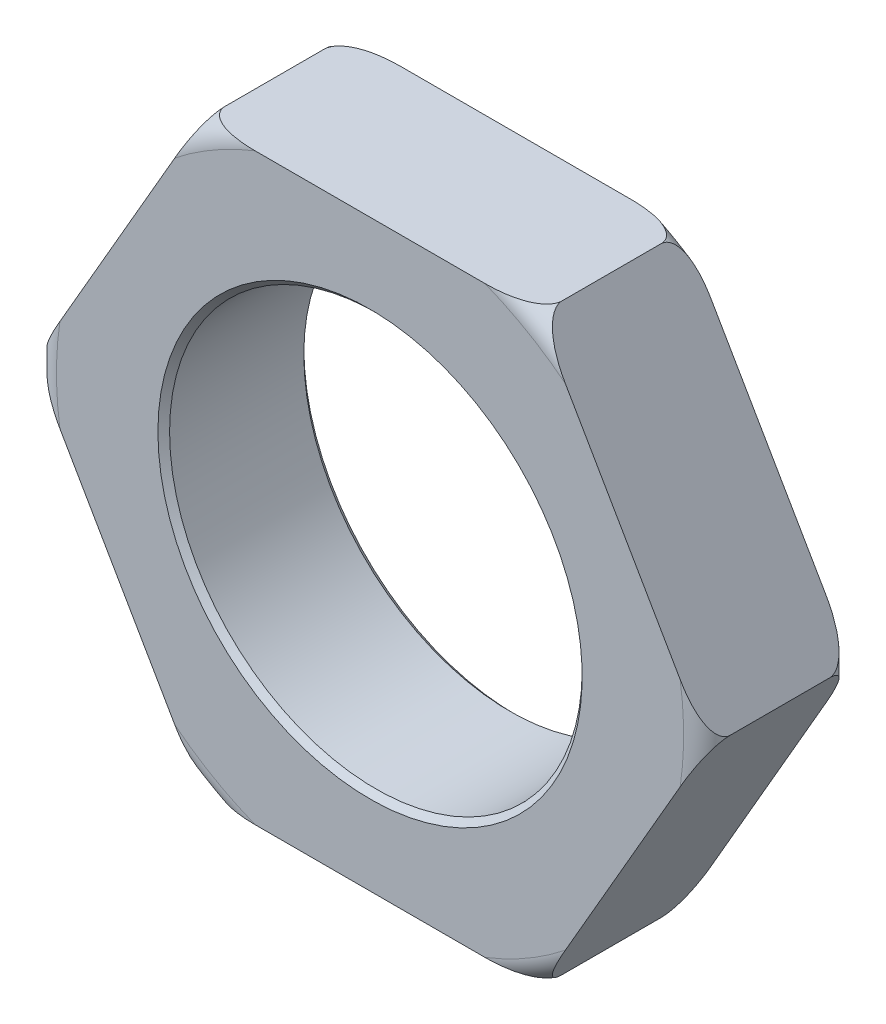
ISO-10303-21;
HEADER;
FILE_DESCRIPTION(('STEP AP214'),'2;1');
FILE_NAME('part.step','',(''),(''),'','','');
FILE_SCHEMA(('AUTOMOTIVE_DESIGN { 1 0 10303 214 1 1 1 1 }'));
ENDSEC;
DATA;
#1=APPLICATION_CONTEXT('core data for automotive mechanical design processes');
#2=APPLICATION_PROTOCOL_DEFINITION('international standard','automotive_design',2000,#1);
#3=PRODUCT_CONTEXT('',#1,'mechanical');
#4=PRODUCT('Part','Part','',(#3));
#5=PRODUCT_RELATED_PRODUCT_CATEGORY('part','',(#4));
#6=PRODUCT_DEFINITION_FORMATION('','',#4);
#7=PRODUCT_DEFINITION_CONTEXT('part definition',#1,'design');
#8=PRODUCT_DEFINITION('design','',#6,#7);
#9=PRODUCT_DEFINITION_SHAPE('','',#8);
#10=(LENGTH_UNIT() NAMED_UNIT(*) SI_UNIT(.MILLI.,.METRE.));
#11=(NAMED_UNIT(*) PLANE_ANGLE_UNIT() SI_UNIT($,.RADIAN.));
#12=(NAMED_UNIT(*) SI_UNIT($,.STERADIAN.) SOLID_ANGLE_UNIT());
#13=UNCERTAINTY_MEASURE_WITH_UNIT(LENGTH_MEASURE(1.E-05),#10,'distance_accuracy_value','');
#14=(GEOMETRIC_REPRESENTATION_CONTEXT(3) GLOBAL_UNCERTAINTY_ASSIGNED_CONTEXT((#13)) GLOBAL_UNIT_ASSIGNED_CONTEXT((#10,
#11,#12)) REPRESENTATION_CONTEXT('',''));
#15=CARTESIAN_POINT('',(0.,0.,0.));
#16=DIRECTION('',(0.,0.,1.));
#17=DIRECTION('',(1.,0.,0.));
#18=AXIS2_PLACEMENT_3D('',#15,#16,#17);
#19=CARTESIAN_POINT('',(7.33234841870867,-12.7,-6.34999999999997));
#20=DIRECTION('',(0.866025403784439,-0.5,0.));
#21=DIRECTION('',(0.5,0.866025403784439,0.));
#22=AXIS2_PLACEMENT_3D('',#19,#20,#21);
#23=PLANE('',#22);
#24=CARTESIAN_POINT('',(14.6646968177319,-3.40954903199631E-08,-5.33380000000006));
#25=CARTESIAN_POINT('',(14.6647402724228,7.52316370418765E-05,-5.36440168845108));
#26=CARTESIAN_POINT('',(14.6633284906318,-0.00237004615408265,-5.39492179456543));
#27=CARTESIAN_POINT('',(14.6579230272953,-0.0117325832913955,-5.45476516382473));
#28=CARTESIAN_POINT('',(14.6539525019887,-0.0186097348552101,-5.48409667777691));
#29=CARTESIAN_POINT('',(14.6437635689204,-0.0362574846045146,-5.54101497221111));
#30=CARTESIAN_POINT('',(14.6375521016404,-0.0470160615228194,-5.56860683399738));
#31=CARTESIAN_POINT('',(14.6232846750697,-0.0717279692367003,-5.62185751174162));
#32=CARTESIAN_POINT('',(14.615224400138,-0.0856887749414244,-5.6475116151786));
#33=CARTESIAN_POINT('',(14.5914450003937,-0.126875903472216,-5.71409128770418));
#34=CARTESIAN_POINT('',(14.5743339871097,-0.156513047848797,-5.75302437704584));
#35=CARTESIAN_POINT('',(14.5373434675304,-0.220582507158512,-5.82521220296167));
#36=CARTESIAN_POINT('',(14.5174559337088,-0.255028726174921,-5.85844982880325));
#37=CARTESIAN_POINT('',(14.4783233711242,-0.322808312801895,-5.91632122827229));
#38=CARTESIAN_POINT('',(14.4592789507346,-0.355794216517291,-5.9415073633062));
#39=CARTESIAN_POINT('',(14.4201749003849,-0.423524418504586,-5.98852839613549));
#40=CARTESIAN_POINT('',(14.4001144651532,-0.458270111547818,-6.01036057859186));
#41=CARTESIAN_POINT('',(14.338806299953,-0.564458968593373,-6.07153875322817));
#42=CARTESIAN_POINT('',(14.2964692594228,-0.637788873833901,-6.10651453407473));
#43=CARTESIAN_POINT('',(14.208594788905,-0.78999192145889,-6.16864739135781));
#44=CARTESIAN_POINT('',(14.1629969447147,-0.868969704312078,-6.19544569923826));
#45=CARTESIAN_POINT('',(14.0708155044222,-1.02863264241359,-6.24139340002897));
#46=CARTESIAN_POINT('',(14.0242309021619,-1.10931954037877,-6.26053454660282));
#47=CARTESIAN_POINT('',(13.9304410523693,-1.27176832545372,-6.29259123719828));
#48=CARTESIAN_POINT('',(13.8832346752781,-1.35353216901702,-6.30549314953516));
#49=CARTESIAN_POINT('',(13.7885665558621,-1.51750216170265,-6.32606209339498));
#50=CARTESIAN_POINT('',(13.7411049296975,-1.59970810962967,-6.33373133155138));
#51=CARTESIAN_POINT('',(13.6390329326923,-1.7765019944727,-6.34545960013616));
#52=CARTESIAN_POINT('',(13.5844030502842,-1.87112372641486,-6.34881726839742));
#53=CARTESIAN_POINT('',(13.4751184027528,-2.0604102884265,-6.35065639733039));
#54=CARTESIAN_POINT('',(13.4204636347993,-2.15507512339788,-6.34913670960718));
#55=CARTESIAN_POINT('',(13.2565094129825,-2.43905216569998,-6.33840981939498));
#56=CARTESIAN_POINT('',(13.1473105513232,-2.62819014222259,-6.32302711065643));
#57=CARTESIAN_POINT('',(12.9294263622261,-3.00557662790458,-6.28038918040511));
#58=CARTESIAN_POINT('',(12.8207417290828,-3.19382393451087,-6.25312096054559));
#59=CARTESIAN_POINT('',(12.6040510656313,-3.56914317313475,-6.19023505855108));
#60=CARTESIAN_POINT('',(12.4960447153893,-3.75621565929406,-6.15462167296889));
#61=CARTESIAN_POINT('',(12.300611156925,-4.09471651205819,-6.08540067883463));
#62=CARTESIAN_POINT('',(12.2131046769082,-4.24628218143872,-6.0526588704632));
#63=CARTESIAN_POINT('',(12.038201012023,-4.54922421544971,-5.98571810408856));
#64=CARTESIAN_POINT('',(11.9508038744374,-4.7006004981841,-5.95151865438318));
#65=CARTESIAN_POINT('',(11.7760667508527,-5.00325407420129,-5.88434777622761));
#66=CARTESIAN_POINT('',(11.6887269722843,-5.15453100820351,-5.85137413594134));
#67=CARTESIAN_POINT('',(11.5135943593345,-5.45786959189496,-5.79078700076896));
#68=CARTESIAN_POINT('',(11.4258018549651,-5.60993066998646,-5.76317004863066));
#69=CARTESIAN_POINT('',(11.3065109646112,-5.81654855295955,-5.73415475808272));
#70=CARTESIAN_POINT('',(11.2753508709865,-5.87051941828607,-5.72735531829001));
#71=CARTESIAN_POINT('',(11.2129369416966,-5.97862351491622,-5.71565449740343));
#72=CARTESIAN_POINT('',(11.1816830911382,-6.03275677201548,-5.71075343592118));
#73=CARTESIAN_POINT('',(11.0879665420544,-6.19507859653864,-5.69942681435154));
#74=CARTESIAN_POINT('',(11.0253885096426,-6.30346692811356,-5.69633532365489));
#75=CARTESIAN_POINT('',(10.902321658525,-6.51662496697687,-5.69992061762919));
#76=CARTESIAN_POINT('',(10.8418302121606,-6.62139922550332,-5.7062872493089));
#77=CARTESIAN_POINT('',(10.7211519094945,-6.83042017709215,-5.72655416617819));
#78=CARTESIAN_POINT('',(10.660965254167,-6.93466652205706,-5.74045889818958));
#79=CARTESIAN_POINT('',(10.5407743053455,-7.14284335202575,-5.77326942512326));
#80=CARTESIAN_POINT('',(10.4807710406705,-7.24677205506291,-5.7921895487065));
#81=CARTESIAN_POINT('',(10.3610195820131,-7.45418766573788,-5.83283032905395));
#82=CARTESIAN_POINT('',(10.3012713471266,-7.55767464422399,-5.85455051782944));
#83=CARTESIAN_POINT('',(10.18111529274,-7.76579103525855,-5.89954676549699));
#84=CARTESIAN_POINT('',(10.1207090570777,-7.87041770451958,-5.92283944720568));
#85=CARTESIAN_POINT('',(9.99991461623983,-8.07963981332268,-5.96961000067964));
#86=CARTESIAN_POINT('',(9.93952641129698,-8.18423525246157,-5.99308787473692));
#87=CARTESIAN_POINT('',(9.75847915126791,-8.4978183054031,-6.06244639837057));
#88=CARTESIAN_POINT('',(9.63772077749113,-8.70697794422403,-6.10733988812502));
#89=CARTESIAN_POINT('',(9.3955661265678,-9.12640210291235,-6.18946162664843));
#90=CARTESIAN_POINT('',(9.27417001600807,-9.33666633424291,-6.22669178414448));
#91=CARTESIAN_POINT('',(9.03034566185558,-9.75898250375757,-6.28902014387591));
#92=CARTESIAN_POINT('',(8.90791608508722,-9.97103675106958,-6.31409898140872));
#93=CARTESIAN_POINT('',(8.72453922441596,-10.2886547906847,-6.33823774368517));
#94=CARTESIAN_POINT('',(8.66381517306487,-10.3938319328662,-6.34404201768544));
#95=CARTESIAN_POINT('',(8.54230310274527,-10.6042970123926,-6.35040164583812));
#96=CARTESIAN_POINT('',(8.48151510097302,-10.7095849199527,-6.3509581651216));
#97=CARTESIAN_POINT('',(8.36013741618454,-10.9198172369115,-6.34575086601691));
#98=CARTESIAN_POINT('',(8.29954759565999,-11.0247618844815,-6.34000134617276));
#99=CARTESIAN_POINT('',(8.17868587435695,-11.2341005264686,-6.3208047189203));
#100=CARTESIAN_POINT('',(8.11841378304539,-11.3384948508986,-6.30736292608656));
#101=CARTESIAN_POINT('',(8.03671982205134,-11.4799929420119,-6.28245571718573));
#102=CARTESIAN_POINT('',(8.01497412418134,-11.5176575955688,-6.27517251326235));
#103=CARTESIAN_POINT('',(7.97161147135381,-11.592763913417,-6.25920008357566));
#104=CARTESIAN_POINT('',(7.94999452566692,-11.6302055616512,-6.25051075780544));
#105=CARTESIAN_POINT('',(7.88515828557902,-11.7425052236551,-6.22203304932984));
#106=CARTESIAN_POINT('',(7.84218152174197,-11.8169431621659,-6.19990136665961));
#107=CARTESIAN_POINT('',(7.77056770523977,-11.9409819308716,-6.15604503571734));
#108=CARTESIAN_POINT('',(7.74162307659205,-11.9911154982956,-6.13632934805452));
#109=CARTESIAN_POINT('',(7.68451400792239,-12.0900313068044,-6.092586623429));
#110=CARTESIAN_POINT('',(7.65635031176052,-12.1388122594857,-6.06855562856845));
#111=CARTESIAN_POINT('',(7.60144496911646,-12.2339111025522,-6.01557459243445));
#112=CARTESIAN_POINT('',(7.57469433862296,-12.2802445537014,-5.98666228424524));
#113=CARTESIAN_POINT('',(7.52308426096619,-12.3696358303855,-5.92281274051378));
#114=CARTESIAN_POINT('',(7.49822031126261,-12.412701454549,-5.88789054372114));
#115=CARTESIAN_POINT('',(7.45960291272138,-12.4795887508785,-5.82420960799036));
#116=CARTESIAN_POINT('',(7.44499469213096,-12.5048909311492,-5.79753683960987));
#117=CARTESIAN_POINT('',(7.41750728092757,-12.5525005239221,-5.74072681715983));
#118=CARTESIAN_POINT('',(7.4046297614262,-12.574805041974,-5.71058626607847));
#119=CARTESIAN_POINT('',(7.38114281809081,-12.6154856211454,-5.64626418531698));
#120=CARTESIAN_POINT('',(7.37056605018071,-12.6338051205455,-5.61203397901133));
#121=CARTESIAN_POINT('',(7.35285635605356,-12.6644792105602,-5.54023312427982));
#122=CARTESIAN_POINT('',(7.34570840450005,-12.6768598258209,-5.50267792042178));
#123=CARTESIAN_POINT('',(7.3379697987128,-12.6902634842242,-5.44283427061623));
#124=CARTESIAN_POINT('',(7.33587567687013,-12.6938906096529,-5.42130393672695));
#125=CARTESIAN_POINT('',(7.33305537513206,-12.6987755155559,-5.37779238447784));
#126=CARTESIAN_POINT('',(7.33233535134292,-12.7000226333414,-5.35580958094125));
#127=CARTESIAN_POINT('',(7.3323484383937,-12.6999999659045,-5.33379999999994));
#128=B_SPLINE_CURVE_WITH_KNOTS('',3,(#24,#25,#26,#27,#28,#29,#30,#31,#32,#33,#34,#35,#36,#37,
#38,#39,#40,#41,#42,#43,#44,#45,#46,#47,#48,#49,#50,#51,#52,#53,#54,#55,#56,#57,#58,#59,#60,#61,
#62,#63,#64,#65,#66,#67,#68,#69,#70,#71,#72,#73,#74,#75,#76,#77,#78,#79,#80,#81,#82,#83,#84,#85,
#86,#87,#88,#89,#90,#91,#92,#93,#94,#95,#96,#97,#98,#99,#100,#101,#102,#103,#104,#105,#106,#107,
#108,#109,#110,#111,#112,#113,#114,#115,#116,#117,#118,#119,#120,#121,#122,#123,#124,#125,#126,
#127),.UNSPECIFIED.,.F.,.F.,(4,2,2,2,2,2,2,2,2,2,2,2,2,2,2,2,2,2,2,2,2,2,2,2,2,2,2,2,2,2,2,2,2,
2,2,2,2,2,2,2,2,2,2,2,2,2,2,2,2,2,2,4),(0.,0.0915425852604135,0.182268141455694,
0.272715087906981,0.363375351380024,0.517986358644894,0.67305401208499,0.809842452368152,
0.94674105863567,1.22080919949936,1.50558264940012,1.79066196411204,2.07636134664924,
2.36194017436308,2.68973922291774,3.01761545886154,3.6739099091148,4.33092391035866,
4.9876003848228,5.52173894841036,6.05605914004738,6.58936312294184,7.12232175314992,
7.31036453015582,7.49843895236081,7.873619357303,8.23676521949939,8.60012553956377,
8.96453535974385,9.3288843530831,9.6979946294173,10.0671094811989,10.8040126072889,
11.5407319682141,12.2786215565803,12.6432940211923,13.0078855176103,13.3716520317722,
13.7351675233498,13.867438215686,13.9997183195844,14.2656579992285,14.4489910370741,
14.63249309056,14.814636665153,14.9963309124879,15.1147791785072,15.2333410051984,
15.3534893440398,15.4731062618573,15.5387460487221,15.6046792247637),.UNSPECIFIED.);
#129=CARTESIAN_POINT('',(14.664696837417,0.,-5.33400000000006));
#130=VERTEX_POINT('',#129);
#131=CARTESIAN_POINT('',(13.4983688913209,-2.02013926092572,-6.34999999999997));
#132=VERTEX_POINT('',#131);
#133=EDGE_CURVE('E260',#130,#132,#128,.T.);
#134=ORIENTED_EDGE('',*,*,#133,.F.);
#135=DIRECTION('',(0.,0.,1.));
#136=VECTOR('',#135,1.);
#137=CARTESIAN_POINT('',(14.664696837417,0.,-6.34999999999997));
#138=LINE('',#137,#136);
#139=CARTESIAN_POINT('',(14.664696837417,0.,-1.01600000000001));
#140=VERTEX_POINT('',#139);
#141=EDGE_CURVE('E194',#130,#140,#138,.T.);
#142=ORIENTED_EDGE('',*,*,#141,.T.);
#143=CARTESIAN_POINT('',(7.3323484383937,-12.6999999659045,-1.01620000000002));
#144=CARTESIAN_POINT('',(7.3323049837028,-12.700075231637,-0.985598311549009));
#145=CARTESIAN_POINT('',(7.33371676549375,-12.6976299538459,-0.955078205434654));
#146=CARTESIAN_POINT('',(7.33912222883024,-12.6882674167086,-0.895234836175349));
#147=CARTESIAN_POINT('',(7.34309275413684,-12.6813902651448,-0.865903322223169));
#148=CARTESIAN_POINT('',(7.35328168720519,-12.6637425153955,-0.808985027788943));
#149=CARTESIAN_POINT('',(7.3594931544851,-12.6529839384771,-0.781393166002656));
#150=CARTESIAN_POINT('',(7.37376058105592,-12.6282720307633,-0.728142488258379));
#151=CARTESIAN_POINT('',(7.38182085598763,-12.6143112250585,-0.702488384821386));
#152=CARTESIAN_POINT('',(7.40560025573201,-12.5731240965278,-0.635908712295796));
#153=CARTESIAN_POINT('',(7.42271126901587,-12.5434869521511,-0.59697562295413));
#154=CARTESIAN_POINT('',(7.45970178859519,-12.4794174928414,-0.524787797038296));
#155=CARTESIAN_POINT('',(7.47958932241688,-12.4449712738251,-0.491550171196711));
#156=CARTESIAN_POINT('',(7.51872188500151,-12.3771916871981,-0.433678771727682));
#157=CARTESIAN_POINT('',(7.53776630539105,-12.3442057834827,-0.408492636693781));
#158=CARTESIAN_POINT('',(7.57687035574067,-12.2764755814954,-0.361471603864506));
#159=CARTESIAN_POINT('',(7.59693079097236,-12.2417298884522,-0.339639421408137));
#160=CARTESIAN_POINT('',(7.65823895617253,-12.1355410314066,-0.278461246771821));
#161=CARTESIAN_POINT('',(7.70057599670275,-12.0622111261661,-0.243485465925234));
#162=CARTESIAN_POINT('',(7.78845046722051,-11.9100080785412,-0.18135260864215));
#163=CARTESIAN_POINT('',(7.83404831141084,-11.8310302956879,-0.154554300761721));
#164=CARTESIAN_POINT('',(7.92622975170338,-11.6713673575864,-0.108606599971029));
#165=CARTESIAN_POINT('',(7.97281435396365,-11.5906804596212,-0.0894654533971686));
#166=CARTESIAN_POINT('',(8.0666042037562,-11.4282316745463,-0.0574087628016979));
#167=CARTESIAN_POINT('',(8.11381058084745,-11.346467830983,-0.0445068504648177));
#168=CARTESIAN_POINT('',(8.20847870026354,-11.1824978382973,-0.0239379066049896));
#169=CARTESIAN_POINT('',(8.25594032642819,-11.1002918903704,-0.0162686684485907));
#170=CARTESIAN_POINT('',(8.3580123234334,-10.9234980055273,-0.00454039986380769));
#171=CARTESIAN_POINT('',(8.4126422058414,-10.8288762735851,-0.00118273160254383));
#172=CARTESIAN_POINT('',(8.5219268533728,-10.6395897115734,0.000656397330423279));
#173=CARTESIAN_POINT('',(8.57658162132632,-10.5449248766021,-0.000863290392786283));
#174=CARTESIAN_POINT('',(8.74053584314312,-10.2609478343,-0.0115901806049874));
#175=CARTESIAN_POINT('',(8.84973470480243,-10.0718098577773,-0.0269728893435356));
#176=CARTESIAN_POINT('',(9.06761889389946,-9.69442337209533,-0.0696108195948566));
#177=CARTESIAN_POINT('',(9.17630352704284,-9.50617606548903,-0.0968790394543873));
#178=CARTESIAN_POINT('',(9.39299419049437,-9.13085682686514,-0.159764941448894));
#179=CARTESIAN_POINT('',(9.5010005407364,-8.94378434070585,-0.195378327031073));
#180=CARTESIAN_POINT('',(9.6964340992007,-8.60528348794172,-0.264599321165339));
#181=CARTESIAN_POINT('',(9.78394057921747,-8.45371781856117,-0.297341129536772));
#182=CARTESIAN_POINT('',(9.95884424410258,-8.15077578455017,-0.364281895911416));
#183=CARTESIAN_POINT('',(10.0462413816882,-7.9993995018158,-0.398481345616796));
#184=CARTESIAN_POINT('',(10.2209785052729,-7.6967459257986,-0.465652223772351));
#185=CARTESIAN_POINT('',(10.3083182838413,-7.54546899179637,-0.498625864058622));
#186=CARTESIAN_POINT('',(10.4834508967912,-7.24213040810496,-0.559212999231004));
#187=CARTESIAN_POINT('',(10.5712434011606,-7.09006933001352,-0.586829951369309));
#188=CARTESIAN_POINT('',(10.6905342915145,-6.88345144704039,-0.61584524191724));
#189=CARTESIAN_POINT('',(10.7216943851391,-6.82948058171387,-0.622644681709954));
#190=CARTESIAN_POINT('',(10.784108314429,-6.72137648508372,-0.634345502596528));
#191=CARTESIAN_POINT('',(10.8153621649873,-6.66724322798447,-0.639246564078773));
#192=CARTESIAN_POINT('',(10.9090787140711,-6.50492140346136,-0.650573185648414));
#193=CARTESIAN_POINT('',(10.9716567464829,-6.39653307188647,-0.653664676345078));
#194=CARTESIAN_POINT('',(11.0947235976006,-6.18337503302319,-0.650079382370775));
#195=CARTESIAN_POINT('',(11.155215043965,-6.07860077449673,-0.643712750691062));
#196=CARTESIAN_POINT('',(11.275893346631,-5.86957982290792,-0.623445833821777));
#197=CARTESIAN_POINT('',(11.3360800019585,-5.76533347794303,-0.609541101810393));
#198=CARTESIAN_POINT('',(11.45627095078,-5.55715664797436,-0.576730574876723));
#199=CARTESIAN_POINT('',(11.516274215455,-5.45322794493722,-0.557810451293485));
#200=CARTESIAN_POINT('',(11.6360256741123,-5.24581233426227,-0.517169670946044));
#201=CARTESIAN_POINT('',(11.6957739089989,-5.14232535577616,-0.495449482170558));
#202=CARTESIAN_POINT('',(11.8159299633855,-4.93420896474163,-0.450453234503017));
#203=CARTESIAN_POINT('',(11.8763361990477,-4.82958229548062,-0.427160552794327));
#204=CARTESIAN_POINT('',(11.9971306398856,-4.62036018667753,-0.380389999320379));
#205=CARTESIAN_POINT('',(12.0575188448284,-4.51576474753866,-0.356912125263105));
#206=CARTESIAN_POINT('',(12.2385661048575,-4.20218169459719,-0.287553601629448));
#207=CARTESIAN_POINT('',(12.3593244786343,-3.99302205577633,-0.242660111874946));
#208=CARTESIAN_POINT('',(12.6014791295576,-3.57359789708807,-0.160538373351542));
#209=CARTESIAN_POINT('',(12.7228752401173,-3.36333366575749,-0.123308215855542));
#210=CARTESIAN_POINT('',(12.9666995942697,-2.94101749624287,-0.0609798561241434));
#211=CARTESIAN_POINT('',(13.089129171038,-2.72896324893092,-0.0359010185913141));
#212=CARTESIAN_POINT('',(13.2725060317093,-2.41134520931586,-0.0117622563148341));
#213=CARTESIAN_POINT('',(13.3332300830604,-2.30616806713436,-0.00595798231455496));
#214=CARTESIAN_POINT('',(13.4547421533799,-2.09570298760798,0.000401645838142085));
#215=CARTESIAN_POINT('',(13.5155301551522,-1.99041508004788,0.000958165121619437));
#216=CARTESIAN_POINT('',(13.6369078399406,-1.78018276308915,-0.00424913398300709));
#217=CARTESIAN_POINT('',(13.6974976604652,-1.67523811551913,-0.00999865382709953));
#218=CARTESIAN_POINT('',(13.8183593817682,-1.46589947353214,-0.0291952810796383));
#219=CARTESIAN_POINT('',(13.8786314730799,-1.3615051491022,-0.0426370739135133));
#220=CARTESIAN_POINT('',(13.9603254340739,-1.22000705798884,-0.0675442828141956));
#221=CARTESIAN_POINT('',(13.9820711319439,-1.18234240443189,-0.074827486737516));
#222=CARTESIAN_POINT('',(14.0254337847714,-1.10723608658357,-0.0907999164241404));
#223=CARTESIAN_POINT('',(14.0470507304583,-1.06979443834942,-0.099489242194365));
#224=CARTESIAN_POINT('',(14.1118869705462,-0.957494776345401,-0.127966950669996));
#225=CARTESIAN_POINT('',(14.1548637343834,-0.883056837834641,-0.15009863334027));
#226=CARTESIAN_POINT('',(14.2264775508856,-0.759018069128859,-0.193954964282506));
#227=CARTESIAN_POINT('',(14.2554221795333,-0.708884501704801,-0.213670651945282));
#228=CARTESIAN_POINT('',(14.312531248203,-0.609968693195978,-0.257413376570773));
#229=CARTESIAN_POINT('',(14.3406949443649,-0.561187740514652,-0.281444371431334));
#230=CARTESIAN_POINT('',(14.3956002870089,-0.466088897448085,-0.334425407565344));
#231=CARTESIAN_POINT('',(14.4223509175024,-0.419755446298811,-0.363337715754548));
#232=CARTESIAN_POINT('',(14.4739609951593,-0.330364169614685,-0.427187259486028));
#233=CARTESIAN_POINT('',(14.4988249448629,-0.287298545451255,-0.462109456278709));
#234=CARTESIAN_POINT('',(14.5374423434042,-0.220411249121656,-0.525790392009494));
#235=CARTESIAN_POINT('',(14.5520505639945,-0.195109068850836,-0.552463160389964));
#236=CARTESIAN_POINT('',(14.5795379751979,-0.147499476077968,-0.609273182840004));
#237=CARTESIAN_POINT('',(14.5924154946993,-0.125194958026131,-0.639413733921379));
#238=CARTESIAN_POINT('',(14.6159024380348,-0.0845143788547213,-0.703735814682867));
#239=CARTESIAN_POINT('',(14.6264792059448,-0.0661948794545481,-0.737966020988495));
#240=CARTESIAN_POINT('',(14.644188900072,-0.0355207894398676,-0.809766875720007));
#241=CARTESIAN_POINT('',(14.6513368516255,-0.0231401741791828,-0.847322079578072));
#242=CARTESIAN_POINT('',(14.6590754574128,-0.00973651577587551,-0.907165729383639));
#243=CARTESIAN_POINT('',(14.6611695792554,-0.00610939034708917,-0.928696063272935));
#244=CARTESIAN_POINT('',(14.6639898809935,-0.00122448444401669,-0.972207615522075));
#245=CARTESIAN_POINT('',(14.6647099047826,2.26333414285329E-05,-0.994190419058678));
#246=CARTESIAN_POINT('',(14.6646968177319,-3.40955180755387E-08,-1.01620000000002));
#247=B_SPLINE_CURVE_WITH_KNOTS('',3,(#143,#144,#145,#146,#147,#148,#149,#150,#151,#152,#153,
#154,#155,#156,#157,#158,#159,#160,#161,#162,#163,#164,#165,#166,#167,#168,#169,#170,#171,#172,
#173,#174,#175,#176,#177,#178,#179,#180,#181,#182,#183,#184,#185,#186,#187,#188,#189,#190,#191,
#192,#193,#194,#195,#196,#197,#198,#199,#200,#201,#202,#203,#204,#205,#206,#207,#208,#209,#210,
#211,#212,#213,#214,#215,#216,#217,#218,#219,#220,#221,#222,#223,#224,#225,#226,#227,#228,#229,
#230,#231,#232,#233,#234,#235,#236,#237,#238,#239,#240,#241,#242,#243,#244,#245,#246),
.UNSPECIFIED.,.F.,.F.,(4,2,2,2,2,2,2,2,2,2,2,2,2,2,2,2,2,2,2,2,2,2,2,2,2,2,2,2,2,2,2,2,2,2,2,2,
2,2,2,2,2,2,2,2,2,2,2,2,2,2,2,4),(0.,0.0915425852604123,0.182268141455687,0.272715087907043,
0.363375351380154,0.517986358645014,0.673054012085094,0.80984245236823,0.946741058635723,
1.22080919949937,1.50558264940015,1.79066196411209,2.07636134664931,2.36194017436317,
2.68973922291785,3.01761545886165,3.67390990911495,4.33092391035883,4.98760038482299,
5.52173894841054,6.05605914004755,6.589363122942,7.12232175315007,7.31036453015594,
7.49843895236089,7.87361935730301,8.23676521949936,8.6001255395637,8.96453535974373,
9.32888435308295,9.6979946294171,10.0671094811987,10.8040126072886,11.5407319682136,
12.2786215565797,12.6432940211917,13.0078855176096,13.3716520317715,13.7351675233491,
13.8674382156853,13.9997183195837,14.265657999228,14.4489910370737,14.6324930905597,
14.8146366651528,14.9963309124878,15.1147791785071,15.2333410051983,15.3534893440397,
15.4731062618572,15.5387460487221,15.6046792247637),.UNSPECIFIED.);
#248=CARTESIAN_POINT('',(13.4983688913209,-2.02013926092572,0.));
#249=VERTEX_POINT('',#248);
#250=EDGE_CURVE('E282',#249,#140,#247,.T.);
#251=ORIENTED_EDGE('',*,*,#250,.F.);
#252=DIRECTION('',(0.5,0.866025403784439,0.));
#253=VECTOR('',#252,1.);
#254=CARTESIAN_POINT('',(7.33234841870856,-12.7,0.));
#255=LINE('',#254,#253);
#256=CARTESIAN_POINT('',(8.49867636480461,-10.6798607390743,0.));
#257=VERTEX_POINT('',#256);
#258=EDGE_CURVE('E383',#257,#249,#255,.T.);
#259=ORIENTED_EDGE('',*,*,#258,.F.);
#260=CARTESIAN_POINT('',(7.33234841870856,-12.7,-1.01600000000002));
#261=VERTEX_POINT('',#260);
#262=EDGE_CURVE('E287',#261,#257,#247,.T.);
#263=ORIENTED_EDGE('',*,*,#262,.F.);
#264=DIRECTION('',(0.,0.,1.));
#265=VECTOR('',#264,1.);
#266=CARTESIAN_POINT('',(7.33234841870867,-12.7,-6.34999999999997));
#267=LINE('',#266,#265);
#268=CARTESIAN_POINT('',(7.33234841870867,-12.7,-5.33399999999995));
#269=VERTEX_POINT('',#268);
#270=EDGE_CURVE('E195',#269,#261,#267,.T.);
#271=ORIENTED_EDGE('',*,*,#270,.F.);
#272=CARTESIAN_POINT('',(8.49867636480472,-10.6798607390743,-6.34999999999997));
#273=VERTEX_POINT('',#272);
#274=EDGE_CURVE('E270',#273,#269,#128,.T.);
#275=ORIENTED_EDGE('',*,*,#274,.F.);
#276=DIRECTION('',(0.5,0.866025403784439,0.));
#277=VECTOR('',#276,1.);
#278=CARTESIAN_POINT('',(7.33234841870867,-12.7,-6.34999999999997));
#279=LINE('',#278,#277);
#280=EDGE_CURVE('E265',#273,#132,#279,.T.);
#281=ORIENTED_EDGE('',*,*,#280,.T.);
#282=EDGE_LOOP('',(#134,#142,#251,#259,#263,#271,#275,#281));
#283=FACE_BOUND('',#282,.T.);
#284=ADVANCED_FACE('F32',(#283),#23,.T.);
#285=CARTESIAN_POINT('',(-7.33234841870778,-12.7,-6.35000000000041));
#286=DIRECTION('',(0.,-1.,0.));
#287=DIRECTION('',(0.,0.,-1.));
#288=AXIS2_PLACEMENT_3D('',#285,#286,#287);
#289=PLANE('',#288);
#290=CARTESIAN_POINT('',(4.44089209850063E-13,-12.7,-5.69763485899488));
#291=CARTESIAN_POINT('',(-0.0849086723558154,-12.7,-5.69763273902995));
#292=CARTESIAN_POINT('',(-0.169815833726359,-12.7,-5.69988119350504));
#293=CARTESIAN_POINT('',(-0.339419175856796,-12.7,-5.70856773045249));
#294=CARTESIAN_POINT('',(-0.424115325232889,-12.7,-5.7150064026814));
#295=CARTESIAN_POINT('',(-0.678032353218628,-12.7,-5.73949843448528));
#296=CARTESIAN_POINT('',(-0.846734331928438,-12.7,-5.76272255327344));
#297=CARTESIAN_POINT('',(-1.18518234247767,-12.7,-5.81646328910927));
#298=CARTESIAN_POINT('',(-1.35491181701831,-12.7,-5.84707394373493));
#299=CARTESIAN_POINT('',(-1.69374683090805,-12.7,-5.91064811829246));
#300=CARTESIAN_POINT('',(-1.86285282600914,-12.7000000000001,-5.94360924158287));
#301=CARTESIAN_POINT('',(-2.17438164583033,-12.7000000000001,-6.00393162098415));
#302=CARTESIAN_POINT('',(-2.31679246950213,-12.7,-6.03135366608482));
#303=CARTESIAN_POINT('',(-2.60188958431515,-12.7,-6.08471190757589));
#304=CARTESIAN_POINT('',(-2.74457587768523,-12.7,-6.11064809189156));
#305=CARTESIAN_POINT('',(-3.17363597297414,-12.7,-6.18479561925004));
#306=CARTESIAN_POINT('',(-3.46070794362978,-12.7,-6.2292826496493));
#307=CARTESIAN_POINT('',(-3.89145597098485,-12.7,-6.28258652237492));
#308=CARTESIAN_POINT('',(-4.03429758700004,-12.7,-6.29806904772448));
#309=CARTESIAN_POINT('',(-4.32045418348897,-12.7,-6.32363634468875));
#310=CARTESIAN_POINT('',(-4.46376907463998,-12.7,-6.33372208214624));
#311=CARTESIAN_POINT('',(-4.75047164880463,-12.7,-6.34720864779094));
#312=CARTESIAN_POINT('',(-4.89385874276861,-12.7,-6.35062140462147));
#313=CARTESIAN_POINT('',(-5.18056839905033,-12.7,-6.34919144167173));
#314=CARTESIAN_POINT('',(-5.32389095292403,-12.7,-6.34435331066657));
#315=CARTESIAN_POINT('',(-5.53608347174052,-12.7,-6.32942092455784));
#316=CARTESIAN_POINT('',(-5.60524014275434,-12.7,-6.32332287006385));
#317=CARTESIAN_POINT('',(-5.74326874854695,-12.7,-6.30834130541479));
#318=CARTESIAN_POINT('',(-5.81214063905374,-12.7,-6.29945737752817));
#319=CARTESIAN_POINT('',(-5.94959133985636,-12.7,-6.27848458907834));
#320=CARTESIAN_POINT('',(-6.01816885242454,-12.7,-6.26638711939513));
#321=CARTESIAN_POINT('',(-6.15456898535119,-12.7,-6.2385062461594));
#322=CARTESIAN_POINT('',(-6.22239177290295,-12.7,-6.22272367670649));
#323=CARTESIAN_POINT('',(-6.34291380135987,-12.7,-6.19056996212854));
#324=CARTESIAN_POINT('',(-6.39582656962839,-12.7,-6.17500290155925));
#325=CARTESIAN_POINT('',(-6.50063326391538,-12.7,-6.14076342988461));
#326=CARTESIAN_POINT('',(-6.55252747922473,-12.7,-6.12209191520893));
#327=CARTESIAN_POINT('',(-6.654699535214,-12.7,-6.08122164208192));
#328=CARTESIAN_POINT('',(-6.70498267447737,-12.7,-6.05903627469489));
#329=CARTESIAN_POINT('',(-6.80346693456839,-12.7,-6.01049004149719));
#330=CARTESIAN_POINT('',(-6.8516700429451,-12.7,-5.98413327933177));
#331=CARTESIAN_POINT('',(-6.93860215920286,-12.7,-5.93044460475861));
#332=CARTESIAN_POINT('',(-6.97772036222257,-12.7,-5.90374974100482));
#333=CARTESIAN_POINT('',(-7.05278691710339,-12.7,-5.84603970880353));
#334=CARTESIAN_POINT('',(-7.08873040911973,-12.7,-5.81501809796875));
#335=CARTESIAN_POINT('',(-7.15632491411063,-12.7,-5.74764255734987));
#336=CARTESIAN_POINT('',(-7.18791005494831,-12.7,-5.71122112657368));
#337=CARTESIAN_POINT('',(-7.24368376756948,-12.7,-5.63309880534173));
#338=CARTESIAN_POINT('',(-7.26790184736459,-12.7,-5.59141994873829));
#339=CARTESIAN_POINT('',(-7.2987955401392,-12.7,-5.51989271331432));
#340=CARTESIAN_POINT('',(-7.30864544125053,-12.7,-5.49141565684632));
#341=CARTESIAN_POINT('',(-7.32348262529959,-12.7,-5.43321610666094));
#342=CARTESIAN_POINT('',(-7.32847422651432,-12.7,-5.4034947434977));
#343=CARTESIAN_POINT('',(-7.33314810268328,-12.7,-5.34352775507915));
#344=CARTESIAN_POINT('',(-7.33281225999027,-12.7,-5.31328069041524));
#345=CARTESIAN_POINT('',(-7.32682053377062,-12.7,-5.25331715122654));
#346=CARTESIAN_POINT('',(-7.32116249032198,-12.7,-5.2236008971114));
#347=CARTESIAN_POINT('',(-7.3053429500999,-12.7,-5.16661103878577));
#348=CARTESIAN_POINT('',(-7.29535674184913,-12.7,-5.13928769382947));
#349=CARTESIAN_POINT('',(-7.27162416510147,-12.7,-5.08634749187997));
#350=CARTESIAN_POINT('',(-7.25787643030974,-12.7,-5.06073125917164));
#351=CARTESIAN_POINT('',(-7.21792154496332,-12.7,-4.99619959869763));
#352=CARTESIAN_POINT('',(-7.18925517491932,-12.7,-4.95880851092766));
#353=CARTESIAN_POINT('',(-7.12646862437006,-12.7,-4.88891947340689));
#354=CARTESIAN_POINT('',(-7.09233203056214,-12.7,-4.85643684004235));
#355=CARTESIAN_POINT('',(-6.9951859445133,-12.7,-4.77466076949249));
#356=CARTESIAN_POINT('',(-6.92870213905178,-12.7,-4.72953108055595));
#357=CARTESIAN_POINT('',(-6.79005322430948,-12.7,-4.64925750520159));
#358=CARTESIAN_POINT('',(-6.71787487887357,-12.7,-4.61413781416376));
#359=CARTESIAN_POINT('',(-6.56966803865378,-12.7,-4.55155337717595));
#360=CARTESIAN_POINT('',(-6.49361396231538,-12.7,-4.52415030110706));
#361=CARTESIAN_POINT('',(-6.33945033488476,-12.7,-4.4757867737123));
#362=CARTESIAN_POINT('',(-6.26133874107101,-12.7,-4.45483300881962));
#363=CARTESIAN_POINT('',(-6.10377721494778,-12.7,-4.41823489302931));
#364=CARTESIAN_POINT('',(-6.02432541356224,-12.7,-4.40259873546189));
#365=CARTESIAN_POINT('',(-5.86472199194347,-12.7,-4.37583941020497));
#366=CARTESIAN_POINT('',(-5.78457072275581,-12.7,-4.36471409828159));
#367=CARTESIAN_POINT('',(-5.5818472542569,-12.7,-4.34149225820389));
#368=CARTESIAN_POINT('',(-5.45898656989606,-12.7,-4.33192417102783));
#369=CARTESIAN_POINT('',(-5.21289491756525,-12.7,-4.31994426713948));
#370=CARTESIAN_POINT('',(-5.08966379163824,-12.7,-4.31753613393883));
#371=CARTESIAN_POINT('',(-4.84300329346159,-12.7,-4.31860999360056));
#372=CARTESIAN_POINT('',(-4.71957399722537,-12.7,-4.32210335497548));
#373=CARTESIAN_POINT('',(-4.4729441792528,-12.7,-4.33400079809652));
#374=CARTESIAN_POINT('',(-4.34974370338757,-12.7,-4.34240577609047));
#375=CARTESIAN_POINT('',(-3.97855979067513,-12.7,-4.37391120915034));
#376=CARTESIAN_POINT('',(-3.73111031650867,-12.7,-4.40326353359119));
#377=CARTESIAN_POINT('',(-3.23827062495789,-12.7,-4.4730562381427));
#378=CARTESIAN_POINT('',(-2.9928778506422,-12.7,-4.51347970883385));
#379=CARTESIAN_POINT('',(-2.50723244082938,-12.7,-4.60008149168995));
#380=CARTESIAN_POINT('',(-2.26696079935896,-12.7,-4.64615631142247));
#381=CARTESIAN_POINT('',(-1.90641641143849,-12.7,-4.71594806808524));
#382=CARTESIAN_POINT('',(-1.78607773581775,-12.7,-4.7393517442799));
#383=CARTESIAN_POINT('',(-1.54525126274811,-12.7,-4.78537396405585));
#384=CARTESIAN_POINT('',(-1.42476347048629,-12.7,-4.80799253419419));
#385=CARTESIAN_POINT('',(-1.18540170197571,-12.7,-4.85073818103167));
#386=CARTESIAN_POINT('',(-1.06653414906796,-12.7,-4.87090039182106));
#387=CARTESIAN_POINT('',(-0.828174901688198,-12.7,-4.90730284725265));
#388=CARTESIAN_POINT('',(-0.708683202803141,-12.7,-4.92354306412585));
#389=CARTESIAN_POINT('',(-0.469496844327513,-12.7,-4.94959089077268));
#390=CARTESIAN_POINT('',(-0.349805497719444,-12.7,-4.95942701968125));
#391=CARTESIAN_POINT('',(-0.110050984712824,-12.7,-4.97053545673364));
#392=CARTESIAN_POINT('',(0.0100119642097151,-12.7,-4.97181207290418));
#393=CARTESIAN_POINT('',(0.250549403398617,-12.7,-4.96544117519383));
#394=CARTESIAN_POINT('',(0.371022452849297,-12.7,-4.95774383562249));
#395=CARTESIAN_POINT('',(0.611315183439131,-12.7,-4.93526016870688));
#396=CARTESIAN_POINT('',(0.731134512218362,-12.7,-4.92047033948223));
#397=CARTESIAN_POINT('',(0.970683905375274,-12.7,-4.88626166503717));
#398=CARTESIAN_POINT('',(1.09041060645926,-12.7,-4.86682031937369));
#399=CARTESIAN_POINT('',(1.32938779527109,-12.7,-4.82541807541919));
#400=CARTESIAN_POINT('',(1.44863838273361,-12.7,-4.80345773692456));
#401=CARTESIAN_POINT('',(1.68925991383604,-12.7,-4.75802388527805));
#402=CARTESIAN_POINT('',(1.8106267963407,-12.7,-4.73452919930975));
#403=CARTESIAN_POINT('',(2.05334907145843,-12.7,-4.68749717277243));
#404=CARTESIAN_POINT('',(2.17470446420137,-12.7,-4.66395983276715));
#405=CARTESIAN_POINT('',(2.53843781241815,-12.7,-4.59462670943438));
#406=CARTESIAN_POINT('',(2.78104836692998,-12.7,-4.54999448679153));
#407=CARTESIAN_POINT('',(3.26745986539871,-12.7,-4.46885970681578));
#408=CARTESIAN_POINT('',(3.5112596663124,-12.7,-4.43235049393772));
#409=CARTESIAN_POINT('',(4.00100407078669,-12.7,-4.37197208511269));
#410=CARTESIAN_POINT('',(4.24695179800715,-12.7,-4.34812629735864));
#411=CARTESIAN_POINT('',(4.61516985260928,-12.7,-4.32638647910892));
#412=CARTESIAN_POINT('',(4.73702257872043,-12.7,-4.32146584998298));
#413=CARTESIAN_POINT('',(4.98081584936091,-12.7,-4.31708938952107));
#414=CARTESIAN_POINT('',(5.10275636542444,-12.7,-4.3176322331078));
#415=CARTESIAN_POINT('',(5.34613806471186,-12.7,-4.32531179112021));
#416=CARTESIAN_POINT('',(5.4675797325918,-12.7,-4.33243192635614));
#417=CARTESIAN_POINT('',(5.70969332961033,-12.7,-4.35473508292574));
#418=CARTESIAN_POINT('',(5.83036578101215,-12.7,-4.36991186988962));
#419=CARTESIAN_POINT('',(5.99500465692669,-12.7,-4.39775086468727));
#420=CARTESIAN_POINT('',(6.03972086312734,-12.7,-4.4060443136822));
#421=CARTESIAN_POINT('',(6.12883678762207,-12.7,-4.42420904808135));
#422=CARTESIAN_POINT('',(6.17323647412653,-12.7,-4.43408048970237));
#423=CARTESIAN_POINT('',(6.30601107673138,-12.7,-4.46634860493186));
#424=CARTESIAN_POINT('',(6.39376968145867,-12.6999999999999,-4.49136812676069));
#425=CARTESIAN_POINT('',(6.56713089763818,-12.6999999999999,-4.55035924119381));
#426=CARTESIAN_POINT('',(6.65271127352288,-12.7,-4.58439933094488));
#427=CARTESIAN_POINT('',(6.77686306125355,-12.7,-4.64398173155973));
#428=CARTESIAN_POINT('',(6.81749500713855,-12.7,-4.66523059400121));
#429=CARTESIAN_POINT('',(6.89685065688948,-12.7,-4.71100945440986));
#430=CARTESIAN_POINT('',(6.93557594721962,-12.7,-4.73553665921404));
#431=CARTESIAN_POINT('',(7.00728249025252,-12.7,-4.78619351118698));
#432=CARTESIAN_POINT('',(7.04047388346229,-12.7,-4.81202256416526));
#433=CARTESIAN_POINT('',(7.10377616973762,-12.7,-4.86732269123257));
#434=CARTESIAN_POINT('',(7.13388439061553,-12.7,-4.8967968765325));
#435=CARTESIAN_POINT('',(7.19002181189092,-12.7,-4.96009947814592));
#436=CARTESIAN_POINT('',(7.21599902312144,-12.7,-4.99397491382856));
#437=CARTESIAN_POINT('',(7.26148860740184,-12.7,-5.06582743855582));
#438=CARTESIAN_POINT('',(7.28101925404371,-12.7,-5.10379252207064));
#439=CARTESIAN_POINT('',(7.30684772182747,-12.7,-5.17115831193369));
#440=CARTESIAN_POINT('',(7.31535789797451,-12.7,-5.19970897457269));
#441=CARTESIAN_POINT('',(7.32747089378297,-12.7,-5.25783533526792));
#442=CARTESIAN_POINT('',(7.33107780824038,-12.7,-5.28741015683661));
#443=CARTESIAN_POINT('',(7.33305713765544,-12.7,-5.34680119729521));
#444=CARTESIAN_POINT('',(7.33141821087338,-12.7,-5.37661780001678));
#445=CARTESIAN_POINT('',(7.32303801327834,-12.7,-5.43552544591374));
#446=CARTESIAN_POINT('',(7.31629405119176,-12.7,-5.46461609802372));
#447=CARTESIAN_POINT('',(7.2984258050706,-12.7,-5.52087511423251));
#448=CARTESIAN_POINT('',(7.28737382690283,-12.7,-5.54806689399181));
#449=CARTESIAN_POINT('',(7.26162213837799,-12.7,-5.60064127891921));
#450=CARTESIAN_POINT('',(7.24692115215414,-12.7,-5.62602324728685));
#451=CARTESIAN_POINT('',(7.20371636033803,-12.7,-5.69124861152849));
#452=CARTESIAN_POINT('',(7.17257709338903,-12.7,-5.72934369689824));
#453=CARTESIAN_POINT('',(7.10479747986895,-12.7,-5.80030102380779));
#454=CARTESIAN_POINT('',(7.0681397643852,-12.7,-5.83314604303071));
#455=CARTESIAN_POINT('',(6.99636935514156,-12.7,-5.89003715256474));
#456=CARTESIAN_POINT('',(6.96171531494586,-12.7,-5.91467250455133));
#457=CARTESIAN_POINT('',(6.89040678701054,-12.7,-5.9608781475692));
#458=CARTESIAN_POINT('',(6.8537507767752,-12.7,-5.98244605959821));
#459=CARTESIAN_POINT('',(6.74152777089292,-12.7,-6.04317197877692));
#460=CARTESIAN_POINT('',(6.66377956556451,-12.7,-6.07829741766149));
#461=CARTESIAN_POINT('',(6.50336918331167,-12.7,-6.14083483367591));
#462=CARTESIAN_POINT('',(6.42063585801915,-12.7,-6.16805584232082));
#463=CARTESIAN_POINT('',(6.25313285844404,-12.7,-6.21552437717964));
#464=CARTESIAN_POINT('',(6.16836112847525,-12.7,-6.23576451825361));
#465=CARTESIAN_POINT('',(5.99755282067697,-12.7,-6.27052051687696));
#466=CARTESIAN_POINT('',(5.91151457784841,-12.7,-6.28502797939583));
#467=CARTESIAN_POINT('',(5.73882176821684,-12.7,-6.30920856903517));
#468=CARTESIAN_POINT('',(5.65216752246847,-12.7,-6.31888405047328));
#469=CARTESIAN_POINT('',(5.42789219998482,-12.7,-6.33858889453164));
#470=CARTESIAN_POINT('',(5.29000184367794,-12.7,-6.34553782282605));
#471=CARTESIAN_POINT('',(5.01402608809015,-12.7,-6.35131440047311));
#472=CARTESIAN_POINT('',(4.87594062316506,-12.7,-6.35013756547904));
#473=CARTESIAN_POINT('',(4.59973324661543,-12.7,-6.34119681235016));
#474=CARTESIAN_POINT('',(4.46161177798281,-12.7,-6.3334201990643));
#475=CARTESIAN_POINT('',(4.18576815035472,-12.7,-6.31248330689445));
#476=CARTESIAN_POINT('',(4.04804607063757,-12.7,-6.29932202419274));
#477=CARTESIAN_POINT('',(3.63335130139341,-12.7,-6.25305387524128));
#478=CARTESIAN_POINT('',(3.35713192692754,-12.7,-6.21327137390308));
#479=CARTESIAN_POINT('',(2.80692998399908,-12.7,-6.12298605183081));
#480=CARTESIAN_POINT('',(2.53294506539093,-12.7,-6.07249659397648));
#481=CARTESIAN_POINT('',(2.07098016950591,-12.7,-5.98412996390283));
#482=CARTESIAN_POINT('',(1.88280834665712,-12.7,-5.94722613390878));
#483=CARTESIAN_POINT('',(1.60018588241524,-12.7,-5.89308823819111));
#484=CARTESIAN_POINT('',(1.50585603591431,-12.7,-5.87523401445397));
#485=CARTESIAN_POINT('',(1.31700567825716,-12.7,-5.84057067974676));
#486=CARTESIAN_POINT('',(1.22248517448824,-12.7,-5.82376152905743));
#487=CARTESIAN_POINT('',(1.03444826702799,-12.7,-5.79221744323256));
#488=CARTESIAN_POINT('',(0.940936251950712,-12.7,-5.77745684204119));
#489=CARTESIAN_POINT('',(0.753498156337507,-12.7,-5.75075783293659));
#490=CARTESIAN_POINT('',(0.659572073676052,-12.7,-5.73881943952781));
#491=CARTESIAN_POINT('',(0.471513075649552,-12.7,-5.71899616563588));
#492=CARTESIAN_POINT('',(0.377381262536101,-12.7,-5.7111012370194));
#493=CARTESIAN_POINT('',(0.188832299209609,-12.7,-5.70042231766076));
#494=CARTESIAN_POINT('',(0.094415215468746,-12.7,-5.69763721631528));
#495=CARTESIAN_POINT('',(4.44089209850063E-13,-12.7,-5.69763485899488));
#496=B_SPLINE_CURVE_WITH_KNOTS('',3,(#290,#291,#292,#293,#294,#295,#296,#297,#298,#299,#300,
#301,#302,#303,#304,#305,#306,#307,#308,#309,#310,#311,#312,#313,#314,#315,#316,#317,#318,#319,
#320,#321,#322,#323,#324,#325,#326,#327,#328,#329,#330,#331,#332,#333,#334,#335,#336,#337,#338,
#339,#340,#341,#342,#343,#344,#345,#346,#347,#348,#349,#350,#351,#352,#353,#354,#355,#356,#357,
#358,#359,#360,#361,#362,#363,#364,#365,#366,#367,#368,#369,#370,#371,#372,#373,#374,#375,#376,
#377,#378,#379,#380,#381,#382,#383,#384,#385,#386,#387,#388,#389,#390,#391,#392,#393,#394,#395,
#396,#397,#398,#399,#400,#401,#402,#403,#404,#405,#406,#407,#408,#409,#410,#411,#412,#413,#414,
#415,#416,#417,#418,#419,#420,#421,#422,#423,#424,#425,#426,#427,#428,#429,#430,#431,#432,#433,
#434,#435,#436,#437,#438,#439,#440,#441,#442,#443,#444,#445,#446,#447,#448,#449,#450,#451,#452,
#453,#454,#455,#456,#457,#458,#459,#460,#461,#462,#463,#464,#465,#466,#467,#468,#469,#470,#471,
#472,#473,#474,#475,#476,#477,#478,#479,#480,#481,#482,#483,#484,#485,#486,#487,#488,#489,#490,
#491,#492,#493,#494,#495),.UNSPECIFIED.,.T.,.F.,(4,2,2,2,2,2,2,2,2,2,2,2,2,2,2,2,2,2,2,2,2,2,2,
2,2,2,2,2,2,2,2,2,2,2,2,2,2,2,2,2,2,2,2,2,2,2,2,2,2,2,2,2,2,2,2,2,2,2,2,2,2,2,2,2,2,2,2,2,2,2,2,
2,2,2,2,2,2,2,2,2,2,2,2,2,2,2,2,2,2,2,2,2,2,2,2,2,2,2,2,2,2,2,4),(0.,0.254696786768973,
0.509429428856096,1.01993345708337,1.53731561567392,2.05417757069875,2.4892522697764,
2.92433050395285,3.79541555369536,4.2263718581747,4.65725101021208,5.08735921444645,
5.51722828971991,5.72545863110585,5.93372021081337,6.14254545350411,6.35132347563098,
6.51670942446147,6.68204769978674,6.84677040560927,7.01133205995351,7.15317344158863,
7.29522832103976,7.43923793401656,7.58266289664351,7.6726995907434,7.76265618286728,
7.85291876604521,7.94321799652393,8.03015937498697,8.11713237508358,8.25766364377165,
8.39862475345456,8.63833147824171,8.87861278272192,9.12076314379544,9.36316371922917,
9.60593610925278,9.84859296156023,10.2180066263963,10.587610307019,10.9579267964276,
11.3283108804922,12.0754148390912,12.8213840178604,13.5553049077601,13.9230872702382,
14.2908571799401,14.6525204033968,15.0141861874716,15.3742301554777,15.7340928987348,
16.0959632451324,16.4580124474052,16.8218496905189,17.1856062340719,17.5564650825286,
17.927319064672,18.6672957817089,19.4066639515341,20.1473941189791,20.5131558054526,
20.8788287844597,21.2435825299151,21.6080544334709,21.7444671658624,21.8808934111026,
22.154327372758,22.4299002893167,22.5673386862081,22.704660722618,22.8306183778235,
22.9566842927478,23.0842289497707,23.2114088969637,23.3004125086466,23.389341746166,
23.4784633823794,23.5676320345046,23.6553644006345,23.74312748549,23.8898865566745,
24.0371175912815,24.1644875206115,24.2919557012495,24.5471647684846,24.8081059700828,
25.0693223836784,25.3309199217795,25.5923898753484,26.0062527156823,26.4203439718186,
26.835233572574,27.2502005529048,28.0869730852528,28.9227073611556,29.4979790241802,
29.7859903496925,30.0739907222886,30.3579731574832,30.6419570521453,30.9252317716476,
31.2084449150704),.UNSPECIFIED.);
#497=CARTESIAN_POINT('',(-4.99969252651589,-12.7,-6.35000000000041));
#498=VERTEX_POINT('',#497);
#499=CARTESIAN_POINT('',(-7.33234841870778,-12.7,-5.33400000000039));
#500=VERTEX_POINT('',#499);
#501=EDGE_CURVE('E377',#498,#500,#496,.T.);
#502=ORIENTED_EDGE('',*,*,#501,.F.);
#503=DIRECTION('',(1.,0.,0.));
#504=VECTOR('',#503,1.);
#505=CARTESIAN_POINT('',(-7.33234841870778,-12.7,-6.35000000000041));
#506=LINE('',#505,#504);
#507=CARTESIAN_POINT('',(4.99969252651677,-12.7,-6.34999999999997));
#508=VERTEX_POINT('',#507);
#509=EDGE_CURVE('E186',#498,#508,#506,.T.);
#510=ORIENTED_EDGE('',*,*,#509,.T.);
#511=EDGE_CURVE('E382',#269,#508,#496,.T.);
#512=ORIENTED_EDGE('',*,*,#511,.F.);
#513=ORIENTED_EDGE('',*,*,#270,.T.);
#514=CARTESIAN_POINT('',(4.44089209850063E-13,-12.7,-0.652365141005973));
#515=CARTESIAN_POINT('',(0.0849086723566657,-12.7,-0.652367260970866));
#516=CARTESIAN_POINT('',(0.169815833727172,-12.7,-0.650118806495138));
#517=CARTESIAN_POINT('',(0.339419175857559,-12.7,-0.641432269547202));
#518=CARTESIAN_POINT('',(0.42411532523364,-12.7,-0.634993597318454));
#519=CARTESIAN_POINT('',(0.678032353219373,-12.7,-0.610501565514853));
#520=CARTESIAN_POINT('',(0.846734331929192,-12.7,-0.587277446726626));
#521=CARTESIAN_POINT('',(1.1851823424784,-12.7,-0.533536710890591));
#522=CARTESIAN_POINT('',(1.35491181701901,-12.7,-0.502926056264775));
#523=CARTESIAN_POINT('',(1.69374683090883,-12.7,-0.439351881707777));
#524=CARTESIAN_POINT('',(1.86285282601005,-12.7,-0.406390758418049));
#525=CARTESIAN_POINT('',(2.17438164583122,-12.7,-0.346068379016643));
#526=CARTESIAN_POINT('',(2.31679246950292,-12.7,-0.318646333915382));
#527=CARTESIAN_POINT('',(2.60188958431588,-12.7,-0.265288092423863));
#528=CARTESIAN_POINT('',(2.744575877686,-12.7,-0.239351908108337));
#529=CARTESIAN_POINT('',(3.17363597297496,-12.7,-0.165204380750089));
#530=CARTESIAN_POINT('',(3.46070794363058,-12.7,-0.120717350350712));
#531=CARTESIAN_POINT('',(3.89145597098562,-12.7,-0.0674134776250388));
#532=CARTESIAN_POINT('',(4.0342975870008,-12.7,-0.0519309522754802));
#533=CARTESIAN_POINT('',(4.32045418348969,-12.7,-0.0263636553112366));
#534=CARTESIAN_POINT('',(4.46376907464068,-12.7,-0.0162779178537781));
#535=CARTESIAN_POINT('',(4.75047164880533,-12.7,-0.00279135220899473));
#536=CARTESIAN_POINT('',(4.89385874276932,-12.7,0.000621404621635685));
#537=CARTESIAN_POINT('',(5.18056839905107,-12.7,-0.00080855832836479));
#538=CARTESIAN_POINT('',(5.32389095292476,-12.7,-0.00564668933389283));
#539=CARTESIAN_POINT('',(5.53608347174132,-12.7,-0.020579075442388));
#540=CARTESIAN_POINT('',(5.60524014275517,-12.7,-0.0266771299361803));
#541=CARTESIAN_POINT('',(5.74326874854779,-12.7,-0.0416586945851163));
#542=CARTESIAN_POINT('',(5.81214063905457,-12.7,-0.050542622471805));
#543=CARTESIAN_POINT('',(5.94959133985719,-12.7,-0.0715154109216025));
#544=CARTESIAN_POINT('',(6.0181688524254,-12.7,-0.0836128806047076));
#545=CARTESIAN_POINT('',(6.154568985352,-12.7,-0.111493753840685));
#546=CARTESIAN_POINT('',(6.22239177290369,-12.7,-0.127276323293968));
#547=CARTESIAN_POINT('',(6.34291380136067,-12.7,-0.159430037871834));
#548=CARTESIAN_POINT('',(6.39582656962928,-12.7,-0.174997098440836));
#549=CARTESIAN_POINT('',(6.50063326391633,-12.7,-0.209236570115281));
#550=CARTESIAN_POINT('',(6.55252747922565,-12.7,-0.22790808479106));
#551=CARTESIAN_POINT('',(6.65469953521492,-12.7,-0.26877835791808));
#552=CARTESIAN_POINT('',(6.70498267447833,-12.7,-0.290963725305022));
#553=CARTESIAN_POINT('',(6.80346693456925,-12.7,-0.339509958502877));
#554=CARTESIAN_POINT('',(6.85167004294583,-12.7,-0.36586672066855));
#555=CARTESIAN_POINT('',(6.93860215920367,-12.7,-0.41955539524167));
#556=CARTESIAN_POINT('',(6.97772036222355,-12.7,-0.446250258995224));
#557=CARTESIAN_POINT('',(7.05278691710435,-12.7,-0.503960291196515));
#558=CARTESIAN_POINT('',(7.0887304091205,-12.7,-0.534981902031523));
#559=CARTESIAN_POINT('',(7.15632491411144,-12.7,-0.602357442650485));
#560=CARTESIAN_POINT('',(7.18791005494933,-12.7,-0.638778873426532));
#561=CARTESIAN_POINT('',(7.24368376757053,-12.7,-0.716901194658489));
#562=CARTESIAN_POINT('',(7.26790184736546,-12.7,-0.758580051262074));
#563=CARTESIAN_POINT('',(7.2987955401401,-12.7,-0.830107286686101));
#564=CARTESIAN_POINT('',(7.30864544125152,-12.7,-0.858584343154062));
#565=CARTESIAN_POINT('',(7.32348262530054,-12.7,-0.916783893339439));
#566=CARTESIAN_POINT('',(7.32847422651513,-12.7,-0.946505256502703));
#567=CARTESIAN_POINT('',(7.33314810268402,-12.7,-1.00647224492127));
#568=CARTESIAN_POINT('',(7.33281225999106,-12.7,-1.03671930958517));
#569=CARTESIAN_POINT('',(7.32682053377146,-12.7,-1.09668284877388));
#570=CARTESIAN_POINT('',(7.3211624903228,-12.7,-1.12639910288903));
#571=CARTESIAN_POINT('',(7.30534295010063,-12.7,-1.18338896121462));
#572=CARTESIAN_POINT('',(7.2953567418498,-12.7,-1.21071230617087));
#573=CARTESIAN_POINT('',(7.2716241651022,-12.7,-1.26365250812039));
#574=CARTESIAN_POINT('',(7.25787643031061,-12.7,-1.28926874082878));
#575=CARTESIAN_POINT('',(7.21792154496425,-12.7,-1.35380040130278));
#576=CARTESIAN_POINT('',(7.18925517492,-12.7,-1.39119148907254));
#577=CARTESIAN_POINT('',(7.12646862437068,-12.7,-1.4610805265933));
#578=CARTESIAN_POINT('',(7.09233203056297,-12.7,-1.49356315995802));
#579=CARTESIAN_POINT('',(6.99518594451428,-12.7,-1.57533923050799));
#580=CARTESIAN_POINT('',(6.92870213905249,-12.7,-1.62046891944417));
#581=CARTESIAN_POINT('',(6.79005322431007,-12.7,-1.70074249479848));
#582=CARTESIAN_POINT('',(6.71787487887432,-12.7,-1.73586218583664));
#583=CARTESIAN_POINT('',(6.5696680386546,-12.7,-1.79844662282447));
#584=CARTESIAN_POINT('',(6.4936139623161,-12.7,-1.82584969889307));
#585=CARTESIAN_POINT('',(6.33945033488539,-12.7,-1.87421322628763));
#586=CARTESIAN_POINT('',(6.26133874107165,-12.7,-1.8951669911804));
#587=CARTESIAN_POINT('',(6.10377721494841,-12.7,-1.9317651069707));
#588=CARTESIAN_POINT('',(6.02432541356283,-12.7,-1.94740126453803));
#589=CARTESIAN_POINT('',(5.86472199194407,-12.7,-1.97416058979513));
#590=CARTESIAN_POINT('',(5.78457072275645,-12.7,-1.98528590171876));
#591=CARTESIAN_POINT('',(5.5818472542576,-12.7,-2.00850774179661));
#592=CARTESIAN_POINT('',(5.45898656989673,-12.7,-2.01807582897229));
#593=CARTESIAN_POINT('',(5.21289491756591,-12.7,-2.03005573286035));
#594=CARTESIAN_POINT('',(5.0896637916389,-12.7,-2.0324638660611));
#595=CARTESIAN_POINT('',(4.84300329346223,-12.7,-2.03139000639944));
#596=CARTESIAN_POINT('',(4.71957399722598,-12.7,-2.02789664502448));
#597=CARTESIAN_POINT('',(4.47294417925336,-12.7,-2.01599920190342));
#598=CARTESIAN_POINT('',(4.34974370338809,-12.7,-2.00759422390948));
#599=CARTESIAN_POINT('',(3.97855979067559,-12.7,-1.97608879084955));
#600=CARTESIAN_POINT('',(3.73111031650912,-12.7,-1.94673646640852));
#601=CARTESIAN_POINT('',(3.23827062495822,-12.7,-1.8769437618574));
#602=CARTESIAN_POINT('',(2.99287785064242,-12.7,-1.83652029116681));
#603=CARTESIAN_POINT('',(2.50723244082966,-12.7,-1.74991850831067));
#604=CARTESIAN_POINT('',(2.26696079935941,-12.7,-1.70384368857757));
#605=CARTESIAN_POINT('',(1.90641641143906,-12.7,-1.63405193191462));
#606=CARTESIAN_POINT('',(1.78607773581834,-12.7,-1.61064825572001));
#607=CARTESIAN_POINT('',(1.54525126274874,-12.7,-1.56462603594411));
#608=CARTESIAN_POINT('',(1.42476347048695,-12.7,-1.54200746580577));
#609=CARTESIAN_POINT('',(1.18540170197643,-12.7,-1.49926181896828));
#610=CARTESIAN_POINT('',(1.0665341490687,-12.7,-1.4790996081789));
#611=CARTESIAN_POINT('',(0.828174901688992,-12.7,-1.44269715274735));
#612=CARTESIAN_POINT('',(0.708683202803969,-12.7,-1.42645693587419));
#613=CARTESIAN_POINT('',(0.469496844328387,-12.7,-1.40040910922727));
#614=CARTESIAN_POINT('',(0.349805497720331,-12.7,-1.39057298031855));
#615=CARTESIAN_POINT('',(0.110050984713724,-12.7,-1.37946454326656));
#616=CARTESIAN_POINT('',(-0.010011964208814,-12.7,-1.37818792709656));
#617=CARTESIAN_POINT('',(-0.250549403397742,-12.7,-1.38455882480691));
#618=CARTESIAN_POINT('',(-0.371022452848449,-12.7,-1.39225616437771));
#619=CARTESIAN_POINT('',(-0.611315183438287,-12.7,-1.41473983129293));
#620=CARTESIAN_POINT('',(-0.731134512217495,-12.7,-1.42952966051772));
#621=CARTESIAN_POINT('',(-0.970683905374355,-12.7,-1.46373833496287));
#622=CARTESIAN_POINT('',(-1.09041060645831,-12.7,-1.48317968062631));
#623=CARTESIAN_POINT('',(-1.32938779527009,-12.7,-1.52458192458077));
#624=CARTESIAN_POINT('',(-1.4486383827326,-12.7,-1.5465422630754));
#625=CARTESIAN_POINT('',(-1.68925991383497,-12.7,-1.59197611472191));
#626=CARTESIAN_POINT('',(-1.8106267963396,-12.7,-1.61547080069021));
#627=CARTESIAN_POINT('',(-2.05334907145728,-12.7,-1.66250282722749));
#628=CARTESIAN_POINT('',(-2.1747044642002,-12.7,-1.68604016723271));
#629=CARTESIAN_POINT('',(-2.53843781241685,-12.7,-1.75537329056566));
#630=CARTESIAN_POINT('',(-2.7810483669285,-12.7,-1.80000551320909));
#631=CARTESIAN_POINT('',(-3.26745986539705,-12.7,-1.88114029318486));
#632=CARTESIAN_POINT('',(-3.51125966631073,-12.7,-1.91764950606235));
#633=CARTESIAN_POINT('',(-4.00100407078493,-12.7,-1.97802791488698));
#634=CARTESIAN_POINT('',(-4.2469517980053,-12.7,-2.00187370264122));
#635=CARTESIAN_POINT('',(-4.61516985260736,-12.7,-2.02361352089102));
#636=CARTESIAN_POINT('',(-4.7370225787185,-12.7,-2.02853415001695));
#637=CARTESIAN_POINT('',(-4.98081584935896,-12.7,-2.0329106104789));
#638=CARTESIAN_POINT('',(-5.10275636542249,-12.7,-2.03236776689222));
#639=CARTESIAN_POINT('',(-5.34613806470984,-12.7,-2.02468820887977));
#640=CARTESIAN_POINT('',(-5.46757973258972,-12.7,-2.01756807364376));
#641=CARTESIAN_POINT('',(-5.7096933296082,-12.7,-1.99526491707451));
#642=CARTESIAN_POINT('',(-5.83036578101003,-12.7,-1.98008813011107));
#643=CARTESIAN_POINT('',(-5.9950046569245,-12.7,-1.95224913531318));
#644=CARTESIAN_POINT('',(-6.03972086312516,-12.7,-1.94395568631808));
#645=CARTESIAN_POINT('',(-6.12883678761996,-12.7,-1.9257909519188));
#646=CARTESIAN_POINT('',(-6.17323647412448,-12.7,-1.91591951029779));
#647=CARTESIAN_POINT('',(-6.30601107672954,-12.7,-1.88365139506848));
#648=CARTESIAN_POINT('',(-6.39376968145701,-12.7,-1.85863187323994));
#649=CARTESIAN_POINT('',(-6.56713089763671,-12.7,-1.79964075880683));
#650=CARTESIAN_POINT('',(-6.65271127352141,-12.7,-1.7656006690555));
#651=CARTESIAN_POINT('',(-6.77686306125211,-12.7,-1.70601826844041));
#652=CARTESIAN_POINT('',(-6.81749500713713,-12.7,-1.68476940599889));
#653=CARTESIAN_POINT('',(-6.89685065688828,-12.7,-1.63899054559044));
#654=CARTESIAN_POINT('',(-6.93557594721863,-12.7,-1.61446334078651));
#655=CARTESIAN_POINT('',(-7.00728249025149,-12.7,-1.56380648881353));
#656=CARTESIAN_POINT('',(-7.04047388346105,-12.7,-1.537977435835));
#657=CARTESIAN_POINT('',(-7.10377616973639,-12.7,-1.48267730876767));
#658=CARTESIAN_POINT('',(-7.13388439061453,-12.7,-1.45320312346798));
#659=CARTESIAN_POINT('',(-7.19002181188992,-12.7,-1.38990052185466));
#660=CARTESIAN_POINT('',(-7.21599902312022,-12.7,-1.35602508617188));
#661=CARTESIAN_POINT('',(-7.26148860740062,-12.7,-1.28417256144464));
#662=CARTESIAN_POINT('',(-7.2810192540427,-12.7,-1.24620747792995));
#663=CARTESIAN_POINT('',(-7.30684772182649,-12.7,-1.17884168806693));
#664=CARTESIAN_POINT('',(-7.31535789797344,-12.7,-1.15029102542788));
#665=CARTESIAN_POINT('',(-7.32747089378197,-12.7,-1.0921646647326));
#666=CARTESIAN_POINT('',(-7.33107780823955,-12.7,-1.06258984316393));
#667=CARTESIAN_POINT('',(-7.33305713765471,-12.7,-1.00319880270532));
#668=CARTESIAN_POINT('',(-7.3314182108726,-12.7,-0.973382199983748));
#669=CARTESIAN_POINT('',(-7.32303801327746,-12.7,-0.914474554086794));
#670=CARTESIAN_POINT('',(-7.31629405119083,-12.7,-0.885383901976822));
#671=CARTESIAN_POINT('',(-7.29842580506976,-12.7,-0.829124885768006));
#672=CARTESIAN_POINT('',(-7.28737382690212,-12.7,-0.801933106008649));
#673=CARTESIAN_POINT('',(-7.26162213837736,-12.7,-0.749358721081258));
#674=CARTESIAN_POINT('',(-7.24692115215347,-12.7,-0.723976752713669));
#675=CARTESIAN_POINT('',(-7.20371636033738,-12.7,-0.658751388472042));
#676=CARTESIAN_POINT('',(-7.17257709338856,-12.7,-0.620656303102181));
#677=CARTESIAN_POINT('',(-7.10479747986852,-12.7,-0.549698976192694));
#678=CARTESIAN_POINT('',(-7.06813976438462,-12.7,-0.516853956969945));
#679=CARTESIAN_POINT('',(-6.99636935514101,-12.7,-0.459962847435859));
#680=CARTESIAN_POINT('',(-6.96171531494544,-12.7,-0.435327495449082));
#681=CARTESIAN_POINT('',(-6.89040678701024,-12.7,-0.389121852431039));
#682=CARTESIAN_POINT('',(-6.8537507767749,-12.7,-0.367553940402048));
#683=CARTESIAN_POINT('',(-6.74152777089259,-12.7,-0.306828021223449));
#684=CARTESIAN_POINT('',(-6.66377956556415,-12.7,-0.271702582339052));
#685=CARTESIAN_POINT('',(-6.50336918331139,-12.7,-0.209165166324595));
#686=CARTESIAN_POINT('',(-6.42063585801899,-12.7,-0.181944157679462));
#687=CARTESIAN_POINT('',(-6.25313285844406,-12.7,-0.134475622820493));
#688=CARTESIAN_POINT('',(-6.16836112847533,-12.7,-0.114235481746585));
#689=CARTESIAN_POINT('',(-5.99755282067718,-12.7,-0.079479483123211));
#690=CARTESIAN_POINT('',(-5.91151457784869,-12.7,-0.0649720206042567));
#691=CARTESIAN_POINT('',(-5.73882176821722,-12.7,-0.0407914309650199));
#692=CARTESIAN_POINT('',(-5.65216752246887,-12.7,-0.031115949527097));
#693=CARTESIAN_POINT('',(-5.42789219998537,-12.7,-0.0114111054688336));
#694=CARTESIAN_POINT('',(-5.29000184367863,-12.7,-0.00446217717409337));
#695=CARTESIAN_POINT('',(-5.01402608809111,-12.7,0.00131440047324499));
#696=CARTESIAN_POINT('',(-4.87594062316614,-12.7,0.000137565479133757));
#697=CARTESIAN_POINT('',(-4.59973324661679,-12.7,-0.00880318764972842));
#698=CARTESIAN_POINT('',(-4.46161177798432,-12.7,-0.0165798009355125));
#699=CARTESIAN_POINT('',(-4.18576815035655,-12.7,-0.0375166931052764));
#700=CARTESIAN_POINT('',(-4.04804607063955,-12.7,-0.0506779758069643));
#701=CARTESIAN_POINT('',(-3.63335130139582,-12.7,-0.0969461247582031));
#702=CARTESIAN_POINT('',(-3.3571319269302,-12.7,-0.136728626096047));
#703=CARTESIAN_POINT('',(-2.80692998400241,-12.7,-0.227013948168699));
#704=CARTESIAN_POINT('',(-2.53294506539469,-12.7,-0.277503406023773));
#705=CARTESIAN_POINT('',(-2.07098016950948,-12.7,-0.365870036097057));
#706=CARTESIAN_POINT('',(-1.88280834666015,-12.7,-0.402773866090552));
#707=CARTESIAN_POINT('',(-1.60018588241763,-12.7,-0.456911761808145));
#708=CARTESIAN_POINT('',(-1.5058560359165,-12.7,-0.474765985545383));
#709=CARTESIAN_POINT('',(-1.31700567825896,-12.7,-0.509429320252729));
#710=CARTESIAN_POINT('',(-1.22248517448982,-12.7,-0.526238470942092));
#711=CARTESIAN_POINT('',(-1.03444826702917,-12.7,-0.557782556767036));
#712=CARTESIAN_POINT('',(-0.940936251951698,-12.7,-0.572543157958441));
#713=CARTESIAN_POINT('',(-0.75349815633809,-12.7,-0.599242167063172));
#714=CARTESIAN_POINT('',(-0.659572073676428,-12.7,-0.611180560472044));
#715=CARTESIAN_POINT('',(-0.47151307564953,-12.7,-0.631003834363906));
#716=CARTESIAN_POINT('',(-0.377381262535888,-12.7,-0.638898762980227));
#717=CARTESIAN_POINT('',(-0.188832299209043,-12.7,-0.64957768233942));
#718=CARTESIAN_POINT('',(-0.0944152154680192,-12.7,-0.652362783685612));
#719=CARTESIAN_POINT('',(4.44089209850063E-13,-12.7,-0.652365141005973));
#720=B_SPLINE_CURVE_WITH_KNOTS('',3,(#514,#515,#516,#517,#518,#519,#520,#521,#522,#523,#524,
#525,#526,#527,#528,#529,#530,#531,#532,#533,#534,#535,#536,#537,#538,#539,#540,#541,#542,#543,
#544,#545,#546,#547,#548,#549,#550,#551,#552,#553,#554,#555,#556,#557,#558,#559,#560,#561,#562,
#563,#564,#565,#566,#567,#568,#569,#570,#571,#572,#573,#574,#575,#576,#577,#578,#579,#580,#581,
#582,#583,#584,#585,#586,#587,#588,#589,#590,#591,#592,#593,#594,#595,#596,#597,#598,#599,#600,
#601,#602,#603,#604,#605,#606,#607,#608,#609,#610,#611,#612,#613,#614,#615,#616,#617,#618,#619,
#620,#621,#622,#623,#624,#625,#626,#627,#628,#629,#630,#631,#632,#633,#634,#635,#636,#637,#638,
#639,#640,#641,#642,#643,#644,#645,#646,#647,#648,#649,#650,#651,#652,#653,#654,#655,#656,#657,
#658,#659,#660,#661,#662,#663,#664,#665,#666,#667,#668,#669,#670,#671,#672,#673,#674,#675,#676,
#677,#678,#679,#680,#681,#682,#683,#684,#685,#686,#687,#688,#689,#690,#691,#692,#693,#694,#695,
#696,#697,#698,#699,#700,#701,#702,#703,#704,#705,#706,#707,#708,#709,#710,#711,#712,#713,#714,
#715,#716,#717,#718,#719),.UNSPECIFIED.,.T.,.F.,(4,2,2,2,2,2,2,2,2,2,2,2,2,2,2,2,2,2,2,2,2,2,2,
2,2,2,2,2,2,2,2,2,2,2,2,2,2,2,2,2,2,2,2,2,2,2,2,2,2,2,2,2,2,2,2,2,2,2,2,2,2,2,2,2,2,2,2,2,2,2,2,
2,2,2,2,2,2,2,2,2,2,2,2,2,2,2,2,2,2,2,2,2,2,2,2,2,2,2,2,2,2,2,4),(0.,0.254696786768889,
0.509429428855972,1.01993345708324,1.5373156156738,2.0541775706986,2.48925226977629,
2.92433050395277,3.79541555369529,4.22637185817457,4.6572510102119,5.08735921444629,
5.51722828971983,5.72545863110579,5.93372021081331,6.14254545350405,6.35132347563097,
6.51670942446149,6.68204769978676,6.84677040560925,7.01133205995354,7.15317344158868,
7.29522832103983,7.43923793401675,7.58266289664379,7.67269959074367,7.76265618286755,
7.85291876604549,7.94321799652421,8.03015937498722,8.11713237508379,8.25766364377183,
8.39862475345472,8.63833147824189,8.87861278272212,9.1207631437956,9.36316371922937,
9.60593610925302,9.84859296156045,10.2180066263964,10.5876103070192,10.9579267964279,
11.3283108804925,12.0754148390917,12.8213840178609,13.5553049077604,13.9230872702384,
14.2908571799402,14.6525204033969,15.0141861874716,15.3742301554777,15.7340928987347,
16.0959632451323,16.4580124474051,16.8218496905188,17.1856062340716,17.5564650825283,
17.9273190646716,18.6672957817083,19.4066639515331,20.1473941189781,20.5131558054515,
20.8788287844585,21.2435825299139,21.6080544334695,21.7444671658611,21.8808934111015,
22.1543273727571,22.4299002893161,22.5673386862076,22.7046607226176,22.8306183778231,
22.9566842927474,23.0842289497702,23.2114088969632,23.3004125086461,23.3893417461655,
23.4784633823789,23.5676320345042,23.655364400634,23.7431274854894,23.8898865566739,
24.0371175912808,24.1644875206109,24.2919557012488,24.5471647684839,24.8081059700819,
25.0693223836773,25.3309199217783,25.5923898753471,26.0062527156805,26.4203439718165,
26.8352335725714,27.2502005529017,28.0869730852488,28.9227073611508,29.4979790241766,
29.7859903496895,30.0739907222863,30.3579731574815,30.6419570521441,30.925231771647,
31.2084449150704),.UNSPECIFIED.);
#721=CARTESIAN_POINT('',(4.99969252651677,-12.7,0.));
#722=VERTEX_POINT('',#721);
#723=EDGE_CURVE('E315',#722,#261,#720,.T.);
#724=ORIENTED_EDGE('',*,*,#723,.F.);
#725=DIRECTION('',(1.,0.,0.));
#726=VECTOR('',#725,1.);
#727=CARTESIAN_POINT('',(-7.33234841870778,-12.7,-4.44089209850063E-13));
#728=LINE('',#727,#726);
#729=CARTESIAN_POINT('',(-4.99969252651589,-12.7,-4.47558656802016E-13));
#730=VERTEX_POINT('',#729);
#731=EDGE_CURVE('E394',#730,#722,#728,.T.);
#732=ORIENTED_EDGE('',*,*,#731,.F.);
#733=CARTESIAN_POINT('',(-7.33234841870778,-12.7,-1.01600000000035));
#734=VERTEX_POINT('',#733);
#735=EDGE_CURVE('E319',#734,#730,#720,.T.);
#736=ORIENTED_EDGE('',*,*,#735,.F.);
#737=DIRECTION('',(0.,0.,1.));
#738=VECTOR('',#737,1.);
#739=CARTESIAN_POINT('',(-7.33234841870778,-12.7,-6.35000000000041));
#740=LINE('',#739,#738);
#741=EDGE_CURVE('E199',#500,#734,#740,.T.);
#742=ORIENTED_EDGE('',*,*,#741,.F.);
#743=EDGE_LOOP('',(#502,#510,#512,#513,#724,#732,#736,#742));
#744=FACE_BOUND('',#743,.T.);
#745=ADVANCED_FACE('F251',(#744),#289,.T.);
#746=CARTESIAN_POINT('',(-14.664696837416,0.,-6.34999999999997));
#747=DIRECTION('',(-0.866025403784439,-0.500000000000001,0.));
#748=DIRECTION('',(0.500000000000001,-0.866025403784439,0.));
#749=AXIS2_PLACEMENT_3D('',#746,#747,#748);
#750=PLANE('',#749);
#751=CARTESIAN_POINT('',(-7.33234843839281,-12.6999999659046,-5.33380000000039));
#752=CARTESIAN_POINT('',(-7.3323049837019,-12.7000752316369,-5.36440168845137));
#753=CARTESIAN_POINT('',(-7.33371676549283,-12.6976299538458,-5.39492179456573));
#754=CARTESIAN_POINT('',(-7.33912222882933,-12.6882674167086,-5.45476516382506));
#755=CARTESIAN_POINT('',(-7.34309275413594,-12.6813902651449,-5.48409667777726));
#756=CARTESIAN_POINT('',(-7.35328168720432,-12.6637425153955,-5.54101497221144));
#757=CARTESIAN_POINT('',(-7.35949315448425,-12.652983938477,-5.56860683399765));
#758=CARTESIAN_POINT('',(-7.37376058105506,-12.6282720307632,-5.62185751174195));
#759=CARTESIAN_POINT('',(-7.38182085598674,-12.6143112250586,-5.64751161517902));
#760=CARTESIAN_POINT('',(-7.40560025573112,-12.5731240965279,-5.71409128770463));
#761=CARTESIAN_POINT('',(-7.42271126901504,-12.543486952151,-5.75302437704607));
#762=CARTESIAN_POINT('',(-7.45970178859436,-12.4794174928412,-5.8252122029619));
#763=CARTESIAN_POINT('',(-7.47958932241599,-12.4449712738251,-5.85844982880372));
#764=CARTESIAN_POINT('',(-7.51872188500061,-12.3771916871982,-5.91632122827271));
#765=CARTESIAN_POINT('',(-7.53776630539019,-12.3442057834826,-5.9415073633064));
#766=CARTESIAN_POINT('',(-7.57687035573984,-12.2764755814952,-5.98852839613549));
#767=CARTESIAN_POINT('',(-7.59693079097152,-12.241729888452,-6.01036057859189));
#768=CARTESIAN_POINT('',(-7.65823895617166,-12.1355410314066,-6.07153875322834));
#769=CARTESIAN_POINT('',(-7.70057599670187,-12.0622111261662,-6.10651453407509));
#770=CARTESIAN_POINT('',(-7.78845046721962,-11.9100080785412,-6.16864739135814));
#771=CARTESIAN_POINT('',(-7.83404831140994,-11.8310302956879,-6.19544569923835));
#772=CARTESIAN_POINT('',(-7.92622975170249,-11.6713673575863,-6.2413934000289));
#773=CARTESIAN_POINT('',(-7.97281435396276,-11.5906804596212,-6.26053454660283));
#774=CARTESIAN_POINT('',(-8.06660420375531,-11.4282316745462,-6.29259123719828));
#775=CARTESIAN_POINT('',(-8.11381058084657,-11.3464678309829,-6.30549314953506));
#776=CARTESIAN_POINT('',(-8.20847870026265,-11.1824978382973,-6.32606209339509));
#777=CARTESIAN_POINT('',(-8.25594032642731,-11.1002918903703,-6.3337313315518));
#778=CARTESIAN_POINT('',(-8.35801232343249,-10.9234980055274,-6.34545960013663));
#779=CARTESIAN_POINT('',(-8.41264220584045,-10.8288762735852,-6.34881726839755));
#780=CARTESIAN_POINT('',(-8.52192685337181,-10.6395897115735,-6.35065639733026));
#781=CARTESIAN_POINT('',(-8.57658162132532,-10.5449248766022,-6.34913670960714));
#782=CARTESIAN_POINT('',(-8.7405358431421,-10.2609478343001,-6.33840981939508));
#783=CARTESIAN_POINT('',(-8.8497347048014,-10.0718098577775,-6.3230271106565));
#784=CARTESIAN_POINT('',(-9.0676188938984,-9.69442337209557,-6.28038918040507));
#785=CARTESIAN_POINT('',(-9.17630352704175,-9.5061760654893,-6.25312096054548));
#786=CARTESIAN_POINT('',(-9.39299419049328,-9.13085682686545,-6.19023505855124));
#787=CARTESIAN_POINT('',(-9.50100054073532,-8.94378434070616,-6.15462167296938));
#788=CARTESIAN_POINT('',(-9.69643409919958,-8.60528348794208,-6.08540067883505));
#789=CARTESIAN_POINT('',(-9.78394057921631,-8.45371781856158,-6.05265887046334));
#790=CARTESIAN_POINT('',(-9.95884424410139,-8.15077578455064,-5.98571810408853));
#791=CARTESIAN_POINT('',(-10.046241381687,-7.99939950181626,-5.95151865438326));
#792=CARTESIAN_POINT('',(-10.2209785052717,-7.6967459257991,-5.88434777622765));
#793=CARTESIAN_POINT('',(-10.30831828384,-7.54546899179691,-5.8513741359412));
#794=CARTESIAN_POINT('',(-10.4834508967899,-7.24213040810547,-5.7907870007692));
#795=CARTESIAN_POINT('',(-10.5712434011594,-7.09006933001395,-5.76317004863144));
#796=CARTESIAN_POINT('',(-10.6905342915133,-6.88345144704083,-5.73415475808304));
#797=CARTESIAN_POINT('',(-10.7216943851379,-6.82948058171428,-5.72735531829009));
#798=CARTESIAN_POINT('',(-10.7841083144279,-6.72137648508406,-5.71565449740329));
#799=CARTESIAN_POINT('',(-10.8153621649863,-6.66724322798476,-5.71075343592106));
#800=CARTESIAN_POINT('',(-10.9090787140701,-6.50492140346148,-5.69942681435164));
#801=CARTESIAN_POINT('',(-10.971656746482,-6.39653307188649,-5.69633532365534));
#802=CARTESIAN_POINT('',(-11.0947235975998,-6.183375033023,-5.69992061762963));
#803=CARTESIAN_POINT('',(-11.1552150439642,-6.07860077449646,-5.70628724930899));
#804=CARTESIAN_POINT('',(-11.2758933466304,-5.86957982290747,-5.72655416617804));
#805=CARTESIAN_POINT('',(-11.3360800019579,-5.7653334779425,-5.74045889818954));
#806=CARTESIAN_POINT('',(-11.4562709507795,-5.5571566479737,-5.77326942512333));
#807=CARTESIAN_POINT('',(-11.5162742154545,-5.4532279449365,-5.79218954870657));
#808=CARTESIAN_POINT('',(-11.6360256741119,-5.24581233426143,-5.83283032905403));
#809=CARTESIAN_POINT('',(-11.6957739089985,-5.14232535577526,-5.85455051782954));
#810=CARTESIAN_POINT('',(-11.8159299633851,-4.93420896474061,-5.89954676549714));
#811=CARTESIAN_POINT('',(-11.8763361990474,-4.82958229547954,-5.92283944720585));
#812=CARTESIAN_POINT('',(-11.9971306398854,-4.62036018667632,-5.96961000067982));
#813=CARTESIAN_POINT('',(-12.0575188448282,-4.51576474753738,-5.99308787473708));
#814=CARTESIAN_POINT('',(-12.2385661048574,-4.20218169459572,-6.06244639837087));
#815=CARTESIAN_POINT('',(-12.3593244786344,-3.99302205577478,-6.10733988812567));
#816=CARTESIAN_POINT('',(-12.6014791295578,-3.57359789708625,-6.1894616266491));
#817=CARTESIAN_POINT('',(-12.7228752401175,-3.36333366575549,-6.22669178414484));
#818=CARTESIAN_POINT('',(-12.9666995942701,-2.94101749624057,-6.28902014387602));
#819=CARTESIAN_POINT('',(-13.0891291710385,-2.72896324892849,-6.31409898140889));
#820=CARTESIAN_POINT('',(-13.2725060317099,-2.41134520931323,-6.3382377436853));
#821=CARTESIAN_POINT('',(-13.333230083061,-2.30616806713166,-6.34404201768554));
#822=CARTESIAN_POINT('',(-13.4547421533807,-2.09570298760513,-6.35040164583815));
#823=CARTESIAN_POINT('',(-13.5155301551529,-1.99041508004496,-6.35095816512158));
#824=CARTESIAN_POINT('',(-13.6369078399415,-1.78018276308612,-6.34575086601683));
#825=CARTESIAN_POINT('',(-13.6974976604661,-1.67523811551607,-6.34000134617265));
#826=CARTESIAN_POINT('',(-13.8183593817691,-1.4658994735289,-6.32080471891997));
#827=CARTESIAN_POINT('',(-13.8786314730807,-1.36150514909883,-6.30736292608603));
#828=CARTESIAN_POINT('',(-13.9603254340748,-1.22000705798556,-6.28245571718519));
#829=CARTESIAN_POINT('',(-13.9820711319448,-1.18234240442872,-6.27517251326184));
#830=CARTESIAN_POINT('',(-14.0254337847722,-1.10723608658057,-6.25920008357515));
#831=CARTESIAN_POINT('',(-14.0470507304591,-1.06979443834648,-6.2505107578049));
#832=CARTESIAN_POINT('',(-14.1118869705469,-0.957494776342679,-6.22203304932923));
#833=CARTESIAN_POINT('',(-14.154863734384,-0.8830568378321,-6.19990136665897));
#834=CARTESIAN_POINT('',(-14.226477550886,-0.759018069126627,-6.15604503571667));
#835=CARTESIAN_POINT('',(-14.2554221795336,-0.708884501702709,-6.13632934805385));
#836=CARTESIAN_POINT('',(-14.3125312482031,-0.609968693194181,-6.09258662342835));
#837=CARTESIAN_POINT('',(-14.3406949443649,-0.561187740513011,-6.06855562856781));
#838=CARTESIAN_POINT('',(-14.3956002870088,-0.466088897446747,-6.01557459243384));
#839=CARTESIAN_POINT('',(-14.4223509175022,-0.419755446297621,-5.98666228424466));
#840=CARTESIAN_POINT('',(-14.4739609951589,-0.330364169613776,-5.92281274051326));
#841=CARTESIAN_POINT('',(-14.4988249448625,-0.287298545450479,-5.88789054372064));
#842=CARTESIAN_POINT('',(-14.5374423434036,-0.220411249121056,-5.82420960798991));
#843=CARTESIAN_POINT('',(-14.5520505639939,-0.195109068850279,-5.79753683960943));
#844=CARTESIAN_POINT('',(-14.5795379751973,-0.147499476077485,-5.74072681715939));
#845=CARTESIAN_POINT('',(-14.5924154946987,-0.125194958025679,-5.71058626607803));
#846=CARTESIAN_POINT('',(-14.6159024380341,-0.0845143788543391,-5.64626418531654));
#847=CARTESIAN_POINT('',(-14.6264792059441,-0.066194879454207,-5.6120339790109));
#848=CARTESIAN_POINT('',(-14.6441889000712,-0.0355207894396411,-5.54023312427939));
#849=CARTESIAN_POINT('',(-14.6513368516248,-0.0231401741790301,-5.50267792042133));
#850=CARTESIAN_POINT('',(-14.659075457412,-0.00973651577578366,-5.44283427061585));
#851=CARTESIAN_POINT('',(-14.6611695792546,-0.00610939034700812,-5.42130393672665));
#852=CARTESIAN_POINT('',(-14.6639898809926,-0.00122448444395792,-5.3777923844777));
#853=CARTESIAN_POINT('',(-14.6647099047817,2.26333414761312E-05,-5.35580958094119));
#854=CARTESIAN_POINT('',(-14.664696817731,-3.40955041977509E-08,-5.33379999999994));
#855=B_SPLINE_CURVE_WITH_KNOTS('',3,(#751,#752,#753,#754,#755,#756,#757,#758,#759,#760,#761,
#762,#763,#764,#765,#766,#767,#768,#769,#770,#771,#772,#773,#774,#775,#776,#777,#778,#779,#780,
#781,#782,#783,#784,#785,#786,#787,#788,#789,#790,#791,#792,#793,#794,#795,#796,#797,#798,#799,
#800,#801,#802,#803,#804,#805,#806,#807,#808,#809,#810,#811,#812,#813,#814,#815,#816,#817,#818,
#819,#820,#821,#822,#823,#824,#825,#826,#827,#828,#829,#830,#831,#832,#833,#834,#835,#836,#837,
#838,#839,#840,#841,#842,#843,#844,#845,#846,#847,#848,#849,#850,#851,#852,#853,#854),
.UNSPECIFIED.,.F.,.F.,(4,2,2,2,2,2,2,2,2,2,2,2,2,2,2,2,2,2,2,2,2,2,2,2,2,2,2,2,2,2,2,2,2,2,2,2,
2,2,2,2,2,2,2,2,2,2,2,2,2,2,2,4),(0.,0.0915425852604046,0.182268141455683,0.272715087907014,
0.363375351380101,0.517986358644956,0.673054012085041,0.809842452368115,0.946741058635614,
1.22080919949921,1.50558264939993,1.7906619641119,2.07636134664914,2.36194017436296,
2.68973922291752,3.01761545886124,3.67390990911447,4.33092391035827,4.9876003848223,
5.52173894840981,6.05605914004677,6.58936312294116,7.12232175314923,7.31036453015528,
7.4984389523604,7.87361935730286,8.23676521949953,8.60012553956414,8.96453535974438,
9.32888435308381,9.69799462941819,10.0671094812,10.8040126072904,11.5407319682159,
12.2786215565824,12.6432940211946,13.0078855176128,13.3716520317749,13.7351675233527,
13.8674382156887,13.9997183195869,14.2656579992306,14.4489910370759,14.6324930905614,
14.814636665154,14.9963309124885,15.1147791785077,15.2333410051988,15.3534893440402,
15.4731062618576,15.5387460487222,15.6046792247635),.UNSPECIFIED.);
#856=CARTESIAN_POINT('',(-8.49867636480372,-10.6798607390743,-6.35000000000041));
#857=VERTEX_POINT('',#856);
#858=EDGE_CURVE('E372',#500,#857,#855,.T.);
#859=ORIENTED_EDGE('',*,*,#858,.F.);
#860=ORIENTED_EDGE('',*,*,#741,.T.);
#861=CARTESIAN_POINT('',(-14.664696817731,-3.40954625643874E-08,-1.01620000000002));
#862=CARTESIAN_POINT('',(-14.6647402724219,7.52316370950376E-05,-0.985598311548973));
#863=CARTESIAN_POINT('',(-14.6633284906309,-0.00237004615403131,-0.955078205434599));
#864=CARTESIAN_POINT('',(-14.6579230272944,-0.0117325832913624,-0.895234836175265));
#865=CARTESIAN_POINT('',(-14.6539525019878,-0.0186097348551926,-0.865903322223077));
#866=CARTESIAN_POINT('',(-14.6437635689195,-0.0362574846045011,-0.808985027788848));
#867=CARTESIAN_POINT('',(-14.6375521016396,-0.0470160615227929,-0.781393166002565));
#868=CARTESIAN_POINT('',(-14.6232846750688,-0.0717279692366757,-0.728142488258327));
#869=CARTESIAN_POINT('',(-14.615224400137,-0.085688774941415,-0.702488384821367));
#870=CARTESIAN_POINT('',(-14.5914450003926,-0.126875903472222,-0.63590871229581));
#871=CARTESIAN_POINT('',(-14.5743339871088,-0.15651304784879,-0.596975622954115));
#872=CARTESIAN_POINT('',(-14.5373434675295,-0.220582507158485,-0.524787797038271));
#873=CARTESIAN_POINT('',(-14.5174559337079,-0.255028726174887,-0.491550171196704));
#874=CARTESIAN_POINT('',(-14.4783233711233,-0.322808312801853,-0.43367877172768));
#875=CARTESIAN_POINT('',(-14.4592789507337,-0.355794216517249,-0.40849263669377));
#876=CARTESIAN_POINT('',(-14.420174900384,-0.42352441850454,-0.361471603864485));
#877=CARTESIAN_POINT('',(-14.4001144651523,-0.45827011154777,-0.339639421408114));
#878=CARTESIAN_POINT('',(-14.3388062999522,-0.56445896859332,-0.278461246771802));
#879=CARTESIAN_POINT('',(-14.2964692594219,-0.637788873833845,-0.243485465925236));
#880=CARTESIAN_POINT('',(-14.2085947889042,-0.789991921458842,-0.181352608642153));
#881=CARTESIAN_POINT('',(-14.1629969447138,-0.868969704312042,-0.1545543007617));
#882=CARTESIAN_POINT('',(-14.0708155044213,-1.02863264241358,-0.108606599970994));
#883=CARTESIAN_POINT('',(-14.024230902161,-1.10931954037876,-0.089465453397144));
#884=CARTESIAN_POINT('',(-13.9304410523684,-1.27176832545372,-0.0574087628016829));
#885=CARTESIAN_POINT('',(-13.8832346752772,-1.35353216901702,-0.0445068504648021));
#886=CARTESIAN_POINT('',(-13.7885665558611,-1.51750216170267,-0.0239379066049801));
#887=CARTESIAN_POINT('',(-13.7411049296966,-1.59970810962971,-0.0162686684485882));
#888=CARTESIAN_POINT('',(-13.6390329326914,-1.77650199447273,-0.00454039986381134));
#889=CARTESIAN_POINT('',(-13.5844030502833,-1.87112372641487,-0.0011827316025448));
#890=CARTESIAN_POINT('',(-13.4751184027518,-2.06041028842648,0.00065639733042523));
#891=CARTESIAN_POINT('',(-13.4204636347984,-2.15507512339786,-0.00086329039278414));
#892=CARTESIAN_POINT('',(-13.2565094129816,-2.43905216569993,-0.0115901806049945));
#893=CARTESIAN_POINT('',(-13.1473105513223,-2.6281901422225,-0.0269728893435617));
#894=CARTESIAN_POINT('',(-12.9294263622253,-3.00557662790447,-0.0696108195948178));
#895=CARTESIAN_POINT('',(-12.8207417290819,-3.19382393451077,-0.096879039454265));
#896=CARTESIAN_POINT('',(-12.6040510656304,-3.56914317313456,-0.159764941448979));
#897=CARTESIAN_POINT('',(-12.4960447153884,-3.75621565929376,-0.19537832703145));
#898=CARTESIAN_POINT('',(-12.3006111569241,-4.09471651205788,-0.264599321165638));
#899=CARTESIAN_POINT('',(-12.2131046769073,-4.24628218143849,-0.297341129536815));
#900=CARTESIAN_POINT('',(-12.0382010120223,-4.54922421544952,-0.364281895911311));
#901=CARTESIAN_POINT('',(-11.9508038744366,-4.70060049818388,-0.398481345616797));
#902=CARTESIAN_POINT('',(-11.7760667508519,-5.00325407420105,-0.465652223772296));
#903=CARTESIAN_POINT('',(-11.6887269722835,-5.15453100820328,-0.498625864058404));
#904=CARTESIAN_POINT('',(-11.5135943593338,-5.45786959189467,-0.559212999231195));
#905=CARTESIAN_POINT('',(-11.4258018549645,-5.6099306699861,-0.586829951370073));
#906=CARTESIAN_POINT('',(-11.3065109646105,-5.81654855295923,-0.615845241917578));
#907=CARTESIAN_POINT('',(-11.2753508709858,-5.87051941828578,-0.622644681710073));
#908=CARTESIAN_POINT('',(-11.2129369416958,-5.978623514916,-0.634345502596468));
#909=CARTESIAN_POINT('',(-11.1816830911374,-6.03275677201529,-0.639246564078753));
#910=CARTESIAN_POINT('',(-11.0879665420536,-6.19507859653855,-0.650573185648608));
#911=CARTESIAN_POINT('',(-11.0253885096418,-6.30346692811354,-0.65366467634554));
#912=CARTESIAN_POINT('',(-10.9023216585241,-6.51662496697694,-0.650079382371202));
#913=CARTESIAN_POINT('',(-10.8418302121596,-6.6213992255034,-0.643712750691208));
#914=CARTESIAN_POINT('',(-10.7211519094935,-6.83042017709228,-0.623445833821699));
#915=CARTESIAN_POINT('',(-10.6609652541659,-6.93466652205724,-0.609541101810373));
#916=CARTESIAN_POINT('',(-10.5407743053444,-7.14284335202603,-0.576730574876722));
#917=CARTESIAN_POINT('',(-10.4807710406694,-7.24677205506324,-0.557810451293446));
#918=CARTESIAN_POINT('',(-10.361019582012,-7.45418766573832,-0.517169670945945));
#919=CARTESIAN_POINT('',(-10.3012713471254,-7.5576746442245,-0.495449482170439));
#920=CARTESIAN_POINT('',(-10.1811152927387,-7.76579103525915,-0.450453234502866));
#921=CARTESIAN_POINT('',(-10.1207090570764,-7.87041770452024,-0.427160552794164));
#922=CARTESIAN_POINT('',(-9.99991461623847,-8.07963981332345,-0.380389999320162));
#923=CARTESIAN_POINT('',(-9.93952641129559,-8.18423525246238,-0.356912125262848));
#924=CARTESIAN_POINT('',(-9.75847915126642,-8.49781830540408,-0.28755360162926));
#925=CARTESIAN_POINT('',(-9.63772077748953,-8.70697794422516,-0.24266011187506));
#926=CARTESIAN_POINT('',(-9.39556612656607,-9.12640210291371,-0.160538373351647));
#927=CARTESIAN_POINT('',(-9.2741700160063,-9.33666633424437,-0.123308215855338));
#928=CARTESIAN_POINT('',(-9.03034566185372,-9.75898250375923,-0.0609798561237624));
#929=CARTESIAN_POINT('',(-8.9079160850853,-9.97103675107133,-0.0359010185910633));
#930=CARTESIAN_POINT('',(-8.72453922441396,-10.2886547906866,-0.0117622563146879));
#931=CARTESIAN_POINT('',(-8.66381517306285,-10.3938319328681,-0.00595798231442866));
#932=CARTESIAN_POINT('',(-8.54230310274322,-10.6042970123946,0.000401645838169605));
#933=CARTESIAN_POINT('',(-8.48151510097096,-10.7095849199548,0.000958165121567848));
#934=CARTESIAN_POINT('',(-8.36013741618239,-10.9198172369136,-0.00424913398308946));
#935=CARTESIAN_POINT('',(-8.29954759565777,-11.0247618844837,-0.00999865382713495));
#936=CARTESIAN_POINT('',(-8.17868587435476,-11.2341005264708,-0.0291952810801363));
#937=CARTESIAN_POINT('',(-8.1184137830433,-11.3384948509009,-0.0426370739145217));
#938=CARTESIAN_POINT('',(-8.03671982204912,-11.4799929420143,-0.0675442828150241));
#939=CARTESIAN_POINT('',(-8.01497412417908,-11.5176575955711,-0.0748274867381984));
#940=CARTESIAN_POINT('',(-7.97161147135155,-11.5927639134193,-0.0907999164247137));
#941=CARTESIAN_POINT('',(-7.9499945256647,-11.6302055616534,-0.0994892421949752));
#942=CARTESIAN_POINT('',(-7.88515828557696,-11.7425052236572,-0.12796695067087));
#943=CARTESIAN_POINT('',(-7.84218152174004,-11.8169431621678,-0.150098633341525));
#944=CARTESIAN_POINT('',(-7.77056770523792,-11.9409819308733,-0.193954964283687));
#945=CARTESIAN_POINT('',(-7.74162307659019,-11.9911154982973,-0.213670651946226));
#946=CARTESIAN_POINT('',(-7.68451400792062,-12.0900313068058,-0.257413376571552));
#947=CARTESIAN_POINT('',(-7.65635031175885,-12.138812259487,-0.281444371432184));
#948=CARTESIAN_POINT('',(-7.60144496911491,-12.2339111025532,-0.334425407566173));
#949=CARTESIAN_POINT('',(-7.57469433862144,-12.2802445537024,-0.363337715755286));
#950=CARTESIAN_POINT('',(-7.52308426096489,-12.3696358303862,-0.427187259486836));
#951=CARTESIAN_POINT('',(-7.4982203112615,-12.4127014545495,-0.462109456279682));
#952=CARTESIAN_POINT('',(-7.45960291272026,-12.479588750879,-0.525790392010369));
#953=CARTESIAN_POINT('',(-7.44499469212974,-12.5048909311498,-0.552463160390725));
#954=CARTESIAN_POINT('',(-7.41750728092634,-12.5525005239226,-0.609273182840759));
#955=CARTESIAN_POINT('',(-7.40462976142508,-12.5748050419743,-0.639413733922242));
#956=CARTESIAN_POINT('',(-7.38114281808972,-12.6154856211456,-0.703735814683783));
#957=CARTESIAN_POINT('',(-7.37056605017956,-12.6338051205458,-0.737966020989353));
#958=CARTESIAN_POINT('',(-7.35285635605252,-12.6644792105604,-0.809766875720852));
#959=CARTESIAN_POINT('',(-7.34570840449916,-12.676859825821,-0.847322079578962));
#960=CARTESIAN_POINT('',(-7.33796979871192,-12.6902634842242,-0.907165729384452));
#961=CARTESIAN_POINT('',(-7.3358756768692,-12.693890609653,-0.928696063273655));
#962=CARTESIAN_POINT('',(-7.33305537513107,-12.698775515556,-0.972207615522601));
#963=CARTESIAN_POINT('',(-7.33233535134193,-12.7000226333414,-0.994190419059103));
#964=CARTESIAN_POINT('',(-7.33234843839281,-12.6999999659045,-1.01620000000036));
#965=B_SPLINE_CURVE_WITH_KNOTS('',3,(#861,#862,#863,#864,#865,#866,#867,#868,#869,#870,#871,
#872,#873,#874,#875,#876,#877,#878,#879,#880,#881,#882,#883,#884,#885,#886,#887,#888,#889,#890,
#891,#892,#893,#894,#895,#896,#897,#898,#899,#900,#901,#902,#903,#904,#905,#906,#907,#908,#909,
#910,#911,#912,#913,#914,#915,#916,#917,#918,#919,#920,#921,#922,#923,#924,#925,#926,#927,#928,
#929,#930,#931,#932,#933,#934,#935,#936,#937,#938,#939,#940,#941,#942,#943,#944,#945,#946,#947,
#948,#949,#950,#951,#952,#953,#954,#955,#956,#957,#958,#959,#960,#961,#962,#963,#964),
.UNSPECIFIED.,.F.,.F.,(4,2,2,2,2,2,2,2,2,2,2,2,2,2,2,2,2,2,2,2,2,2,2,2,2,2,2,2,2,2,2,2,2,2,2,2,
2,2,2,2,2,2,2,2,2,2,2,2,2,2,2,4),(0.,0.0915425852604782,0.182268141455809,0.272715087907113,
0.363375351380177,0.517986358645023,0.673054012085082,0.80984245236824,0.946741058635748,
1.22080919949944,1.50558264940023,1.79066196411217,2.07636134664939,2.36194017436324,
2.68973922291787,3.01761545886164,3.67390990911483,4.33092391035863,4.98760038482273,
5.52173894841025,6.05605914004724,6.58936312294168,7.12232175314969,7.31036453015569,
7.49843895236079,7.87361935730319,8.23676521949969,8.60012553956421,8.9645353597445,
9.32888435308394,9.69799462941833,10.0671094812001,10.8040126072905,11.5407319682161,
12.2786215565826,12.6432940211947,13.0078855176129,13.371652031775,13.7351675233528,
13.8674382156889,13.9997183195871,14.2656579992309,14.4489910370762,14.6324930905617,
14.8146366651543,14.9963309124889,15.1147791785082,15.2333410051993,15.3534893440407,
15.4731062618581,15.5387460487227,15.6046792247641),.UNSPECIFIED.);
#966=CARTESIAN_POINT('',(-8.49867636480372,-10.6798607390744,-4.44089209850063E-13));
#967=VERTEX_POINT('',#966);
#968=EDGE_CURVE('E354',#967,#734,#965,.T.);
#969=ORIENTED_EDGE('',*,*,#968,.F.);
#970=DIRECTION('',(0.500000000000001,-0.866025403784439,0.));
#971=VECTOR('',#970,1.);
#972=CARTESIAN_POINT('',(-14.664696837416,0.,0.));
#973=LINE('',#972,#971);
#974=CARTESIAN_POINT('',(-13.4983688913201,-2.02013926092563,0.));
#975=VERTEX_POINT('',#974);
#976=EDGE_CURVE('E391',#975,#967,#973,.T.);
#977=ORIENTED_EDGE('',*,*,#976,.F.);
#978=CARTESIAN_POINT('',(-14.664696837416,0.,-1.01600000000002));
#979=VERTEX_POINT('',#978);
#980=EDGE_CURVE('E348',#979,#975,#965,.T.);
#981=ORIENTED_EDGE('',*,*,#980,.F.);
#982=DIRECTION('',(0.,0.,1.));
#983=VECTOR('',#982,1.);
#984=CARTESIAN_POINT('',(-14.664696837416,0.,-6.34999999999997));
#985=LINE('',#984,#983);
#986=CARTESIAN_POINT('',(-14.664696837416,0.,-5.33399999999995));
#987=VERTEX_POINT('',#986);
#988=EDGE_CURVE('E202',#987,#979,#985,.T.);
#989=ORIENTED_EDGE('',*,*,#988,.F.);
#990=CARTESIAN_POINT('',(-13.4983688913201,-2.02013926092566,-6.34999999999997));
#991=VERTEX_POINT('',#990);
#992=EDGE_CURVE('E366',#991,#987,#855,.T.);
#993=ORIENTED_EDGE('',*,*,#992,.F.);
#994=DIRECTION('',(0.500000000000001,-0.866025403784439,0.));
#995=VECTOR('',#994,1.);
#996=CARTESIAN_POINT('',(-14.664696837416,0.,-6.34999999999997));
#997=LINE('',#996,#995);
#998=EDGE_CURVE('E182',#991,#857,#997,.T.);
#999=ORIENTED_EDGE('',*,*,#998,.T.);
#1000=EDGE_LOOP('',(#859,#860,#969,#977,#981,#989,#993,#999));
#1001=FACE_BOUND('',#1000,.T.);
#1002=ADVANCED_FACE('F256',(#1001),#750,.T.);
#1003=CARTESIAN_POINT('',(-7.33234841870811,12.7,-6.34999999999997));
#1004=DIRECTION('',(-0.866025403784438,0.5,0.));
#1005=DIRECTION('',(-0.500000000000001,-0.866025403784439,0.));
#1006=AXIS2_PLACEMENT_3D('',#1003,#1004,#1005);
#1007=PLANE('',#1006);
#1008=CARTESIAN_POINT('',(-14.664696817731,3.40954625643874E-08,-5.33379999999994));
#1009=CARTESIAN_POINT('',(-14.6647402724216,-7.52316362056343E-05,-5.36440168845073));
#1010=CARTESIAN_POINT('',(-14.6633284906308,0.00237004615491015,-5.39492179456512));
#1011=CARTESIAN_POINT('',(-14.6579230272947,0.0117325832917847,-5.45476516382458));
#1012=CARTESIAN_POINT('',(-14.6539525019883,0.0186097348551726,-5.48409667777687));
#1013=CARTESIAN_POINT('',(-14.6437635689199,0.0362574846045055,-5.54101497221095));
#1014=CARTESIAN_POINT('',(-14.6375521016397,0.0470160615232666,-5.56860683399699));
#1015=CARTESIAN_POINT('',(-14.6232846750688,0.0717279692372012,-5.62185751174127));
#1016=CARTESIAN_POINT('',(-14.6152244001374,0.0856887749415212,-5.64751161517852));
#1017=CARTESIAN_POINT('',(-14.5914450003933,0.126875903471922,-5.71409128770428));
#1018=CARTESIAN_POINT('',(-14.574333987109,0.156513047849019,-5.75302437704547));
#1019=CARTESIAN_POINT('',(-14.5373434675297,0.22058250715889,-5.82521220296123));
#1020=CARTESIAN_POINT('',(-14.5174559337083,0.255028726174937,-5.85844982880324));
#1021=CARTESIAN_POINT('',(-14.4783233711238,0.322808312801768,-5.9163212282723));
#1022=CARTESIAN_POINT('',(-14.459278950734,0.355794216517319,-5.9415073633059));
#1023=CARTESIAN_POINT('',(-14.4201749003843,0.423524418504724,-5.98852839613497));
#1024=CARTESIAN_POINT('',(-14.4001144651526,0.458270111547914,-6.01036057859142));
#1025=CARTESIAN_POINT('',(-14.3388062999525,0.56445896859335,-6.07153875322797));
#1026=CARTESIAN_POINT('',(-14.2964692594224,0.637788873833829,-6.10651453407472));
#1027=CARTESIAN_POINT('',(-14.2085947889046,0.789991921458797,-6.16864739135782));
#1028=CARTESIAN_POINT('',(-14.1629969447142,0.868969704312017,-6.19544569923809));
#1029=CARTESIAN_POINT('',(-14.0708155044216,1.02863264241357,-6.2413934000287));
#1030=CARTESIAN_POINT('',(-14.0242309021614,1.10931954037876,-6.26053454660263));
#1031=CARTESIAN_POINT('',(-13.9304410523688,1.27176832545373,-6.29259123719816));
#1032=CARTESIAN_POINT('',(-13.8832346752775,1.35353216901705,-6.30549314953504));
#1033=CARTESIAN_POINT('',(-13.7885665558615,1.51750216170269,-6.32606209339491));
#1034=CARTESIAN_POINT('',(-13.7411049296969,1.5997081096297,-6.33373133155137));
#1035=CARTESIAN_POINT('',(-13.6390329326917,1.77650199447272,-6.34545960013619));
#1036=CARTESIAN_POINT('',(-13.5844030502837,1.87112372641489,-6.34881726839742));
#1037=CARTESIAN_POINT('',(-13.4751184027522,2.06041028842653,-6.35065639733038));
#1038=CARTESIAN_POINT('',(-13.4204636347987,2.15507512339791,-6.3491367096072));
#1039=CARTESIAN_POINT('',(-13.256509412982,2.43905216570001,-6.33840981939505));
#1040=CARTESIAN_POINT('',(-13.1473105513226,2.62819014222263,-6.3230271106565));
#1041=CARTESIAN_POINT('',(-12.9294263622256,3.00557662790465,-6.28038918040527));
#1042=CARTESIAN_POINT('',(-12.8207417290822,3.19382393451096,-6.25312096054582));
#1043=CARTESIAN_POINT('',(-12.6040510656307,3.56914317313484,-6.19023505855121));
#1044=CARTESIAN_POINT('',(-12.4960447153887,3.75621565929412,-6.15462167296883));
#1045=CARTESIAN_POINT('',(-12.3006111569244,4.09471651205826,-6.08540067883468));
#1046=CARTESIAN_POINT('',(-12.2131046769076,4.24628218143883,-6.05265887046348));
#1047=CARTESIAN_POINT('',(-12.0382010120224,4.54922421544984,-5.98571810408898));
#1048=CARTESIAN_POINT('',(-11.9508038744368,4.70060049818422,-5.95151865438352));
#1049=CARTESIAN_POINT('',(-11.7760667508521,5.00325407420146,-5.88434777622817));
#1050=CARTESIAN_POINT('',(-11.6887269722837,5.15453100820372,-5.8513741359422));
#1051=CARTESIAN_POINT('',(-11.5135943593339,5.45786959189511,-5.79078700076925));
#1052=CARTESIAN_POINT('',(-11.4258018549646,5.60993066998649,-5.76317004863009));
#1053=CARTESIAN_POINT('',(-11.3065109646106,5.81654855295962,-5.73415475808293));
#1054=CARTESIAN_POINT('',(-11.2753508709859,5.87051941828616,-5.72735531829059));
#1055=CARTESIAN_POINT('',(-11.212936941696,5.9786235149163,-5.71565449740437));
#1056=CARTESIAN_POINT('',(-11.1816830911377,6.03275677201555,-5.7107534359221));
#1057=CARTESIAN_POINT('',(-11.0879665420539,6.19507859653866,-5.69942681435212));
#1058=CARTESIAN_POINT('',(-11.0253885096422,6.30346692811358,-5.69633532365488));
#1059=CARTESIAN_POINT('',(-10.9023216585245,6.51662496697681,-5.6999206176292));
#1060=CARTESIAN_POINT('',(-10.8418302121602,6.62139922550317,-5.70628724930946));
#1061=CARTESIAN_POINT('',(-10.7211519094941,6.83042017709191,-5.72655416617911));
#1062=CARTESIAN_POINT('',(-10.6609652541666,6.93466652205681,-5.7404588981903));
#1063=CARTESIAN_POINT('',(-10.5407743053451,7.14284335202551,-5.77326942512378));
#1064=CARTESIAN_POINT('',(-10.4807710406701,7.24677205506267,-5.79218954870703));
#1065=CARTESIAN_POINT('',(-10.3610195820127,7.45418766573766,-5.83283032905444));
#1066=CARTESIAN_POINT('',(-10.3012713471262,7.55767464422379,-5.85455051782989));
#1067=CARTESIAN_POINT('',(-10.1811152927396,7.76579103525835,-5.89954676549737));
#1068=CARTESIAN_POINT('',(-10.1207090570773,7.87041770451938,-5.92283944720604));
#1069=CARTESIAN_POINT('',(-9.99991461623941,8.0796398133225,-5.96961000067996));
#1070=CARTESIAN_POINT('',(-9.93952641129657,8.18423525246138,-5.99308787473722));
#1071=CARTESIAN_POINT('',(-9.7584791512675,8.49781830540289,-6.06244639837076));
#1072=CARTESIAN_POINT('',(-9.63772077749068,8.7069779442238,-6.10733988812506));
#1073=CARTESIAN_POINT('',(-9.39556612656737,9.12640210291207,-6.1894616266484));
#1074=CARTESIAN_POINT('',(-9.2741700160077,9.3366663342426,-6.22669178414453));
#1075=CARTESIAN_POINT('',(-9.03034566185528,9.75898250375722,-6.28902014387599));
#1076=CARTESIAN_POINT('',(-8.90791608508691,9.97103675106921,-6.31409898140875));
#1077=CARTESIAN_POINT('',(-8.72453922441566,10.2886547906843,-6.33823774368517));
#1078=CARTESIAN_POINT('',(-8.66381517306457,10.3938319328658,-6.34404201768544));
#1079=CARTESIAN_POINT('',(-8.54230310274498,10.6042970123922,-6.35040164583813));
#1080=CARTESIAN_POINT('',(-8.48151510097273,10.7095849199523,-6.35095816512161));
#1081=CARTESIAN_POINT('',(-8.36013741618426,10.9198172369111,-6.3457508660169));
#1082=CARTESIAN_POINT('',(-8.29954759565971,11.024761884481,-6.34000134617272));
#1083=CARTESIAN_POINT('',(-8.1786858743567,11.2341005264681,-6.32080471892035));
#1084=CARTESIAN_POINT('',(-8.11841378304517,11.3384948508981,-6.30736292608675));
#1085=CARTESIAN_POINT('',(-8.0367198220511,11.4799929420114,-6.28245571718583));
#1086=CARTESIAN_POINT('',(-8.01497412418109,11.5176575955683,-6.27517251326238));
#1087=CARTESIAN_POINT('',(-7.97161147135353,11.5927639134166,-6.25920008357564));
#1088=CARTESIAN_POINT('',(-7.94999452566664,11.6302055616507,-6.25051075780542));
#1089=CARTESIAN_POINT('',(-7.88515828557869,11.7425052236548,-6.22203304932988));
#1090=CARTESIAN_POINT('',(-7.84218152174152,11.8169431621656,-6.19990136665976));
#1091=CARTESIAN_POINT('',(-7.77056770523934,11.9409819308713,-6.15604503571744));
#1092=CARTESIAN_POINT('',(-7.74162307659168,11.9911154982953,-6.13632934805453));
#1093=CARTESIAN_POINT('',(-7.68451400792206,12.090031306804,-6.09258662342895));
#1094=CARTESIAN_POINT('',(-7.65635031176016,12.1388122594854,-6.06855562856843));
#1095=CARTESIAN_POINT('',(-7.60144496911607,12.2339111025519,-6.01557459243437));
#1096=CARTESIAN_POINT('',(-7.57469433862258,12.2802445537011,-5.98666228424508));
#1097=CARTESIAN_POINT('',(-7.52308426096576,12.3696358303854,-5.92281274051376));
#1098=CARTESIAN_POINT('',(-7.49822031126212,12.412701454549,-5.88789054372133));
#1099=CARTESIAN_POINT('',(-7.45960291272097,12.4795887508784,-5.82420960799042));
#1100=CARTESIAN_POINT('',(-7.44499469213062,12.504890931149,-5.79753683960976));
#1101=CARTESIAN_POINT('',(-7.41750728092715,12.5525005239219,-5.74072681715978));
#1102=CARTESIAN_POINT('',(-7.40462976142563,12.574805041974,-5.71058626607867));
#1103=CARTESIAN_POINT('',(-7.38114281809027,12.6154856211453,-5.64626418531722));
#1104=CARTESIAN_POINT('',(-7.37056605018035,12.6338051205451,-5.61203397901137));
#1105=CARTESIAN_POINT('',(-7.35285635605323,12.6644792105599,-5.5402331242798));
#1106=CARTESIAN_POINT('',(-7.34570840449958,12.676859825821,-5.50267792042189));
#1107=CARTESIAN_POINT('',(-7.33796979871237,12.6902634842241,-5.44283427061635));
#1108=CARTESIAN_POINT('',(-7.33587567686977,12.6938906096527,-5.42130393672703));
#1109=CARTESIAN_POINT('',(-7.33305537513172,12.6987755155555,-5.37779238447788));
#1110=CARTESIAN_POINT('',(-7.33233535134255,12.700022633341,-5.3558095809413));
#1111=CARTESIAN_POINT('',(-7.33234843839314,12.6999999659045,-5.33380000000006));
#1112=B_SPLINE_CURVE_WITH_KNOTS('',3,(#1008,#1009,#1010,#1011,#1012,#1013,#1014,#1015,#1016,
#1017,#1018,#1019,#1020,#1021,#1022,#1023,#1024,#1025,#1026,#1027,#1028,#1029,#1030,#1031,#1032,
#1033,#1034,#1035,#1036,#1037,#1038,#1039,#1040,#1041,#1042,#1043,#1044,#1045,#1046,#1047,#1048,
#1049,#1050,#1051,#1052,#1053,#1054,#1055,#1056,#1057,#1058,#1059,#1060,#1061,#1062,#1063,#1064,
#1065,#1066,#1067,#1068,#1069,#1070,#1071,#1072,#1073,#1074,#1075,#1076,#1077,#1078,#1079,#1080,
#1081,#1082,#1083,#1084,#1085,#1086,#1087,#1088,#1089,#1090,#1091,#1092,#1093,#1094,#1095,#1096,
#1097,#1098,#1099,#1100,#1101,#1102,#1103,#1104,#1105,#1106,#1107,#1108,#1109,#1110,#1111),
.UNSPECIFIED.,.F.,.F.,(4,2,2,2,2,2,2,2,2,2,2,2,2,2,2,2,2,2,2,2,2,2,2,2,2,2,2,2,2,2,2,2,2,2,2,2,
2,2,2,2,2,2,2,2,2,2,2,2,2,2,2,4),(0.,0.0915425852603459,0.182268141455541,0.272715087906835,
0.363375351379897,0.517986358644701,0.673054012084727,0.809842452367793,0.946741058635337,
1.220809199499,1.50558264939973,1.79066196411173,2.07636134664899,2.36194017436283,
2.68973922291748,3.01761545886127,3.67390990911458,4.33092391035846,4.98760038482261,
5.52173894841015,6.05605914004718,6.58936312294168,7.1223217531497,7.31036453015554,
7.49843895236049,7.87361935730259,8.23676521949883,8.60012553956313,8.96453535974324,
9.3288843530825,9.6979946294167,10.0671094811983,10.8040126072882,11.5407319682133,
12.2786215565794,12.6432940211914,13.0078855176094,13.3716520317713,13.7351675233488,
13.867438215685,13.9997183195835,14.2656579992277,14.4489910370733,14.6324930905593,
14.8146366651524,14.9963309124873,15.1147791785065,15.2333410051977,15.3534893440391,
15.4731062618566,15.5387460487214,15.6046792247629),.UNSPECIFIED.);
#1113=CARTESIAN_POINT('',(-13.4983688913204,2.02013926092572,-6.34999999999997));
#1114=VERTEX_POINT('',#1113);
#1115=EDGE_CURVE('E175',#987,#1114,#1112,.T.);
#1116=ORIENTED_EDGE('',*,*,#1115,.F.);
#1117=ORIENTED_EDGE('',*,*,#988,.T.);
#1118=CARTESIAN_POINT('',(-7.33234843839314,12.6999999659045,-1.01620000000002));
#1119=CARTESIAN_POINT('',(-7.33230498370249,12.7000752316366,-0.985598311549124));
#1120=CARTESIAN_POINT('',(-7.33371676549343,12.6976299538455,-0.955078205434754));
#1121=CARTESIAN_POINT('',(-7.3391222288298,12.6882674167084,-0.895234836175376));
#1122=CARTESIAN_POINT('',(-7.34309275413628,12.6813902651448,-0.865903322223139));
#1123=CARTESIAN_POINT('',(-7.35328168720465,12.6637425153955,-0.808985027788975));
#1124=CARTESIAN_POINT('',(-7.35949315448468,12.652983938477,-0.781393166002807));
#1125=CARTESIAN_POINT('',(-7.37376058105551,12.628272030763,-0.72814248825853));
#1126=CARTESIAN_POINT('',(-7.38182085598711,12.6143112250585,-0.702488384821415));
#1127=CARTESIAN_POINT('',(-7.40560025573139,12.5731240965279,-0.635908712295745));
#1128=CARTESIAN_POINT('',(-7.42271126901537,12.5434869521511,-0.596975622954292));
#1129=CARTESIAN_POINT('',(-7.45970178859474,12.4794174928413,-0.524787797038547));
#1130=CARTESIAN_POINT('',(-7.47958932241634,12.444971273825,-0.491550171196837));
#1131=CARTESIAN_POINT('',(-7.51872188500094,12.3771916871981,-0.433678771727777));
#1132=CARTESIAN_POINT('',(-7.53776630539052,12.3442057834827,-0.408492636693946));
#1133=CARTESIAN_POINT('',(-7.57687035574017,12.2764755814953,-0.361471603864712));
#1134=CARTESIAN_POINT('',(-7.59693079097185,12.2417298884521,-0.339639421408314));
#1135=CARTESIAN_POINT('',(-7.65823895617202,12.1355410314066,-0.278461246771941));
#1136=CARTESIAN_POINT('',(-7.70057599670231,12.0622111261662,-0.243485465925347));
#1137=CARTESIAN_POINT('',(-7.78845046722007,11.9100080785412,-0.181352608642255));
#1138=CARTESIAN_POINT('',(-7.83404831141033,11.8310302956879,-0.154554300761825));
#1139=CARTESIAN_POINT('',(-7.92622975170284,11.6713673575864,-0.108606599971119));
#1140=CARTESIAN_POINT('',(-7.97281435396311,11.5906804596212,-0.0894654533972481));
#1141=CARTESIAN_POINT('',(-8.06660420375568,11.4282316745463,-0.0574087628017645));
#1142=CARTESIAN_POINT('',(-8.11381058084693,11.346467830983,-0.0445068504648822));
#1143=CARTESIAN_POINT('',(-8.208478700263,11.1824978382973,-0.0239379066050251));
#1144=CARTESIAN_POINT('',(-8.25594032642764,11.1002918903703,-0.0162686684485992));
#1145=CARTESIAN_POINT('',(-8.35801232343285,10.9234980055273,-0.00454039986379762));
#1146=CARTESIAN_POINT('',(-8.41264220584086,10.8288762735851,-0.00118273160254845));
#1147=CARTESIAN_POINT('',(-8.52192685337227,10.6395897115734,0.00065639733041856));
#1148=CARTESIAN_POINT('',(-8.57658162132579,10.5449248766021,-0.000863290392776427));
#1149=CARTESIAN_POINT('',(-8.74053584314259,10.2609478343,-0.0115901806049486));
#1150=CARTESIAN_POINT('',(-8.84973470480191,10.0718098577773,-0.0269728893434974));
#1151=CARTESIAN_POINT('',(-9.06761889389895,9.69442337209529,-0.0696108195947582));
#1152=CARTESIAN_POINT('',(-9.17630352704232,9.50617606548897,-0.096879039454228));
#1153=CARTESIAN_POINT('',(-9.39299419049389,9.13085682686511,-0.159764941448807));
#1154=CARTESIAN_POINT('',(-9.50100054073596,8.94378434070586,-0.19537832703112));
#1155=CARTESIAN_POINT('',(-9.69643409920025,8.6052834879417,-0.264599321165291));
#1156=CARTESIAN_POINT('',(-9.78394057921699,8.45371781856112,-0.297341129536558));
#1157=CARTESIAN_POINT('',(-9.95884424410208,8.1507757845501,-0.364281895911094));
#1158=CARTESIAN_POINT('',(-10.0462413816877,7.99939950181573,-0.398481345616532));
#1159=CARTESIAN_POINT('',(-10.2209785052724,7.69674592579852,-0.465652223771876));
#1160=CARTESIAN_POINT('',(-10.3083182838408,7.54546899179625,-0.498625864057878));
#1161=CARTESIAN_POINT('',(-10.4834508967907,7.2421304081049,-0.559212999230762));
#1162=CARTESIAN_POINT('',(-10.57124340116,7.09006933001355,-0.586829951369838));
#1163=CARTESIAN_POINT('',(-10.6905342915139,6.88345144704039,-0.61584524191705));
#1164=CARTESIAN_POINT('',(-10.7216943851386,6.82948058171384,-0.622644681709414));
#1165=CARTESIAN_POINT('',(-10.7841083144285,6.72137648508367,-0.634345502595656));
#1166=CARTESIAN_POINT('',(-10.8153621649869,6.66724322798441,-0.639246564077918));
#1167=CARTESIAN_POINT('',(-10.9090787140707,6.5049214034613,-0.650573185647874));
#1168=CARTESIAN_POINT('',(-10.9716567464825,6.39653307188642,-0.653664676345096));
#1169=CARTESIAN_POINT('',(-11.0947235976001,6.18337503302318,-0.650079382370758));
#1170=CARTESIAN_POINT('',(-11.1552150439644,6.07860077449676,-0.643712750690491));
#1171=CARTESIAN_POINT('',(-11.2758933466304,5.86957982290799,-0.623445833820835));
#1172=CARTESIAN_POINT('',(-11.336080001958,5.7653334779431,-0.609541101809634));
#1173=CARTESIAN_POINT('',(-11.4562709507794,5.55715664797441,-0.576730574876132));
#1174=CARTESIAN_POINT('',(-11.5162742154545,5.45322794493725,-0.557810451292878));
#1175=CARTESIAN_POINT('',(-11.6360256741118,5.24581233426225,-0.517169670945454));
#1176=CARTESIAN_POINT('',(-11.6957739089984,5.14232535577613,-0.495449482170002));
#1177=CARTESIAN_POINT('',(-11.815929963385,4.93420896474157,-0.450453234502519));
#1178=CARTESIAN_POINT('',(-11.8763361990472,4.82958229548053,-0.427160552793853));
#1179=CARTESIAN_POINT('',(-11.9971306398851,4.62036018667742,-0.380389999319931));
#1180=CARTESIAN_POINT('',(-12.057518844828,4.51576474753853,-0.356912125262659));
#1181=CARTESIAN_POINT('',(-12.2385661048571,4.20218169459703,-0.287553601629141));
#1182=CARTESIAN_POINT('',(-12.359324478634,3.99302205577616,-0.242660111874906));
#1183=CARTESIAN_POINT('',(-12.6014791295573,3.57359789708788,-0.160538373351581));
#1184=CARTESIAN_POINT('',(-12.7228752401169,3.36333366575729,-0.123308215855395));
#1185=CARTESIAN_POINT('',(-12.9666995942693,2.94101749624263,-0.0609798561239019));
#1186=CARTESIAN_POINT('',(-13.0891291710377,2.72896324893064,-0.0359010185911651));
#1187=CARTESIAN_POINT('',(-13.2725060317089,2.41134520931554,-0.0117622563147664));
#1188=CARTESIAN_POINT('',(-13.33323008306,2.30616806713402,-0.00595798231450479));
#1189=CARTESIAN_POINT('',(-13.4547421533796,2.0957029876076,0.000401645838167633));
#1190=CARTESIAN_POINT('',(-13.5155301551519,1.99041508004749,0.000958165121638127));
#1191=CARTESIAN_POINT('',(-13.6369078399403,1.78018276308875,-0.00424913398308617));
#1192=CARTESIAN_POINT('',(-13.6974976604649,1.67523811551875,-0.00999865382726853));
#1193=CARTESIAN_POINT('',(-13.8183593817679,1.46589947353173,-0.0291952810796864));
#1194=CARTESIAN_POINT('',(-13.8786314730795,1.36150514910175,-0.0426370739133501));
#1195=CARTESIAN_POINT('',(-13.9603254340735,1.22000705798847,-0.0675442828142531));
#1196=CARTESIAN_POINT('',(-13.9820711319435,1.18234240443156,-0.0748274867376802));
#1197=CARTESIAN_POINT('',(-14.025433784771,1.10723608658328,-0.0907999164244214));
#1198=CARTESIAN_POINT('',(-14.0470507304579,1.06979443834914,-0.0994892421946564));
#1199=CARTESIAN_POINT('',(-14.1118869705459,0.957494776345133,-0.127966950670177));
#1200=CARTESIAN_POINT('',(-14.1548637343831,0.883056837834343,-0.150098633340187));
#1201=CARTESIAN_POINT('',(-14.2264775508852,0.759018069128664,-0.193954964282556));
#1202=CARTESIAN_POINT('',(-14.2554221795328,0.708884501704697,-0.213670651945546));
#1203=CARTESIAN_POINT('',(-14.3125312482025,0.609968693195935,-0.257413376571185));
#1204=CARTESIAN_POINT('',(-14.3406949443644,0.561187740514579,-0.281444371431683));
#1205=CARTESIAN_POINT('',(-14.3956002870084,0.466088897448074,-0.334425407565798));
#1206=CARTESIAN_POINT('',(-14.4223509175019,0.419755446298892,-0.363337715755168));
#1207=CARTESIAN_POINT('',(-14.4739609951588,0.330364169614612,-0.42718725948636));
#1208=CARTESIAN_POINT('',(-14.4988249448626,0.287298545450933,-0.46210945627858));
#1209=CARTESIAN_POINT('',(-14.5374423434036,0.220411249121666,-0.525790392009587));
#1210=CARTESIAN_POINT('',(-14.5520505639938,0.195109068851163,-0.552463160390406));
#1211=CARTESIAN_POINT('',(-14.5795379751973,0.147499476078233,-0.609273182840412));
#1212=CARTESIAN_POINT('',(-14.5924154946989,0.125194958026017,-0.639413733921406));
#1213=CARTESIAN_POINT('',(-14.6159024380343,0.0845143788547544,-0.703735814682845));
#1214=CARTESIAN_POINT('',(-14.626479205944,0.0661948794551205,-0.737966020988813));
#1215=CARTESIAN_POINT('',(-14.6441889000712,0.0355207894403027,-0.809766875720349));
#1216=CARTESIAN_POINT('',(-14.6513368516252,0.0231401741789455,-0.847322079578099));
#1217=CARTESIAN_POINT('',(-14.6590754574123,0.00973651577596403,-0.907165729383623));
#1218=CARTESIAN_POINT('',(-14.6611695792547,0.00610939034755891,-0.928696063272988));
#1219=CARTESIAN_POINT('',(-14.6639898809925,0.00122448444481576,-0.972207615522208));
#1220=CARTESIAN_POINT('',(-14.6647099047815,-2.26333406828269E-05,-0.994190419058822));
#1221=CARTESIAN_POINT('',(-14.664696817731,3.40955041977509E-08,-1.01620000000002));
#1222=B_SPLINE_CURVE_WITH_KNOTS('',3,(#1118,#1119,#1120,#1121,#1122,#1123,#1124,#1125,#1126,
#1127,#1128,#1129,#1130,#1131,#1132,#1133,#1134,#1135,#1136,#1137,#1138,#1139,#1140,#1141,#1142,
#1143,#1144,#1145,#1146,#1147,#1148,#1149,#1150,#1151,#1152,#1153,#1154,#1155,#1156,#1157,#1158,
#1159,#1160,#1161,#1162,#1163,#1164,#1165,#1166,#1167,#1168,#1169,#1170,#1171,#1172,#1173,#1174,
#1175,#1176,#1177,#1178,#1179,#1180,#1181,#1182,#1183,#1184,#1185,#1186,#1187,#1188,#1189,#1190,
#1191,#1192,#1193,#1194,#1195,#1196,#1197,#1198,#1199,#1200,#1201,#1202,#1203,#1204,#1205,#1206,
#1207,#1208,#1209,#1210,#1211,#1212,#1213,#1214,#1215,#1216,#1217,#1218,#1219,#1220,#1221),
.UNSPECIFIED.,.F.,.F.,(4,2,2,2,2,2,2,2,2,2,2,2,2,2,2,2,2,2,2,2,2,2,2,2,2,2,2,2,2,2,2,2,2,2,2,2,
2,2,2,2,2,2,2,2,2,2,2,2,2,2,2,4),(0.,0.0915425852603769,0.182268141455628,0.272715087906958,
0.36337535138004,0.517986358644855,0.673054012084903,0.80984245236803,0.946741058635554,
1.2208091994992,1.50558264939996,1.7906619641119,2.07636134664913,2.36194017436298,
2.68973922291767,3.01761545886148,3.6739099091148,4.3309239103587,4.98760038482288,
5.5217389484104,6.0560591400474,6.58936312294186,7.12232175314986,7.31036453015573,
7.4984389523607,7.87361935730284,8.23676521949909,8.60012553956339,8.96453535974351,
9.32888435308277,9.69799462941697,10.0671094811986,10.8040126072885,11.5407319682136,
12.2786215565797,12.6432940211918,13.0078855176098,13.3716520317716,13.7351675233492,
13.8674382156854,13.9997183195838,14.2656579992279,14.4489910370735,14.6324930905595,
14.8146366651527,14.9963309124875,15.1147791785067,15.2333410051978,15.3534893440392,
15.4731062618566,15.5387460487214,15.604679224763),.UNSPECIFIED.);
#1223=CARTESIAN_POINT('',(-13.4983688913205,2.02013926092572,0.));
#1224=VERTEX_POINT('',#1223);
#1225=EDGE_CURVE('E355',#1224,#979,#1222,.T.);
#1226=ORIENTED_EDGE('',*,*,#1225,.F.);
#1227=DIRECTION('',(-0.500000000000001,-0.866025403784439,0.));
#1228=VECTOR('',#1227,1.);
#1229=CARTESIAN_POINT('',(-7.33234841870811,12.7,0.));
#1230=LINE('',#1229,#1228);
#1231=CARTESIAN_POINT('',(-8.49867636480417,10.6798607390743,0.));
#1232=VERTEX_POINT('',#1231);
#1233=EDGE_CURVE('E388',#1232,#1224,#1230,.T.);
#1234=ORIENTED_EDGE('',*,*,#1233,.F.);
#1235=CARTESIAN_POINT('',(-7.33234841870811,12.7,-1.01600000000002));
#1236=VERTEX_POINT('',#1235);
#1237=EDGE_CURVE('E329',#1236,#1232,#1222,.T.);
#1238=ORIENTED_EDGE('',*,*,#1237,.F.);
#1239=DIRECTION('',(0.,0.,1.));
#1240=VECTOR('',#1239,1.);
#1241=CARTESIAN_POINT('',(-7.33234841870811,12.7,-6.34999999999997));
#1242=LINE('',#1241,#1240);
#1243=CARTESIAN_POINT('',(-7.33234841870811,12.7,-5.33400000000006));
#1244=VERTEX_POINT('',#1243);
#1245=EDGE_CURVE('E174',#1244,#1236,#1242,.T.);
#1246=ORIENTED_EDGE('',*,*,#1245,.F.);
#1247=CARTESIAN_POINT('',(-8.49867636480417,10.6798607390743,-6.34999999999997));
#1248=VERTEX_POINT('',#1247);
#1249=EDGE_CURVE('E157',#1248,#1244,#1112,.T.);
#1250=ORIENTED_EDGE('',*,*,#1249,.F.);
#1251=DIRECTION('',(-0.500000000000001,-0.866025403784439,0.));
#1252=VECTOR('',#1251,1.);
#1253=CARTESIAN_POINT('',(-7.33234841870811,12.7,-6.34999999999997));
#1254=LINE('',#1253,#1252);
#1255=EDGE_CURVE('E171',#1248,#1114,#1254,.T.);
#1256=ORIENTED_EDGE('',*,*,#1255,.T.);
#1257=EDGE_LOOP('',(#1116,#1117,#1226,#1234,#1238,#1246,#1250,#1256));
#1258=FACE_BOUND('',#1257,.T.);
#1259=ADVANCED_FACE('F170',(#1258),#1007,.T.);
#1260=CARTESIAN_POINT('',(7.33234841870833,12.7,-6.35000000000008));
#1261=DIRECTION('',(0.,1.,0.));
#1262=DIRECTION('',(0.,0.,1.));
#1263=AXIS2_PLACEMENT_3D('',#1260,#1261,#1262);
#1264=PLANE('',#1263);
#1265=CARTESIAN_POINT('',(1.11022302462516E-13,12.7000000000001,-5.69763485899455));
#1266=CARTESIAN_POINT('',(0.0849086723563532,12.7000000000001,-5.69763273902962));
#1267=CARTESIAN_POINT('',(0.16981583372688,12.7,-5.69988119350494));
#1268=CARTESIAN_POINT('',(0.339419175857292,12.7,-5.70856773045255));
#1269=CARTESIAN_POINT('',(0.424115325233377,12.7,-5.7150064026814));
#1270=CARTESIAN_POINT('',(0.678032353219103,12.7,-5.73949843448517));
#1271=CARTESIAN_POINT('',(0.846734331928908,12.7,-5.76272255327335));
#1272=CARTESIAN_POINT('',(1.18518234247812,12.7,-5.81646328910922));
#1273=CARTESIAN_POINT('',(1.35491181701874,12.7,-5.84707394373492));
#1274=CARTESIAN_POINT('',(1.69374683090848,12.7,-5.9106481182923));
#1275=CARTESIAN_POINT('',(1.8628528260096,12.7,-5.94360924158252));
#1276=CARTESIAN_POINT('',(2.17438164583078,12.7,-6.00393162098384));
#1277=CARTESIAN_POINT('',(2.31679246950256,12.7,-6.03135366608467));
#1278=CARTESIAN_POINT('',(2.60188958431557,12.7,-6.08471190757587));
#1279=CARTESIAN_POINT('',(2.74457587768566,12.7,-6.1106480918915));
#1280=CARTESIAN_POINT('',(3.17363597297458,12.7,-6.18479561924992));
#1281=CARTESIAN_POINT('',(3.46070794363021,12.7,-6.22928264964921));
#1282=CARTESIAN_POINT('',(3.89145597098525,12.7,-6.28258652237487));
#1283=CARTESIAN_POINT('',(4.03429758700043,12.7,-6.29806904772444));
#1284=CARTESIAN_POINT('',(4.32045418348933,12.7,-6.3236363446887));
#1285=CARTESIAN_POINT('',(4.46376907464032,12.7,-6.33372208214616));
#1286=CARTESIAN_POINT('',(4.75047164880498,12.7,-6.34720864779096));
#1287=CARTESIAN_POINT('',(4.89385874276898,12.7,-6.35062140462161));
#1288=CARTESIAN_POINT('',(5.18056839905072,12.7,-6.3491914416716));
#1289=CARTESIAN_POINT('',(5.32389095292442,12.7,-6.34435331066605));
#1290=CARTESIAN_POINT('',(5.53608347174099,12.7,-6.32942092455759));
#1291=CARTESIAN_POINT('',(5.60524014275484,12.7,-6.32332287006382));
#1292=CARTESIAN_POINT('',(5.74326874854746,12.7,-6.3083413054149));
#1293=CARTESIAN_POINT('',(5.81214063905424,12.7,-6.29945737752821));
#1294=CARTESIAN_POINT('',(5.94959133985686,12.7,-6.27848458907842));
#1295=CARTESIAN_POINT('',(6.01816885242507,12.7,-6.26638711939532));
#1296=CARTESIAN_POINT('',(6.15456898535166,12.7,-6.23850624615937));
#1297=CARTESIAN_POINT('',(6.22239177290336,12.7,-6.2227236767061));
#1298=CARTESIAN_POINT('',(6.34291380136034,12.7,-6.19056996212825));
#1299=CARTESIAN_POINT('',(6.39582656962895,12.7,-6.17500290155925));
#1300=CARTESIAN_POINT('',(6.50063326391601,12.7,-6.1407634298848));
#1301=CARTESIAN_POINT('',(6.55252747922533,12.7,-6.12209191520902));
#1302=CARTESIAN_POINT('',(6.65469953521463,12.7,-6.08122164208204));
#1303=CARTESIAN_POINT('',(6.70498267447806,12.7,-6.05903627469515));
#1304=CARTESIAN_POINT('',(6.80346693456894,12.7,-6.0104900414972));
#1305=CARTESIAN_POINT('',(6.85167004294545,12.7,-5.98413327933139));
#1306=CARTESIAN_POINT('',(6.93860215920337,12.7,-5.93044460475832));
#1307=CARTESIAN_POINT('',(6.97772036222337,12.7,-5.90374974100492));
#1308=CARTESIAN_POINT('',(7.05278691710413,12.7,-5.84603970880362));
#1309=CARTESIAN_POINT('',(7.08873040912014,12.7,-5.81501809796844));
#1310=CARTESIAN_POINT('',(7.15632491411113,12.7,-5.74764255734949));
#1311=CARTESIAN_POINT('',(7.18791005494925,12.7,-5.71122112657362));
#1312=CARTESIAN_POINT('',(7.24368376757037,12.7,-5.6330988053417));
#1313=CARTESIAN_POINT('',(7.267901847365,12.7,-5.59141994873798));
#1314=CARTESIAN_POINT('',(7.29879554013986,12.7,-5.51989271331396));
#1315=CARTESIAN_POINT('',(7.30864544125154,12.7,-5.49141565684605));
#1316=CARTESIAN_POINT('',(7.32348262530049,12.7,-5.43321610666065));
#1317=CARTESIAN_POINT('',(7.32847422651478,12.7,-5.40349474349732));
#1318=CARTESIAN_POINT('',(7.3331481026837,12.7,-5.34352775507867));
#1319=CARTESIAN_POINT('',(7.33281225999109,12.7,-5.31328069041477));
#1320=CARTESIAN_POINT('',(7.32682053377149,12.7,-5.25331715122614));
#1321=CARTESIAN_POINT('',(7.32116249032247,12.7,-5.22360089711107));
#1322=CARTESIAN_POINT('',(7.3053429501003,12.7,-5.16661103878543));
#1323=CARTESIAN_POINT('',(7.29535674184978,12.7,-5.13928769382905));
#1324=CARTESIAN_POINT('',(7.27162416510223,12.7,-5.08634749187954));
#1325=CARTESIAN_POINT('',(7.25787643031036,12.7,-5.06073125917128));
#1326=CARTESIAN_POINT('',(7.21792154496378,12.7,-4.99619959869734));
#1327=CARTESIAN_POINT('',(7.18925517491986,12.7,-4.95880851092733));
#1328=CARTESIAN_POINT('',(7.12646862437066,12.7,-4.88891947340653));
#1329=CARTESIAN_POINT('',(7.09233203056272,12.7,-4.856436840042));
#1330=CARTESIAN_POINT('',(6.99518594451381,12.7,-4.7746607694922));
#1331=CARTESIAN_POINT('',(6.92870213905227,12.7,-4.72953108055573));
#1332=CARTESIAN_POINT('',(6.79005322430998,12.7,-4.64925750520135));
#1333=CARTESIAN_POINT('',(6.71787487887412,12.7,-4.61413781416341));
#1334=CARTESIAN_POINT('',(6.56966803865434,12.7,-4.55155337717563));
#1335=CARTESIAN_POINT('',(6.4936139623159,12.7,-4.52415030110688));
#1336=CARTESIAN_POINT('',(6.33945033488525,12.7,-4.47578677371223));
#1337=CARTESIAN_POINT('',(6.26133874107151,12.7,-4.45483300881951));
#1338=CARTESIAN_POINT('',(6.10377721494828,12.7,-4.41823489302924));
#1339=CARTESIAN_POINT('',(6.02432541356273,12.7,-4.40259873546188));
#1340=CARTESIAN_POINT('',(5.86472199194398,12.7,-4.37583941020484));
#1341=CARTESIAN_POINT('',(5.78457072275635,12.7,-4.36471409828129));
#1342=CARTESIAN_POINT('',(5.58184725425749,12.7,-4.3414922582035));
#1343=CARTESIAN_POINT('',(5.45898656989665,12.7,-4.33192417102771));
#1344=CARTESIAN_POINT('',(5.21289491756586,12.7,-4.31994426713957));
#1345=CARTESIAN_POINT('',(5.08966379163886,12.7,-4.31753613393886));
#1346=CARTESIAN_POINT('',(4.84300329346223,12.7,-4.31860999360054));
#1347=CARTESIAN_POINT('',(4.71957399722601,12.7,-4.32210335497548));
#1348=CARTESIAN_POINT('',(4.47294417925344,12.7,-4.33400079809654));
#1349=CARTESIAN_POINT('',(4.3497437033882,12.7,-4.34240577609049));
#1350=CARTESIAN_POINT('',(3.97855979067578,12.7,-4.37391120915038));
#1351=CARTESIAN_POINT('',(3.73111031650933,12.7,-4.40326353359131));
#1352=CARTESIAN_POINT('',(3.23827062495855,12.7,-4.47305623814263));
#1353=CARTESIAN_POINT('',(2.99287785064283,12.7,-4.51347970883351));
#1354=CARTESIAN_POINT('',(2.50723244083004,12.7,-4.60008149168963));
#1355=CARTESIAN_POINT('',(2.26696079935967,12.7,-4.64615631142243));
#1356=CARTESIAN_POINT('',(1.9064164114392,12.7,-4.7159480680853));
#1357=CARTESIAN_POINT('',(1.78607773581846,12.7,-4.73935174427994));
#1358=CARTESIAN_POINT('',(1.5452512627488,12.7,-4.78537396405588));
#1359=CARTESIAN_POINT('',(1.42476347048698,12.7,-4.80799253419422));
#1360=CARTESIAN_POINT('',(1.18540170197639,12.7,-4.85073818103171));
#1361=CARTESIAN_POINT('',(1.06653414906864,12.7,-4.8709003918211));
#1362=CARTESIAN_POINT('',(0.828174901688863,12.7,-4.90730284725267));
#1363=CARTESIAN_POINT('',(0.708683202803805,12.7,-4.92354306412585));
#1364=CARTESIAN_POINT('',(0.469496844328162,12.7,-4.94959089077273));
#1365=CARTESIAN_POINT('',(0.349805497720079,12.7,-4.95942701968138));
#1366=CARTESIAN_POINT('',(0.110050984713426,12.7,-4.97053545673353));
#1367=CARTESIAN_POINT('',(-0.0100119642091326,12.7000000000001,-4.97181207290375));
#1368=CARTESIAN_POINT('',(-0.250549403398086,12.7000000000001,-4.96544117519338));
#1369=CARTESIAN_POINT('',(-0.371022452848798,12.7,-4.95774383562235));
#1370=CARTESIAN_POINT('',(-0.611315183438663,12.7,-4.93526016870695));
#1371=CARTESIAN_POINT('',(-0.731134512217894,12.7,-4.9204703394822));
#1372=CARTESIAN_POINT('',(-0.970683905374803,12.7,-4.88626166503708));
#1373=CARTESIAN_POINT('',(-1.09041060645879,12.7,-4.86682031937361));
#1374=CARTESIAN_POINT('',(-1.32938779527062,12.7,-4.82541807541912));
#1375=CARTESIAN_POINT('',(-1.44863838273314,12.7,-4.80345773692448));
#1376=CARTESIAN_POINT('',(-1.68925991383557,12.7,-4.75802388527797));
#1377=CARTESIAN_POINT('',(-1.81062679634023,12.7,-4.73452919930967));
#1378=CARTESIAN_POINT('',(-2.05334907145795,12.7,-4.68749717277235));
#1379=CARTESIAN_POINT('',(-2.17470446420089,12.7,-4.66395983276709));
#1380=CARTESIAN_POINT('',(-2.53843781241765,12.7,-4.59462670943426));
#1381=CARTESIAN_POINT('',(-2.78104836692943,12.7000000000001,-4.5499944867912));
#1382=CARTESIAN_POINT('',(-3.26745986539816,12.7000000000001,-4.46885970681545));
#1383=CARTESIAN_POINT('',(-3.51125966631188,12.7,-4.43235049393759));
#1384=CARTESIAN_POINT('',(-4.00100407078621,12.7,-4.37197208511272));
#1385=CARTESIAN_POINT('',(-4.24695179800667,12.7,-4.34812629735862));
#1386=CARTESIAN_POINT('',(-4.61516985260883,12.7,-4.32638647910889));
#1387=CARTESIAN_POINT('',(-4.73702257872,12.7,-4.32146584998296));
#1388=CARTESIAN_POINT('',(-4.9808158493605,12.7,-4.31708938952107));
#1389=CARTESIAN_POINT('',(-5.10275636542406,12.7,-4.31763223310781));
#1390=CARTESIAN_POINT('',(-5.3461380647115,12.7,-4.32531179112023));
#1391=CARTESIAN_POINT('',(-5.46757973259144,12.7,-4.33243192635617));
#1392=CARTESIAN_POINT('',(-5.70969332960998,12.7,-4.35473508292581));
#1393=CARTESIAN_POINT('',(-5.83036578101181,12.7,-4.36991186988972));
#1394=CARTESIAN_POINT('',(-5.99500465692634,12.7,-4.39775086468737));
#1395=CARTESIAN_POINT('',(-6.03972086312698,12.7,-4.40604431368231));
#1396=CARTESIAN_POINT('',(-6.12883678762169,12.7,-4.42420904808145));
#1397=CARTESIAN_POINT('',(-6.17323647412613,12.7,-4.4340804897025));
#1398=CARTESIAN_POINT('',(-6.30601107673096,12.7,-4.46634860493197));
#1399=CARTESIAN_POINT('',(-6.39376968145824,12.7,-4.4913681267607));
#1400=CARTESIAN_POINT('',(-6.56713089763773,12.7,-4.55035924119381));
#1401=CARTESIAN_POINT('',(-6.65271127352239,12.7,-4.58439933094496));
#1402=CARTESIAN_POINT('',(-6.77686306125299,12.7,-4.64398173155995));
#1403=CARTESIAN_POINT('',(-6.81749500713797,12.7,-4.66523059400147));
#1404=CARTESIAN_POINT('',(-6.89685065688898,12.7,-4.71100945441));
#1405=CARTESIAN_POINT('',(-6.93557594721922,12.7,-4.73553665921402));
#1406=CARTESIAN_POINT('',(-7.00728249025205,12.7,-4.78619351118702));
#1407=CARTESIAN_POINT('',(-7.04047388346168,12.7,-4.81202256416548));
#1408=CARTESIAN_POINT('',(-7.10377616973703,12.7,-4.86732269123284));
#1409=CARTESIAN_POINT('',(-7.13388439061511,12.7,-4.8967968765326));
#1410=CARTESIAN_POINT('',(-7.19002181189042,12.7,-4.960099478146));
#1411=CARTESIAN_POINT('',(-7.21599902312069,12.7,-4.99397491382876));
#1412=CARTESIAN_POINT('',(-7.26148860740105,12.7,-5.06582743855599));
#1413=CARTESIAN_POINT('',(-7.28101925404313,12.7,-5.10379252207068));
#1414=CARTESIAN_POINT('',(-7.30684772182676,12.7,-5.17115831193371));
#1415=CARTESIAN_POINT('',(-7.3153578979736,12.7,-5.19970897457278));
#1416=CARTESIAN_POINT('',(-7.32747089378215,12.7,-5.25783533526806));
#1417=CARTESIAN_POINT('',(-7.33107780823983,12.7,-5.28741015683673));
#1418=CARTESIAN_POINT('',(-7.33305713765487,12.7,-5.34680119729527));
#1419=CARTESIAN_POINT('',(-7.33141821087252,12.7,-5.3766178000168));
#1420=CARTESIAN_POINT('',(-7.32303801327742,12.7,-5.43552544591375));
#1421=CARTESIAN_POINT('',(-7.31629405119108,12.7,-5.46461609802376));
#1422=CARTESIAN_POINT('',(-7.29842580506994,12.7,-5.52087511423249));
#1423=CARTESIAN_POINT('',(-7.28737382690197,12.7,-5.54806689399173));
#1424=CARTESIAN_POINT('',(-7.26162213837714,12.7,-5.60064127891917));
#1425=CARTESIAN_POINT('',(-7.24692115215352,12.7,-5.62602324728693));
#1426=CARTESIAN_POINT('',(-7.20371636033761,12.7,-5.69124861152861));
#1427=CARTESIAN_POINT('',(-7.17257709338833,12.7,-5.72934369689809));
#1428=CARTESIAN_POINT('',(-7.10479747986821,12.7,-5.80030102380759));
#1429=CARTESIAN_POINT('',(-7.0681397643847,12.7,-5.83314604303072));
#1430=CARTESIAN_POINT('',(-6.99636935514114,12.7,-5.89003715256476));
#1431=CARTESIAN_POINT('',(-6.96171531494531,12.7,-5.9146725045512));
#1432=CARTESIAN_POINT('',(-6.89040678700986,12.7,-5.96087814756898));
#1433=CARTESIAN_POINT('',(-6.85375077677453,12.7,-5.98244605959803));
#1434=CARTESIAN_POINT('',(-6.74152777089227,12.7,-6.0431719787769));
#1435=CARTESIAN_POINT('',(-6.66377956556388,12.7,-6.07829741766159));
#1436=CARTESIAN_POINT('',(-6.50336918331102,12.7,-6.14083483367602));
#1437=CARTESIAN_POINT('',(-6.42063585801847,12.7,-6.1680558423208));
#1438=CARTESIAN_POINT('',(-6.25313285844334,12.7,-6.21552437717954));
#1439=CARTESIAN_POINT('',(-6.16836112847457,12.7,-6.23576451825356));
#1440=CARTESIAN_POINT('',(-5.99755282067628,12.7,-6.27052051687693));
#1441=CARTESIAN_POINT('',(-5.91151457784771,12.7,-6.28502797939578));
#1442=CARTESIAN_POINT('',(-5.73882176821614,12.7,-6.30920856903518));
#1443=CARTESIAN_POINT('',(-5.65216752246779,12.7,-6.31888405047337));
#1444=CARTESIAN_POINT('',(-5.42789219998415,12.7,-6.33858889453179));
#1445=CARTESIAN_POINT('',(-5.29000184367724,12.7,-6.34553782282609));
#1446=CARTESIAN_POINT('',(-5.01402608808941,12.7,-6.35131440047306));
#1447=CARTESIAN_POINT('',(-4.87594062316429,12.7,-6.35013756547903));
#1448=CARTESIAN_POINT('',(-4.59973324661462,12.7,-6.34119681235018));
#1449=CARTESIAN_POINT('',(-4.46161177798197,12.7,-6.33342019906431));
#1450=CARTESIAN_POINT('',(-4.18576815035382,12.7,-6.31248330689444));
#1451=CARTESIAN_POINT('',(-4.04804607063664,12.7,-6.29932202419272));
#1452=CARTESIAN_POINT('',(-3.63335130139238,12.7,-6.25305387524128));
#1453=CARTESIAN_POINT('',(-3.35713192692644,12.7,-6.21327137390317));
#1454=CARTESIAN_POINT('',(-2.80692998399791,12.7,-6.12298605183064));
#1455=CARTESIAN_POINT('',(-2.53294506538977,12.7,-6.07249659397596));
#1456=CARTESIAN_POINT('',(-2.07098016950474,12.7,-5.98412996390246));
#1457=CARTESIAN_POINT('',(-1.88280834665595,12.7,-5.94722613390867));
#1458=CARTESIAN_POINT('',(-1.60018588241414,12.7,-5.8930882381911));
#1459=CARTESIAN_POINT('',(-1.50585603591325,12.7,-5.87523401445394));
#1460=CARTESIAN_POINT('',(-1.31700567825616,12.7,-5.84057067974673));
#1461=CARTESIAN_POINT('',(-1.22248517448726,12.7,-5.82376152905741));
#1462=CARTESIAN_POINT('',(-1.03444826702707,12.7,-5.79221744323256));
#1463=CARTESIAN_POINT('',(-0.940936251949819,12.7,-5.7774568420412));
#1464=CARTESIAN_POINT('',(-0.75349815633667,12.7,-5.75075783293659));
#1465=CARTESIAN_POINT('',(-0.65957207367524,12.7,-5.73881943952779));
#1466=CARTESIAN_POINT('',(-0.471513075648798,12.7,-5.71899616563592));
#1467=CARTESIAN_POINT('',(-0.37738126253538,12.7,-5.71110123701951));
#1468=CARTESIAN_POINT('',(-0.188832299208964,12.7,-5.70042231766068));
#1469=CARTESIAN_POINT('',(-0.0944152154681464,12.7000000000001,-5.69763721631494));
#1470=CARTESIAN_POINT('',(1.11022302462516E-13,12.7000000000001,-5.69763485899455));
#1471=B_SPLINE_CURVE_WITH_KNOTS('',3,(#1265,#1266,#1267,#1268,#1269,#1270,#1271,#1272,#1273,
#1274,#1275,#1276,#1277,#1278,#1279,#1280,#1281,#1282,#1283,#1284,#1285,#1286,#1287,#1288,#1289,
#1290,#1291,#1292,#1293,#1294,#1295,#1296,#1297,#1298,#1299,#1300,#1301,#1302,#1303,#1304,#1305,
#1306,#1307,#1308,#1309,#1310,#1311,#1312,#1313,#1314,#1315,#1316,#1317,#1318,#1319,#1320,#1321,
#1322,#1323,#1324,#1325,#1326,#1327,#1328,#1329,#1330,#1331,#1332,#1333,#1334,#1335,#1336,#1337,
#1338,#1339,#1340,#1341,#1342,#1343,#1344,#1345,#1346,#1347,#1348,#1349,#1350,#1351,#1352,#1353,
#1354,#1355,#1356,#1357,#1358,#1359,#1360,#1361,#1362,#1363,#1364,#1365,#1366,#1367,#1368,#1369,
#1370,#1371,#1372,#1373,#1374,#1375,#1376,#1377,#1378,#1379,#1380,#1381,#1382,#1383,#1384,#1385,
#1386,#1387,#1388,#1389,#1390,#1391,#1392,#1393,#1394,#1395,#1396,#1397,#1398,#1399,#1400,#1401,
#1402,#1403,#1404,#1405,#1406,#1407,#1408,#1409,#1410,#1411,#1412,#1413,#1414,#1415,#1416,#1417,
#1418,#1419,#1420,#1421,#1422,#1423,#1424,#1425,#1426,#1427,#1428,#1429,#1430,#1431,#1432,#1433,
#1434,#1435,#1436,#1437,#1438,#1439,#1440,#1441,#1442,#1443,#1444,#1445,#1446,#1447,#1448,#1449,
#1450,#1451,#1452,#1453,#1454,#1455,#1456,#1457,#1458,#1459,#1460,#1461,#1462,#1463,#1464,#1465,
#1466,#1467,#1468,#1469,#1470),.UNSPECIFIED.,.T.,.F.,(4,2,2,2,2,2,2,2,2,2,2,2,2,2,2,2,2,2,2,2,2,
2,2,2,2,2,2,2,2,2,2,2,2,2,2,2,2,2,2,2,2,2,2,2,2,2,2,2,2,2,2,2,2,2,2,2,2,2,2,2,2,2,2,2,2,2,2,2,2,
2,2,2,2,2,2,2,2,2,2,2,2,2,2,2,2,2,2,2,2,2,2,2,2,2,2,2,2,2,2,2,2,2,4),(0.,0.254696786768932,
0.509429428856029,1.01993345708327,1.5373156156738,2.05417757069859,2.48925226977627,
2.92433050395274,3.79541555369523,4.22637185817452,4.65725101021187,5.08735921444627,
5.51722828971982,5.72545863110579,5.9337202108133,6.14254545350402,6.35132347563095,
6.51670942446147,6.68204769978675,6.84677040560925,7.01133205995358,7.15317344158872,
7.29522832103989,7.43923793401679,7.5826628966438,7.67269959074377,7.76265618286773,
7.85291876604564,7.94321799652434,8.03015937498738,8.11713237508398,8.25766364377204,
8.39862475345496,8.6383314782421,8.8786127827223,9.12076314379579,9.36316371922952,
9.60593610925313,9.84859296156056,10.2180066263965,10.5876103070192,10.9579267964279,
11.3283108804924,12.0754148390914,12.8213840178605,13.5553049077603,13.9230872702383,
14.2908571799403,14.652520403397,15.0141861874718,15.3742301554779,15.7340928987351,
16.0959632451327,16.4580124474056,16.8218496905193,17.1856062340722,17.556465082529,
17.9273190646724,18.6672957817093,19.4066639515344,20.1473941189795,20.5131558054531,
20.8788287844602,21.2435825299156,21.6080544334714,21.7444671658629,21.8808934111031,
22.1543273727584,22.429900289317,22.5673386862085,22.7046607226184,22.8306183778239,
22.9566842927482,23.084228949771,23.2114088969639,23.3004125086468,23.3893417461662,
23.4784633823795,23.5676320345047,23.6553644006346,23.74312748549,23.8898865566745,
24.0371175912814,24.1644875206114,24.2919557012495,24.5471647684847,24.8081059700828,
25.0693223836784,25.3309199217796,25.5923898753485,26.0062527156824,26.4203439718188,
26.8352335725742,27.2502005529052,28.0869730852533,28.9227073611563,29.4979790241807,
29.7859903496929,30.073990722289,30.3579731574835,30.6419570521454,30.9252317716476,
31.2084449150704),.UNSPECIFIED.);
#1472=CARTESIAN_POINT('',(4.99969252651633,12.7,-6.35000000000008));
#1473=VERTEX_POINT('',#1472);
#1474=CARTESIAN_POINT('',(7.33234841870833,12.7,-5.33400000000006));
#1475=VERTEX_POINT('',#1474);
#1476=EDGE_CURVE('E306',#1473,#1475,#1471,.T.);
#1477=ORIENTED_EDGE('',*,*,#1476,.F.);
#1478=DIRECTION('',(-1.,0.,0.));
#1479=VECTOR('',#1478,1.);
#1480=CARTESIAN_POINT('',(7.33234841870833,12.7,-6.35000000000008));
#1481=LINE('',#1480,#1479);
#1482=CARTESIAN_POINT('',(-4.99969252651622,12.7,-6.35000000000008));
#1483=VERTEX_POINT('',#1482);
#1484=EDGE_CURVE('E183',#1473,#1483,#1481,.T.);
#1485=ORIENTED_EDGE('',*,*,#1484,.T.);
#1486=EDGE_CURVE('E55',#1244,#1483,#1471,.T.);
#1487=ORIENTED_EDGE('',*,*,#1486,.F.);
#1488=ORIENTED_EDGE('',*,*,#1245,.T.);
#1489=CARTESIAN_POINT('',(1.11022302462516E-13,12.7000000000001,-0.652365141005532));
#1490=CARTESIAN_POINT('',(-0.0849086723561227,12.7000000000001,-0.65236726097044));
#1491=CARTESIAN_POINT('',(-0.169815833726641,12.7,-0.650118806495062));
#1492=CARTESIAN_POINT('',(-0.339419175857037,12.7,-0.641432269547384));
#1493=CARTESIAN_POINT('',(-0.424115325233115,12.7,-0.634993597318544));
#1494=CARTESIAN_POINT('',(-0.678032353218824,12.7,-0.610501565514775));
#1495=CARTESIAN_POINT('',(-0.846734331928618,12.7,-0.58727744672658));
#1496=CARTESIAN_POINT('',(-1.1851823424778,12.7,-0.533536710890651));
#1497=CARTESIAN_POINT('',(-1.3549118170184,12.7,-0.502926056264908));
#1498=CARTESIAN_POINT('',(-1.69374683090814,12.7,-0.439351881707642));
#1499=CARTESIAN_POINT('',(-1.86285282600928,12.7000000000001,-0.406390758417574));
#1500=CARTESIAN_POINT('',(-2.17438164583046,12.7000000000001,-0.346068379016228));
#1501=CARTESIAN_POINT('',(-2.31679246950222,12.7,-0.318646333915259));
#1502=CARTESIAN_POINT('',(-2.60188958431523,12.7,-0.265288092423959));
#1503=CARTESIAN_POINT('',(-2.74457587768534,12.7,-0.239351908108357));
#1504=CARTESIAN_POINT('',(-3.1736359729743,12.7,-0.165204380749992));
#1505=CARTESIAN_POINT('',(-3.46070794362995,12.7,-0.120717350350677));
#1506=CARTESIAN_POINT('',(-3.89145597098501,12.7,-0.0674134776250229));
#1507=CARTESIAN_POINT('',(-4.0342975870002,12.7,-0.0519309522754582));
#1508=CARTESIAN_POINT('',(-4.32045418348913,12.7,-0.0263636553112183));
#1509=CARTESIAN_POINT('',(-4.46376907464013,12.7,-0.0162779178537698));
#1510=CARTESIAN_POINT('',(-4.75047164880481,12.7,-0.0027913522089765));
#1511=CARTESIAN_POINT('',(-4.89385874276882,12.7,0.000621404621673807));
#1512=CARTESIAN_POINT('',(-5.18056839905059,12.7,-0.000808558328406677));
#1513=CARTESIAN_POINT('',(-5.3238909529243,12.6999999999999,-0.0056466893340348));
#1514=CARTESIAN_POINT('',(-5.53608347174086,12.7,-0.020579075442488));
#1515=CARTESIAN_POINT('',(-5.60524014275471,12.7,-0.0266771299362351));
#1516=CARTESIAN_POINT('',(-5.74326874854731,12.7,-0.0416586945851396));
#1517=CARTESIAN_POINT('',(-5.81214063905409,12.7,-0.0505426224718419));
#1518=CARTESIAN_POINT('',(-5.94959133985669,12.7,-0.0715154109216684));
#1519=CARTESIAN_POINT('',(-6.01816885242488,12.7,-0.0836128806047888));
#1520=CARTESIAN_POINT('',(-6.15456898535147,12.7,-0.111493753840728));
#1521=CARTESIAN_POINT('',(-6.22239177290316,12.7,-0.127276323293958));
#1522=CARTESIAN_POINT('',(-6.34291380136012,12.7,-0.159430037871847));
#1523=CARTESIAN_POINT('',(-6.39582656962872,12.7,-0.174997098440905));
#1524=CARTESIAN_POINT('',(-6.50063326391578,12.7,-0.209236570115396));
#1525=CARTESIAN_POINT('',(-6.55252747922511,12.7,-0.227908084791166));
#1526=CARTESIAN_POINT('',(-6.6546995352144,12.7,-0.268778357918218));
#1527=CARTESIAN_POINT('',(-6.7049826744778,12.7,-0.290963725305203));
#1528=CARTESIAN_POINT('',(-6.80346693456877,12.7,-0.339509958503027));
#1529=CARTESIAN_POINT('',(-6.85167004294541,12.7,-0.365866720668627));
#1530=CARTESIAN_POINT('',(-6.93860215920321,12.7,-0.419555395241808));
#1531=CARTESIAN_POINT('',(-6.977720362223,12.7,-0.446250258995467));
#1532=CARTESIAN_POINT('',(-7.05278691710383,12.7,-0.503960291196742));
#1533=CARTESIAN_POINT('',(-7.0887304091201,12.7,-0.534981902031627));
#1534=CARTESIAN_POINT('',(-7.15632491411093,12.7,-0.602357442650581));
#1535=CARTESIAN_POINT('',(-7.1879100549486,12.7,-0.638778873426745));
#1536=CARTESIAN_POINT('',(-7.24368376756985,12.7,-0.716901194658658));
#1537=CARTESIAN_POINT('',(-7.26790184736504,12.7,-0.758580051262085));
#1538=CARTESIAN_POINT('',(-7.29879554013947,12.7,-0.830107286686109));
#1539=CARTESIAN_POINT('',(-7.30864544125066,12.7,-0.858584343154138));
#1540=CARTESIAN_POINT('',(-7.32348262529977,12.7,-0.916783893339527));
#1541=CARTESIAN_POINT('',(-7.3284742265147,12.7,-0.946505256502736));
#1542=CARTESIAN_POINT('',(-7.33314810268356,12.7,-1.00647224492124));
#1543=CARTESIAN_POINT('',(-7.33281225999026,12.7,-1.03671930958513));
#1544=CARTESIAN_POINT('',(-7.32682053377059,12.7,-1.09668284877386));
#1545=CARTESIAN_POINT('',(-7.32116249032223,12.7,-1.12639910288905));
#1546=CARTESIAN_POINT('',(-7.3053429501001,12.7,-1.1833889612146));
#1547=CARTESIAN_POINT('',(-7.29535674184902,12.7,-1.21071230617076));
#1548=CARTESIAN_POINT('',(-7.27162416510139,12.7,-1.26365250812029));
#1549=CARTESIAN_POINT('',(-7.25787643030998,12.7,-1.28926874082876));
#1550=CARTESIAN_POINT('',(-7.21792154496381,12.7,-1.35380040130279));
#1551=CARTESIAN_POINT('',(-7.18925517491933,12.7,-1.39119148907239));
#1552=CARTESIAN_POINT('',(-7.12646862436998,12.7,-1.46108052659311));
#1553=CARTESIAN_POINT('',(-7.09233203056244,12.7,-1.49356315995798));
#1554=CARTESIAN_POINT('',(-6.99518594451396,12.7,-1.57533923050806));
#1555=CARTESIAN_POINT('',(-6.928702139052,12.7,-1.620468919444));
#1556=CARTESIAN_POINT('',(-6.79005322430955,12.7,-1.70074249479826));
#1557=CARTESIAN_POINT('',(-6.71787487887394,12.7,-1.73586218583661));
#1558=CARTESIAN_POINT('',(-6.56966803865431,12.7,-1.7984466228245));
#1559=CARTESIAN_POINT('',(-6.49361396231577,12.7,-1.82584969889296));
#1560=CARTESIAN_POINT('',(-6.33945033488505,12.7,-1.87421322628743));
#1561=CARTESIAN_POINT('',(-6.26133874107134,12.7,-1.89516699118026));
#1562=CARTESIAN_POINT('',(-6.10377721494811,12.7,-1.9317651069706));
#1563=CARTESIAN_POINT('',(-6.02432541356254,12.7,-1.94740126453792));
#1564=CARTESIAN_POINT('',(-5.86472199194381,12.7,-1.97416058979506));
#1565=CARTESIAN_POINT('',(-5.78457072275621,12.7,-1.98528590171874));
#1566=CARTESIAN_POINT('',(-5.58184725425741,12.7,-2.00850774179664));
#1567=CARTESIAN_POINT('',(-5.45898656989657,12.7,-2.01807582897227));
#1568=CARTESIAN_POINT('',(-5.2128949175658,12.7,-2.03005573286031));
#1569=CARTESIAN_POINT('',(-5.08966379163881,12.7,-2.03246386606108));
#1570=CARTESIAN_POINT('',(-4.84300329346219,12.7,-2.03139000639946));
#1571=CARTESIAN_POINT('',(-4.71957399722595,12.7,-2.02789664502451));
#1572=CARTESIAN_POINT('',(-4.47294417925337,12.7,-2.01599920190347));
#1573=CARTESIAN_POINT('',(-4.34974370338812,12.7,-2.00759422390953));
#1574=CARTESIAN_POINT('',(-3.97855979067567,12.7,-1.97608879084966));
#1575=CARTESIAN_POINT('',(-3.73111031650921,12.7,-1.94673646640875));
#1576=CARTESIAN_POINT('',(-3.23827062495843,12.7,-1.87694376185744));
#1577=CARTESIAN_POINT('',(-2.99287785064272,12.7000000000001,-1.83652029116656));
#1578=CARTESIAN_POINT('',(-2.50723244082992,12.7000000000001,-1.74991850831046));
#1579=CARTESIAN_POINT('',(-2.26696079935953,12.7,-1.70384368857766));
#1580=CARTESIAN_POINT('',(-1.90641641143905,12.7,-1.63405193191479));
#1581=CARTESIAN_POINT('',(-1.7860777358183,12.7,-1.61064825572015));
#1582=CARTESIAN_POINT('',(-1.54525126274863,12.7,-1.5646260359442));
#1583=CARTESIAN_POINT('',(-1.4247634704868,12.7,-1.54200746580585));
#1584=CARTESIAN_POINT('',(-1.18540170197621,12.7,-1.49926181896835));
#1585=CARTESIAN_POINT('',(-1.06653414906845,12.7,-1.47909960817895));
#1586=CARTESIAN_POINT('',(-0.828174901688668,12.7,-1.44269715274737));
#1587=CARTESIAN_POINT('',(-0.708683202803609,12.7,-1.42645693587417));
#1588=CARTESIAN_POINT('',(-0.469496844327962,12.7,-1.40040910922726));
#1589=CARTESIAN_POINT('',(-0.349805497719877,12.7,-1.39057298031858));
#1590=CARTESIAN_POINT('',(-0.110050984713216,12.7,-1.37946454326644));
#1591=CARTESIAN_POINT('',(0.0100119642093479,12.7000000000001,-1.37818792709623));
#1592=CARTESIAN_POINT('',(0.250549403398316,12.7000000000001,-1.38455882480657));
#1593=CARTESIAN_POINT('',(0.371022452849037,12.7,-1.39225616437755));
#1594=CARTESIAN_POINT('',(0.611315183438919,12.7,-1.4147398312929));
#1595=CARTESIAN_POINT('',(0.731134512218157,12.7,-1.42952966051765));
#1596=CARTESIAN_POINT('',(0.970683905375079,12.7,-1.46373833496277));
#1597=CARTESIAN_POINT('',(1.09041060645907,12.7,-1.48317968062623));
#1598=CARTESIAN_POINT('',(1.32938779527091,12.7,-1.52458192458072));
#1599=CARTESIAN_POINT('',(1.44863838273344,12.7,-1.54654226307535));
#1600=CARTESIAN_POINT('',(1.68925991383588,12.7,-1.59197611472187));
#1601=CARTESIAN_POINT('',(1.81062679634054,12.7,-1.61547080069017));
#1602=CARTESIAN_POINT('',(2.05334907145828,12.7,-1.66250282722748));
#1603=CARTESIAN_POINT('',(2.17470446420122,12.7,-1.68604016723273));
#1604=CARTESIAN_POINT('',(2.53843781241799,12.7,-1.75537329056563));
#1605=CARTESIAN_POINT('',(2.78104836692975,12.7,-1.80000551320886));
#1606=CARTESIAN_POINT('',(3.2674598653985,12.7,-1.88114029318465));
#1607=CARTESIAN_POINT('',(3.51125966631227,12.7,-1.91764950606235));
#1608=CARTESIAN_POINT('',(4.00100407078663,12.7,-1.97802791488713));
#1609=CARTESIAN_POINT('',(4.24695179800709,12.7,-2.00187370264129));
#1610=CARTESIAN_POINT('',(4.61516985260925,12.7,-2.02361352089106));
#1611=CARTESIAN_POINT('',(4.73702257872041,12.7,-2.02853415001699));
#1612=CARTESIAN_POINT('',(4.98081584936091,12.7,-2.03291061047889));
#1613=CARTESIAN_POINT('',(5.10275636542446,12.7,-2.03236776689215));
#1614=CARTESIAN_POINT('',(5.34613806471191,12.7,-2.02468820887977));
#1615=CARTESIAN_POINT('',(5.46757973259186,12.7,-2.01756807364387));
#1616=CARTESIAN_POINT('',(5.70969332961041,12.7,-1.99526491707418));
#1617=CARTESIAN_POINT('',(5.83036578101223,12.7,-1.98008813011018));
#1618=CARTESIAN_POINT('',(5.99500465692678,12.7,-1.95224913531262));
#1619=CARTESIAN_POINT('',(6.03972086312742,12.7,-1.94395568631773));
#1620=CARTESIAN_POINT('',(6.12883678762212,12.7,-1.92579095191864));
#1621=CARTESIAN_POINT('',(6.17323647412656,12.7,-1.9159195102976));
#1622=CARTESIAN_POINT('',(6.30601107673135,12.7,-1.88365139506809));
#1623=CARTESIAN_POINT('',(6.39376968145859,12.7,-1.85863187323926));
#1624=CARTESIAN_POINT('',(6.56713089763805,12.7,-1.79964075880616));
#1625=CARTESIAN_POINT('',(6.65271127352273,12.7,-1.76560066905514));
#1626=CARTESIAN_POINT('',(6.77686306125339,12.7,-1.70601826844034));
#1627=CARTESIAN_POINT('',(6.81749500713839,12.7,-1.68476940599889));
#1628=CARTESIAN_POINT('',(6.89685065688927,12.7,-1.63899054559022));
#1629=CARTESIAN_POINT('',(6.93557594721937,12.7,-1.614463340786));
#1630=CARTESIAN_POINT('',(7.00728249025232,12.7,-1.56380648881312));
#1631=CARTESIAN_POINT('',(7.04047388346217,12.7,-1.53797743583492));
#1632=CARTESIAN_POINT('',(7.1037761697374,12.7,-1.48267730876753));
#1633=CARTESIAN_POINT('',(7.13388439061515,12.7,-1.45320312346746));
#1634=CARTESIAN_POINT('',(7.19002181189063,12.7,-1.38990052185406));
#1635=CARTESIAN_POINT('',(7.21599902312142,12.7,-1.3560250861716));
#1636=CARTESIAN_POINT('',(7.26148860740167,12.7,-1.28417256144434));
#1637=CARTESIAN_POINT('',(7.28101925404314,12.7,-1.24620747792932));
#1638=CARTESIAN_POINT('',(7.30684772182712,12.7,-1.17884168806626));
#1639=CARTESIAN_POINT('',(7.31535789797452,12.7,-1.15029102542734));
#1640=CARTESIAN_POINT('',(7.32747089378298,12.7,-1.09216466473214));
#1641=CARTESIAN_POINT('',(7.33107780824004,12.7,-1.06258984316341));
#1642=CARTESIAN_POINT('',(7.33305713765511,12.7,-1.00319880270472));
#1643=CARTESIAN_POINT('',(7.33141821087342,12.7,-0.973382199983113));
#1644=CARTESIAN_POINT('',(7.32303801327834,12.7,-0.914474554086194));
#1645=CARTESIAN_POINT('',(7.31629405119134,12.7,-0.885383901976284));
#1646=CARTESIAN_POINT('',(7.29842580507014,12.7,-0.829124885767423));
#1647=CARTESIAN_POINT('',(7.28737382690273,12.7,-0.801933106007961));
#1648=CARTESIAN_POINT('',(7.26162213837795,12.7,-0.749358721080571));
#1649=CARTESIAN_POINT('',(7.2469211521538,12.7,-0.723976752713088));
#1650=CARTESIAN_POINT('',(7.20371636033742,12.7,-0.658751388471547));
#1651=CARTESIAN_POINT('',(7.17257709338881,12.7,-0.62065630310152));
#1652=CARTESIAN_POINT('',(7.10479747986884,12.7,-0.549698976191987));
#1653=CARTESIAN_POINT('',(7.06813976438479,12.7,-0.516853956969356));
#1654=CARTESIAN_POINT('',(6.99636935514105,12.7,-0.459962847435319));
#1655=CARTESIAN_POINT('',(6.96171531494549,12.7,-0.435327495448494));
#1656=CARTESIAN_POINT('',(6.89040678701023,12.7,-0.389121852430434));
#1657=CARTESIAN_POINT('',(6.85375077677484,12.7,-0.367553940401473));
#1658=CARTESIAN_POINT('',(6.74152777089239,12.7,-0.306828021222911));
#1659=CARTESIAN_POINT('',(6.66377956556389,12.6999999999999,-0.271702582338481));
#1660=CARTESIAN_POINT('',(6.50336918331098,12.6999999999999,-0.209165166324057));
#1661=CARTESIAN_POINT('',(6.42063585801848,12.7,-0.18194415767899));
#1662=CARTESIAN_POINT('',(6.25313285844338,12.7,-0.13447562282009));
#1663=CARTESIAN_POINT('',(6.16836112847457,12.7,-0.114235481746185));
#1664=CARTESIAN_POINT('',(5.99755282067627,12.7,-0.0794794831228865));
#1665=CARTESIAN_POINT('',(5.91151457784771,12.7,-0.0649720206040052));
#1666=CARTESIAN_POINT('',(5.7388217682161,12.7,-0.0407914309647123));
#1667=CARTESIAN_POINT('',(5.65216752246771,12.7,-0.0311159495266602));
#1668=CARTESIAN_POINT('',(5.42789219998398,12.7,-0.0114111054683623));
#1669=CARTESIAN_POINT('',(5.29000184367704,12.7,-0.00446217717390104));
#1670=CARTESIAN_POINT('',(5.01402608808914,12.7,0.0013144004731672));
#1671=CARTESIAN_POINT('',(4.87594062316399,12.7,0.000137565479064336));
#1672=CARTESIAN_POINT('',(4.59973324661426,12.7,-0.00880318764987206));
#1673=CARTESIAN_POINT('',(4.4616117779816,12.7,-0.0165798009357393));
#1674=CARTESIAN_POINT('',(4.18576815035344,12.7,-0.0375166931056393));
#1675=CARTESIAN_POINT('',(4.04804607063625,12.7,-0.05067797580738));
#1676=CARTESIAN_POINT('',(3.63335130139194,12.7,-0.0969461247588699));
#1677=CARTESIAN_POINT('',(3.35713192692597,12.7,-0.136728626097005));
#1678=CARTESIAN_POINT('',(2.80692998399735,12.7,-0.227013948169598));
#1679=CARTESIAN_POINT('',(2.53294506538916,12.7,-0.277503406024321));
#1680=CARTESIAN_POINT('',(2.07098016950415,12.7,-0.365870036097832));
#1681=CARTESIAN_POINT('',(1.88280834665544,12.7,-0.402773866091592));
#1682=CARTESIAN_POINT('',(1.60018588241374,12.7,-0.456911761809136));
#1683=CARTESIAN_POINT('',(1.50585603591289,12.7,-0.474765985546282));
#1684=CARTESIAN_POINT('',(1.31700567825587,12.7,-0.509429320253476));
#1685=CARTESIAN_POINT('',(1.22248517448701,12.7,-0.52623847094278));
#1686=CARTESIAN_POINT('',(1.03444826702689,12.7,-0.557782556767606));
#1687=CARTESIAN_POINT('',(0.940936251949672,12.7,-0.572543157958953));
#1688=CARTESIAN_POINT('',(0.753498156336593,12.7,-0.599242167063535));
#1689=CARTESIAN_POINT('',(0.659572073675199,12.7,-0.611180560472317));
#1690=CARTESIAN_POINT('',(0.47151307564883,12.7,-0.631003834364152));
#1691=CARTESIAN_POINT('',(0.377381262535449,12.7,-0.638898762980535));
#1692=CARTESIAN_POINT('',(0.188832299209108,12.7,-0.649577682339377));
#1693=CARTESIAN_POINT('',(0.0944152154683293,12.7000000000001,-0.652362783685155));
#1694=CARTESIAN_POINT('',(1.11022302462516E-13,12.7000000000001,-0.652365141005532));
#1695=B_SPLINE_CURVE_WITH_KNOTS('',3,(#1489,#1490,#1491,#1492,#1493,#1494,#1495,#1496,#1497,
#1498,#1499,#1500,#1501,#1502,#1503,#1504,#1505,#1506,#1507,#1508,#1509,#1510,#1511,#1512,#1513,
#1514,#1515,#1516,#1517,#1518,#1519,#1520,#1521,#1522,#1523,#1524,#1525,#1526,#1527,#1528,#1529,
#1530,#1531,#1532,#1533,#1534,#1535,#1536,#1537,#1538,#1539,#1540,#1541,#1542,#1543,#1544,#1545,
#1546,#1547,#1548,#1549,#1550,#1551,#1552,#1553,#1554,#1555,#1556,#1557,#1558,#1559,#1560,#1561,
#1562,#1563,#1564,#1565,#1566,#1567,#1568,#1569,#1570,#1571,#1572,#1573,#1574,#1575,#1576,#1577,
#1578,#1579,#1580,#1581,#1582,#1583,#1584,#1585,#1586,#1587,#1588,#1589,#1590,#1591,#1592,#1593,
#1594,#1595,#1596,#1597,#1598,#1599,#1600,#1601,#1602,#1603,#1604,#1605,#1606,#1607,#1608,#1609,
#1610,#1611,#1612,#1613,#1614,#1615,#1616,#1617,#1618,#1619,#1620,#1621,#1622,#1623,#1624,#1625,
#1626,#1627,#1628,#1629,#1630,#1631,#1632,#1633,#1634,#1635,#1636,#1637,#1638,#1639,#1640,#1641,
#1642,#1643,#1644,#1645,#1646,#1647,#1648,#1649,#1650,#1651,#1652,#1653,#1654,#1655,#1656,#1657,
#1658,#1659,#1660,#1661,#1662,#1663,#1664,#1665,#1666,#1667,#1668,#1669,#1670,#1671,#1672,#1673,
#1674,#1675,#1676,#1677,#1678,#1679,#1680,#1681,#1682,#1683,#1684,#1685,#1686,#1687,#1688,#1689,
#1690,#1691,#1692,#1693,#1694),.UNSPECIFIED.,.T.,.F.,(4,2,2,2,2,2,2,2,2,2,2,2,2,2,2,2,2,2,2,2,2,
2,2,2,2,2,2,2,2,2,2,2,2,2,2,2,2,2,2,2,2,2,2,2,2,2,2,2,2,2,2,2,2,2,2,2,2,2,2,2,2,2,2,2,2,2,2,2,2,
2,2,2,2,2,2,2,2,2,2,2,2,2,2,2,2,2,2,2,2,2,2,2,2,2,2,2,2,2,2,2,2,2,4),(0.,0.254696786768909,
0.509429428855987,1.0199334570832,1.5373156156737,2.05417757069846,2.48925226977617,
2.92433050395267,3.79541555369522,4.22637185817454,4.65725101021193,5.08735921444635,
5.51722828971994,5.72545863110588,5.93372021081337,6.14254545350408,6.35132347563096,
6.5167094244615,6.6820476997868,6.84677040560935,7.01133205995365,7.15317344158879,
7.29522832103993,7.43923793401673,7.58266289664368,7.67269959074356,7.76265618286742,
7.85291876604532,7.94321799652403,8.03015937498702,8.11713237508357,8.25766364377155,
8.39862475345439,8.63833147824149,8.87861278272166,9.12076314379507,9.36316371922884,
9.60593610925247,9.84859296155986,10.2180066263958,10.5876103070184,10.9579267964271,
11.3283108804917,12.0754148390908,12.8213840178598,13.5553049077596,13.9230872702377,
14.2908571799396,14.6525204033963,15.0141861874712,15.3742301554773,15.7340928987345,
16.0959632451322,16.458012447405,16.8218496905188,17.1856062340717,17.5564650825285,
17.9273190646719,18.6672957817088,19.406663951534,20.1473941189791,20.5131558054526,
20.8788287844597,21.2435825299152,21.6080544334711,21.7444671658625,21.8808934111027,
22.1543273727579,22.4299002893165,22.5673386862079,22.7046607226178,22.8306183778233,
22.9566842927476,23.0842289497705,23.2114088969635,23.3004125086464,23.3893417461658,
23.4784633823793,23.5676320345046,23.6553644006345,23.74312748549,23.8898865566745,
24.0371175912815,24.1644875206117,24.2919557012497,24.5471647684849,24.8081059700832,
25.0693223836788,25.3309199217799,25.5923898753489,26.0062527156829,26.4203439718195,
26.8352335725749,27.2502005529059,28.0869730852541,28.9227073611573,29.4979790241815,
29.7859903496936,30.0739907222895,30.3579731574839,30.6419570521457,30.9252317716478,
31.2084449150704),.UNSPECIFIED.);
#1696=CARTESIAN_POINT('',(-4.99969252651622,12.7,0.));
#1697=VERTEX_POINT('',#1696);
#1698=EDGE_CURVE('E285',#1697,#1236,#1695,.T.);
#1699=ORIENTED_EDGE('',*,*,#1698,.F.);
#1700=DIRECTION('',(-1.,0.,0.));
#1701=VECTOR('',#1700,1.);
#1702=CARTESIAN_POINT('',(7.33234841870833,12.7,0.));
#1703=LINE('',#1702,#1701);
#1704=CARTESIAN_POINT('',(4.99969252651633,12.7,0.));
#1705=VERTEX_POINT('',#1704);
#1706=EDGE_CURVE('E305',#1705,#1697,#1703,.T.);
#1707=ORIENTED_EDGE('',*,*,#1706,.F.);
#1708=CARTESIAN_POINT('',(7.33234841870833,12.7,-1.01600000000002));
#1709=VERTEX_POINT('',#1708);
#1710=EDGE_CURVE('E283',#1709,#1705,#1695,.T.);
#1711=ORIENTED_EDGE('',*,*,#1710,.F.);
#1712=DIRECTION('',(0.,0.,1.));
#1713=VECTOR('',#1712,1.);
#1714=CARTESIAN_POINT('',(7.33234841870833,12.7,-6.35000000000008));
#1715=LINE('',#1714,#1713);
#1716=EDGE_CURVE('E206',#1475,#1709,#1715,.T.);
#1717=ORIENTED_EDGE('',*,*,#1716,.F.);
#1718=EDGE_LOOP('',(#1477,#1485,#1487,#1488,#1699,#1707,#1711,#1717));
#1719=FACE_BOUND('',#1718,.T.);
#1720=ADVANCED_FACE('F247',(#1719),#1264,.T.);
#1721=CARTESIAN_POINT('',(14.664696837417,0.,-6.34999999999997));
#1722=DIRECTION('',(0.86602540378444,0.500000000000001,0.));
#1723=DIRECTION('',(-0.500000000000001,0.86602540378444,0.));
#1724=AXIS2_PLACEMENT_3D('',#1721,#1722,#1723);
#1725=PLANE('',#1724);
#1726=CARTESIAN_POINT('',(7.33234843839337,12.6999999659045,-5.33380000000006));
#1727=CARTESIAN_POINT('',(7.33230498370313,12.7000752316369,-5.36440168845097));
#1728=CARTESIAN_POINT('',(7.33371676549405,12.6976299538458,-5.39492179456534));
#1729=CARTESIAN_POINT('',(7.3391222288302,12.6882674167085,-5.45476516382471));
#1730=CARTESIAN_POINT('',(7.34309275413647,12.6813902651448,-5.48409667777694));
#1731=CARTESIAN_POINT('',(7.3532816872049,12.6637425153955,-5.5410149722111));
#1732=CARTESIAN_POINT('',(7.3594931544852,12.6529839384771,-5.56860683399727));
#1733=CARTESIAN_POINT('',(7.37376058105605,12.6282720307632,-5.62185751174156));
#1734=CARTESIAN_POINT('',(7.3818208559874,12.6143112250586,-5.64751161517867));
#1735=CARTESIAN_POINT('',(7.40560025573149,12.5731240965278,-5.71409128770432));
#1736=CARTESIAN_POINT('',(7.42271126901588,12.5434869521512,-5.75302437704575));
#1737=CARTESIAN_POINT('',(7.45970178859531,12.4794174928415,-5.82521220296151));
#1738=CARTESIAN_POINT('',(7.47958932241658,12.4449712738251,-5.85844982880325));
#1739=CARTESIAN_POINT('',(7.51872188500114,12.3771916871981,-5.91632122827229));
#1740=CARTESIAN_POINT('',(7.53776630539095,12.3442057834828,-5.94150736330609));
#1741=CARTESIAN_POINT('',(7.5768703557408,12.2764755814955,-5.98852839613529));
#1742=CARTESIAN_POINT('',(7.59693079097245,12.2417298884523,-6.01036057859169));
#1743=CARTESIAN_POINT('',(7.65823895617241,12.1355410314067,-6.07153875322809));
#1744=CARTESIAN_POINT('',(7.70057599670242,12.0622111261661,-6.10651453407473));
#1745=CARTESIAN_POINT('',(7.78845046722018,11.9100080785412,-6.16864739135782));
#1746=CARTESIAN_POINT('',(7.83404831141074,11.8310302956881,-6.19544569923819));
#1747=CARTESIAN_POINT('',(7.92622975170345,11.6713673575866,-6.24139340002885));
#1748=CARTESIAN_POINT('',(7.97281435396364,11.5906804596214,-6.26053454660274));
#1749=CARTESIAN_POINT('',(8.06660420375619,11.4282316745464,-6.29259123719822));
#1750=CARTESIAN_POINT('',(8.11381058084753,11.3464678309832,-6.30549314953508));
#1751=CARTESIAN_POINT('',(8.20847870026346,11.1824978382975,-6.32606209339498));
#1752=CARTESIAN_POINT('',(8.25594032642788,11.1002918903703,-6.33373133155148));
#1753=CARTESIAN_POINT('',(8.35801232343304,10.9234980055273,-6.34545960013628));
#1754=CARTESIAN_POINT('',(8.41264220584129,10.8288762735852,-6.34881726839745));
#1755=CARTESIAN_POINT('',(8.52192685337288,10.6395897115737,-6.35065639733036));
#1756=CARTESIAN_POINT('',(8.57658162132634,10.5449248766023,-6.34913670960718));
#1757=CARTESIAN_POINT('',(8.74053584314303,10.2609478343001,-6.33840981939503));
#1758=CARTESIAN_POINT('',(8.84973470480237,10.0718098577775,-6.32302711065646));
#1759=CARTESIAN_POINT('',(9.0676188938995,9.69442337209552,-6.28038918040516));
#1760=CARTESIAN_POINT('',(9.17630352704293,9.50617606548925,-6.25312096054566));
#1761=CARTESIAN_POINT('',(9.39299419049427,9.13085682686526,-6.19023505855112));
#1762=CARTESIAN_POINT('',(9.50100054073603,8.94378434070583,-6.15462167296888));
#1763=CARTESIAN_POINT('',(9.6964340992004,8.60528348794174,-6.08540067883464));
#1764=CARTESIAN_POINT('',(9.7839405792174,8.45371781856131,-6.05265887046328));
#1765=CARTESIAN_POINT('',(9.95884424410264,8.15077578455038,-5.98571810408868));
#1766=CARTESIAN_POINT('',(10.0462413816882,7.99939950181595,-5.95151865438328));
#1767=CARTESIAN_POINT('',(10.2209785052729,7.69674592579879,-5.88434777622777));
#1768=CARTESIAN_POINT('',(10.3083182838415,7.54546899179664,-5.85137413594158));
#1769=CARTESIAN_POINT('',(10.483450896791,7.24213040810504,-5.79078700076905));
#1770=CARTESIAN_POINT('',(10.5712434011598,7.09006933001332,-5.76317004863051));
#1771=CARTESIAN_POINT('',(10.6905342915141,6.88345144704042,-5.73415475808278));
#1772=CARTESIAN_POINT('',(10.721694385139,6.82948058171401,-5.72735531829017));
#1773=CARTESIAN_POINT('',(10.7841083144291,6.72137648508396,-5.71565449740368));
#1774=CARTESIAN_POINT('',(10.8153621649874,6.66724322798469,-5.71075343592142));
#1775=CARTESIAN_POINT('',(10.909078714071,6.50492140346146,-5.69942681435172));
#1776=CARTESIAN_POINT('',(10.9716567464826,6.39653307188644,-5.696335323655));
#1777=CARTESIAN_POINT('',(11.0947235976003,6.18337503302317,-5.6999206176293));
#1778=CARTESIAN_POINT('',(11.1552150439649,6.07860077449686,-5.70628724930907));
#1779=CARTESIAN_POINT('',(11.2758933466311,5.86957982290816,-5.72655416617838));
#1780=CARTESIAN_POINT('',(11.3360800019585,5.76533347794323,-5.74045889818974));
#1781=CARTESIAN_POINT('',(11.45627095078,5.55715664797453,-5.77326942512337));
#1782=CARTESIAN_POINT('',(11.516274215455,5.45322794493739,-5.7921895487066));
#1783=CARTESIAN_POINT('',(11.6360256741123,5.24581233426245,-5.83283032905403));
#1784=CARTESIAN_POINT('',(11.6957739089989,5.14232535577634,-5.85455051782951));
#1785=CARTESIAN_POINT('',(11.8159299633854,4.9342089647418,-5.89954676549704));
#1786=CARTESIAN_POINT('',(11.8763361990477,4.82958229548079,-5.92283944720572));
#1787=CARTESIAN_POINT('',(11.9971306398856,4.62036018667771,-5.96961000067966));
#1788=CARTESIAN_POINT('',(12.0575188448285,4.51576474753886,-5.99308787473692));
#1789=CARTESIAN_POINT('',(12.2385661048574,4.20218169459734,-6.06244639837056));
#1790=CARTESIAN_POINT('',(12.359324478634,3.99302205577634,-6.10733988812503));
#1791=CARTESIAN_POINT('',(12.6014791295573,3.57359789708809,-6.18946162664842));
#1792=CARTESIAN_POINT('',(12.7228752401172,3.36333366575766,-6.22669178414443));
#1793=CARTESIAN_POINT('',(12.9666995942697,2.94101749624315,-6.28902014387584));
#1794=CARTESIAN_POINT('',(13.089129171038,2.72896324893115,-6.31409898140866));
#1795=CARTESIAN_POINT('',(13.2725060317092,2.41134520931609,-6.33823774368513));
#1796=CARTESIAN_POINT('',(13.3332300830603,2.30616806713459,-6.34404201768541));
#1797=CARTESIAN_POINT('',(13.4547421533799,2.09570298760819,-6.35040164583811));
#1798=CARTESIAN_POINT('',(13.5155301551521,1.99041508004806,-6.3509581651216));
#1799=CARTESIAN_POINT('',(13.6369078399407,1.78018276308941,-6.34575086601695));
#1800=CARTESIAN_POINT('',(13.6974976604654,1.6752381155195,-6.34000134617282));
#1801=CARTESIAN_POINT('',(13.818359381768,1.46589947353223,-6.32080471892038));
#1802=CARTESIAN_POINT('',(13.878631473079,1.36150514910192,-6.30736292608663));
#1803=CARTESIAN_POINT('',(13.9603254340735,1.22000705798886,-6.28245571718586));
#1804=CARTESIAN_POINT('',(13.9820711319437,1.18234240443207,-6.27517251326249));
#1805=CARTESIAN_POINT('',(14.0254337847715,1.10723608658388,-6.25920008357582));
#1806=CARTESIAN_POINT('',(14.0470507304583,1.06979443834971,-6.2505107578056));
#1807=CARTESIAN_POINT('',(14.111886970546,0.957494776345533,-6.22203304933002));
#1808=CARTESIAN_POINT('',(14.1548637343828,0.883056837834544,-6.19990136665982));
#1809=CARTESIAN_POINT('',(14.2264775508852,0.759018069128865,-6.15604503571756));
#1810=CARTESIAN_POINT('',(14.2554221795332,0.70888450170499,-6.13632934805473));
#1811=CARTESIAN_POINT('',(14.312531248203,0.609968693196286,-6.09258662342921));
#1812=CARTESIAN_POINT('',(14.3406949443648,0.561187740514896,-6.06855562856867));
#1813=CARTESIAN_POINT('',(14.3956002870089,0.466088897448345,-6.01557459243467));
#1814=CARTESIAN_POINT('',(14.4223509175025,0.419755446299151,-5.98666228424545));
#1815=CARTESIAN_POINT('',(14.4739609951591,0.330364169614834,-5.92281274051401));
#1816=CARTESIAN_POINT('',(14.4988249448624,0.287298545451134,-5.88789054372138));
#1817=CARTESIAN_POINT('',(14.5374423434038,0.220411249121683,-5.82420960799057));
#1818=CARTESIAN_POINT('',(14.5520505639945,0.195109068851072,-5.79753683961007));
#1819=CARTESIAN_POINT('',(14.5795379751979,0.147499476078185,-5.74072681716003));
#1820=CARTESIAN_POINT('',(14.592415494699,0.125194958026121,-5.71058626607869));
#1821=CARTESIAN_POINT('',(14.6159024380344,0.0845143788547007,-5.64626418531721));
#1822=CARTESIAN_POINT('',(14.6264792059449,0.0661948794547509,-5.61203397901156));
#1823=CARTESIAN_POINT('',(14.6441889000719,0.0355207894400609,-5.54023312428));
#1824=CARTESIAN_POINT('',(14.651336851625,0.0231401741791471,-5.50267792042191));
#1825=CARTESIAN_POINT('',(14.6590754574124,0.00973651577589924,-5.44283427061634));
#1826=CARTESIAN_POINT('',(14.6611695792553,0.00610939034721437,-5.42130393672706));
#1827=CARTESIAN_POINT('',(14.6639898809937,0.00122448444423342,-5.37779238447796));
#1828=CARTESIAN_POINT('',(14.6647099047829,-2.26333412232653E-05,-5.35580958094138));
#1829=CARTESIAN_POINT('',(14.664696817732,3.40955180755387E-08,-5.33380000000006));
#1830=B_SPLINE_CURVE_WITH_KNOTS('',3,(#1726,#1727,#1728,#1729,#1730,#1731,#1732,#1733,#1734,
#1735,#1736,#1737,#1738,#1739,#1740,#1741,#1742,#1743,#1744,#1745,#1746,#1747,#1748,#1749,#1750,
#1751,#1752,#1753,#1754,#1755,#1756,#1757,#1758,#1759,#1760,#1761,#1762,#1763,#1764,#1765,#1766,
#1767,#1768,#1769,#1770,#1771,#1772,#1773,#1774,#1775,#1776,#1777,#1778,#1779,#1780,#1781,#1782,
#1783,#1784,#1785,#1786,#1787,#1788,#1789,#1790,#1791,#1792,#1793,#1794,#1795,#1796,#1797,#1798,
#1799,#1800,#1801,#1802,#1803,#1804,#1805,#1806,#1807,#1808,#1809,#1810,#1811,#1812,#1813,#1814,
#1815,#1816,#1817,#1818,#1819,#1820,#1821,#1822,#1823,#1824,#1825,#1826,#1827,#1828,#1829),
.UNSPECIFIED.,.F.,.F.,(4,2,2,2,2,2,2,2,2,2,2,2,2,2,2,2,2,2,2,2,2,2,2,2,2,2,2,2,2,2,2,2,2,2,2,2,
2,2,2,2,2,2,2,2,2,2,2,2,2,2,2,4),(0.,0.0915425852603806,0.182268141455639,0.272715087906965,
0.363375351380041,0.517986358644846,0.67305401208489,0.809842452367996,0.946741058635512,
1.22080919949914,1.50558264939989,1.79066196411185,2.07636134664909,2.36194017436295,
2.68973922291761,3.01761545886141,3.67390990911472,4.3309239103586,4.98760038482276,
5.5217389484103,6.05605914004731,6.58936312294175,7.1223217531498,7.31036453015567,
7.49843895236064,7.87361935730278,8.23676521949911,8.60012553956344,8.96453535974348,
9.3288843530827,9.69799462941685,10.0671094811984,10.8040126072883,11.5407319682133,
12.2786215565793,12.6432940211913,13.0078855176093,13.3716520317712,13.7351675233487,
13.867438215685,13.9997183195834,14.2656579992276,14.4489910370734,14.6324930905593,
14.8146366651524,14.9963309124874,15.1147791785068,15.2333410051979,15.3534893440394,
15.4731062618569,15.5387460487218,15.6046792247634),.UNSPECIFIED.);
#1831=CARTESIAN_POINT('',(8.49867636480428,10.6798607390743,-6.35000000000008));
#1832=VERTEX_POINT('',#1831);
#1833=EDGE_CURVE('E47',#1475,#1832,#1830,.T.);
#1834=ORIENTED_EDGE('',*,*,#1833,.F.);
#1835=ORIENTED_EDGE('',*,*,#1716,.T.);
#1836=CARTESIAN_POINT('',(14.664696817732,3.40955041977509E-08,-1.01620000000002));
#1837=CARTESIAN_POINT('',(14.6647402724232,-7.52316368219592E-05,-0.985598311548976));
#1838=CARTESIAN_POINT('',(14.6633284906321,0.00237004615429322,-0.955078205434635));
#1839=CARTESIAN_POINT('',(14.6579230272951,0.0117325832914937,-0.895234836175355));
#1840=CARTESIAN_POINT('',(14.6539525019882,0.0186097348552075,-0.865903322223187));
#1841=CARTESIAN_POINT('',(14.64376356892,0.036257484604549,-0.808985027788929));
#1842=CARTESIAN_POINT('',(14.6375521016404,0.0470160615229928,-0.781393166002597));
#1843=CARTESIAN_POINT('',(14.6232846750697,0.071727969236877,-0.728142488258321));
#1844=CARTESIAN_POINT('',(14.6152244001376,0.0856887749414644,-0.702488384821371));
#1845=CARTESIAN_POINT('',(14.5914450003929,0.126875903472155,-0.635908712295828));
#1846=CARTESIAN_POINT('',(14.5743339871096,0.156513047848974,-0.596975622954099));
#1847=CARTESIAN_POINT('',(14.5373434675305,0.220582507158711,-0.524787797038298));
#1848=CARTESIAN_POINT('',(14.5174559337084,0.255028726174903,-0.491550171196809));
#1849=CARTESIAN_POINT('',(14.4783233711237,0.322808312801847,-0.433678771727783));
#1850=CARTESIAN_POINT('',(14.4592789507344,0.355794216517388,-0.408492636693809));
#1851=CARTESIAN_POINT('',(14.420174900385,0.423524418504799,-0.361471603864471));
#1852=CARTESIAN_POINT('',(14.4001144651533,0.458270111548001,-0.339639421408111));
#1853=CARTESIAN_POINT('',(14.3388062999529,0.564458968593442,-0.278461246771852));
#1854=CARTESIAN_POINT('',(14.2964692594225,0.637788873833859,-0.243485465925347));
#1855=CARTESIAN_POINT('',(14.2085947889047,0.789991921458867,-0.181352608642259));
#1856=CARTESIAN_POINT('',(14.1629969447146,0.868969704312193,-0.154554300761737));
#1857=CARTESIAN_POINT('',(14.0708155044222,1.02863264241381,-0.10860659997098));
#1858=CARTESIAN_POINT('',(14.0242309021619,1.10931954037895,-0.0894654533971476));
#1859=CARTESIAN_POINT('',(13.9304410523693,1.27176832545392,-0.0574087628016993));
#1860=CARTESIAN_POINT('',(13.8832346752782,1.35353216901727,-0.0445068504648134));
#1861=CARTESIAN_POINT('',(13.7885665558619,1.51750216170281,-0.023937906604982));
#1862=CARTESIAN_POINT('',(13.7411049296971,1.59970810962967,-0.0162686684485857));
#1863=CARTESIAN_POINT('',(13.6390329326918,1.77650199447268,-0.00454039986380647));
#1864=CARTESIAN_POINT('',(13.584403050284,1.87112372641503,-0.00118273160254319));
#1865=CARTESIAN_POINT('',(13.4751184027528,2.06041028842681,0.000656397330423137));
#1866=CARTESIAN_POINT('',(13.4204636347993,2.15507512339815,-0.000863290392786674));
#1867=CARTESIAN_POINT('',(13.2565094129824,2.43905216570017,-0.0115901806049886));
#1868=CARTESIAN_POINT('',(13.1473105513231,2.6281901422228,-0.0269728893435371));
#1869=CARTESIAN_POINT('',(12.9294263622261,3.00557662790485,-0.0696108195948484));
#1870=CARTESIAN_POINT('',(12.8207417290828,3.19382393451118,-0.0968790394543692));
#1871=CARTESIAN_POINT('',(12.6040510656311,3.56914317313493,-0.159764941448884));
#1872=CARTESIAN_POINT('',(12.4960447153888,3.75621565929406,-0.195378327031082));
#1873=CARTESIAN_POINT('',(12.3006111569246,4.09471651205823,-0.264599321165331));
#1874=CARTESIAN_POINT('',(12.213104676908,4.24628218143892,-0.297341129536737));
#1875=CARTESIAN_POINT('',(12.0382010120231,4.54922421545,-0.364281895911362));
#1876=CARTESIAN_POINT('',(11.9508038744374,4.70060049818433,-0.398481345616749));
#1877=CARTESIAN_POINT('',(11.7760667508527,5.00325407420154,-0.465652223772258));
#1878=CARTESIAN_POINT('',(11.6887269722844,5.15453100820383,-0.498625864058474));
#1879=CARTESIAN_POINT('',(11.5135943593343,5.4578695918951,-0.559212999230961));
#1880=CARTESIAN_POINT('',(11.4258018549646,5.60993066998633,-0.586829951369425));
#1881=CARTESIAN_POINT('',(11.3065109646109,5.81654855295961,-0.6158452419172));
#1882=CARTESIAN_POINT('',(11.2753508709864,5.87051941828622,-0.62264468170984));
#1883=CARTESIAN_POINT('',(11.2129369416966,5.97862351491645,-0.634345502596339));
#1884=CARTESIAN_POINT('',(11.1816830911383,6.03275677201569,-0.639246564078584));
#1885=CARTESIAN_POINT('',(11.0879665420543,6.19507859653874,-0.65057318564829));
#1886=CARTESIAN_POINT('',(11.0253885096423,6.3034669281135,-0.653664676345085));
#1887=CARTESIAN_POINT('',(10.9023216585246,6.51662496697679,-0.650079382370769));
#1888=CARTESIAN_POINT('',(10.8418302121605,6.62139922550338,-0.643712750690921));
#1889=CARTESIAN_POINT('',(10.7211519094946,6.83042017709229,-0.623445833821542));
#1890=CARTESIAN_POINT('',(10.660965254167,6.93466652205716,-0.609541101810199));
#1891=CARTESIAN_POINT('',(10.5407743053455,7.14284335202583,-0.576730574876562));
#1892=CARTESIAN_POINT('',(10.4807710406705,7.246772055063,-0.557810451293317));
#1893=CARTESIAN_POINT('',(10.3610195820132,7.45418766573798,-0.51716967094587));
#1894=CARTESIAN_POINT('',(10.3012713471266,7.5576746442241,-0.495449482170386));
#1895=CARTESIAN_POINT('',(10.18111529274,7.76579103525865,-0.450453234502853));
#1896=CARTESIAN_POINT('',(10.1207090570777,7.87041770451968,-0.427160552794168));
#1897=CARTESIAN_POINT('',(9.99991461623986,8.0796398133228,-0.380389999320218));
#1898=CARTESIAN_POINT('',(9.93952641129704,8.1842352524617,-0.356912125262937));
#1899=CARTESIAN_POINT('',(9.75847915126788,8.49781830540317,-0.287553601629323));
#1900=CARTESIAN_POINT('',(9.63772077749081,8.70697794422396,-0.242660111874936));
#1901=CARTESIAN_POINT('',(9.39556612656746,9.12640210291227,-0.160538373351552));
#1902=CARTESIAN_POINT('',(9.274170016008,9.33666633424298,-0.123308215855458));
#1903=CARTESIAN_POINT('',(9.03034566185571,9.75898250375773,-0.06097985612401));
#1904=CARTESIAN_POINT('',(8.90791608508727,9.97103675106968,-0.0359010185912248));
#1905=CARTESIAN_POINT('',(8.72453922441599,10.2886547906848,-0.0117622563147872));
#1906=CARTESIAN_POINT('',(8.66381517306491,10.3938319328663,-0.00595798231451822));
#1907=CARTESIAN_POINT('',(8.5423031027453,10.6042970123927,0.000401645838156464));
#1908=CARTESIAN_POINT('',(8.48151510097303,10.7095849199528,0.000958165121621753));
#1909=CARTESIAN_POINT('',(8.36013741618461,10.9198172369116,-0.00424913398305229));
#1910=CARTESIAN_POINT('',(8.29954759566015,11.0247618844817,-0.00999865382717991));
#1911=CARTESIAN_POINT('',(8.17868587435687,11.2341005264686,-0.0291952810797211));
#1912=CARTESIAN_POINT('',(8.11841378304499,11.3384948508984,-0.0426370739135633));
#1913=CARTESIAN_POINT('',(8.03671982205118,11.4799929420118,-0.0675442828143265));
#1914=CARTESIAN_POINT('',(8.0149741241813,11.5176575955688,-0.0748274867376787));
#1915=CARTESIAN_POINT('',(7.97161147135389,11.5927639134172,-0.0907999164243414));
#1916=CARTESIAN_POINT('',(7.94999452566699,11.6302055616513,-0.0994892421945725));
#1917=CARTESIAN_POINT('',(7.88515828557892,11.7425052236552,-0.127966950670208));
#1918=CARTESIAN_POINT('',(7.84218152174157,11.8169431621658,-0.150098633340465));
#1919=CARTESIAN_POINT('',(7.77056770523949,11.9409819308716,-0.193954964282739));
#1920=CARTESIAN_POINT('',(7.741623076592,11.9911154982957,-0.213670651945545));
#1921=CARTESIAN_POINT('',(7.68451400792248,12.0900313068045,-0.257413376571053));
#1922=CARTESIAN_POINT('',(7.65635031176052,12.1388122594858,-0.281444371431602));
#1923=CARTESIAN_POINT('',(7.60144496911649,12.2339111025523,-0.334425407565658));
#1924=CARTESIAN_POINT('',(7.57469433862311,12.2802445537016,-0.363337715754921));
#1925=CARTESIAN_POINT('',(7.52308426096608,12.3696358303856,-0.427187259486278));
#1926=CARTESIAN_POINT('',(7.49822031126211,12.412701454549,-0.462109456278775));
#1927=CARTESIAN_POINT('',(7.45960291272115,12.4795887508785,-0.525790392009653));
#1928=CARTESIAN_POINT('',(7.44499469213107,12.5048909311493,-0.552463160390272));
#1929=CARTESIAN_POINT('',(7.41750728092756,12.5525005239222,-0.609273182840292));
#1930=CARTESIAN_POINT('',(7.40462976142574,12.574805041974,-0.639413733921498));
#1931=CARTESIAN_POINT('',(7.38114281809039,12.6154856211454,-0.703735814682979));
#1932=CARTESIAN_POINT('',(7.37056605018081,12.6338051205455,-0.737966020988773));
#1933=CARTESIAN_POINT('',(7.35285635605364,12.6644792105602,-0.809766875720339));
#1934=CARTESIAN_POINT('',(7.34570840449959,12.6768598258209,-0.847322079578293));
#1935=CARTESIAN_POINT('',(7.33796979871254,12.6902634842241,-0.907165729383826));
#1936=CARTESIAN_POINT('',(7.33587567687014,12.6938906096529,-0.928696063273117));
#1937=CARTESIAN_POINT('',(7.33305537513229,12.6987755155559,-0.972207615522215));
#1938=CARTESIAN_POINT('',(7.33233535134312,12.7000226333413,-0.994190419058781));
#1939=CARTESIAN_POINT('',(7.33234843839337,12.6999999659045,-1.01620000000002));
#1940=B_SPLINE_CURVE_WITH_KNOTS('',3,(#1836,#1837,#1838,#1839,#1840,#1841,#1842,#1843,#1844,
#1845,#1846,#1847,#1848,#1849,#1850,#1851,#1852,#1853,#1854,#1855,#1856,#1857,#1858,#1859,#1860,
#1861,#1862,#1863,#1864,#1865,#1866,#1867,#1868,#1869,#1870,#1871,#1872,#1873,#1874,#1875,#1876,
#1877,#1878,#1879,#1880,#1881,#1882,#1883,#1884,#1885,#1886,#1887,#1888,#1889,#1890,#1891,#1892,
#1893,#1894,#1895,#1896,#1897,#1898,#1899,#1900,#1901,#1902,#1903,#1904,#1905,#1906,#1907,#1908,
#1909,#1910,#1911,#1912,#1913,#1914,#1915,#1916,#1917,#1918,#1919,#1920,#1921,#1922,#1923,#1924,
#1925,#1926,#1927,#1928,#1929,#1930,#1931,#1932,#1933,#1934,#1935,#1936,#1937,#1938,#1939),
.UNSPECIFIED.,.F.,.F.,(4,2,2,2,2,2,2,2,2,2,2,2,2,2,2,2,2,2,2,2,2,2,2,2,2,2,2,2,2,2,2,2,2,2,2,2,
2,2,2,2,2,2,2,2,2,2,2,2,2,2,2,4),(0.,0.0915425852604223,0.182268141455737,0.2727150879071,
0.363375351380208,0.517986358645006,0.673054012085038,0.809842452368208,0.946741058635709,
1.22080919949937,1.50558264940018,1.79066196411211,2.07636134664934,2.36194017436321,
2.68973922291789,3.01761545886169,3.67390990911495,4.33092391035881,4.98760038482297,
5.5217389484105,6.05605914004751,6.58936312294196,7.12232175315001,7.31036453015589,
7.49843895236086,7.873619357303,8.23676521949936,8.60012553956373,8.96453535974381,
9.32888435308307,9.69799462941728,10.0671094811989,10.8040126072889,11.5407319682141,
12.2786215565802,12.6432940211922,13.0078855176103,13.3716520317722,13.7351675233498,
13.867438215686,13.9997183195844,14.2656579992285,14.4489910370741,14.63249309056,
14.8146366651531,14.9963309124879,15.1147791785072,15.2333410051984,15.3534893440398,
15.4731062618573,15.538746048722,15.6046792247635),.UNSPECIFIED.);
#1941=CARTESIAN_POINT('',(8.49867636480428,10.6798607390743,0.));
#1942=VERTEX_POINT('',#1941);
#1943=EDGE_CURVE('E162',#1942,#1709,#1940,.T.);
#1944=ORIENTED_EDGE('',*,*,#1943,.F.);
#1945=DIRECTION('',(-0.500000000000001,0.86602540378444,0.));
#1946=VECTOR('',#1945,1.);
#1947=CARTESIAN_POINT('',(14.664696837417,0.,0.));
#1948=LINE('',#1947,#1946);
#1949=CARTESIAN_POINT('',(13.4983688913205,2.02013926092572,0.));
#1950=VERTEX_POINT('',#1949);
#1951=EDGE_CURVE('E279',#1950,#1942,#1948,.T.);
#1952=ORIENTED_EDGE('',*,*,#1951,.F.);
#1953=EDGE_CURVE('E276',#140,#1950,#1940,.T.);
#1954=ORIENTED_EDGE('',*,*,#1953,.F.);
#1955=ORIENTED_EDGE('',*,*,#141,.F.);
#1956=CARTESIAN_POINT('',(13.4983688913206,2.02013926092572,-6.35000000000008));
#1957=VERTEX_POINT('',#1956);
#1958=EDGE_CURVE('E268',#1957,#130,#1830,.T.);
#1959=ORIENTED_EDGE('',*,*,#1958,.F.);
#1960=DIRECTION('',(-0.500000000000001,0.86602540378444,0.));
#1961=VECTOR('',#1960,1.);
#1962=CARTESIAN_POINT('',(14.664696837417,0.,-6.34999999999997));
#1963=LINE('',#1962,#1961);
#1964=EDGE_CURVE('E188',#1957,#1832,#1963,.T.);
#1965=ORIENTED_EDGE('',*,*,#1964,.T.);
#1966=EDGE_LOOP('',(#1834,#1835,#1944,#1952,#1954,#1955,#1959,#1965));
#1967=FACE_BOUND('',#1966,.T.);
#1968=ADVANCED_FACE('F240',(#1967),#1725,.T.);
#1969=CARTESIAN_POINT('',(1.11022302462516E-13,-25.4,-6.35000000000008));
#1970=DIRECTION('',(0.,0.,-1.));
#1971=DIRECTION('',(-1.,0.,0.));
#1972=AXIS2_PLACEMENT_3D('',#1969,#1970,#1971);
#1973=PLANE('',#1972);
#1974=CARTESIAN_POINT('',(4.44089209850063E-13,0.,-6.34999999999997));
#1975=DIRECTION('',(0.,0.,-1.));
#1976=DIRECTION('',(-1.,0.,0.));
#1977=AXIS2_PLACEMENT_3D('',#1974,#1975,#1976);
#1978=CIRCLE('',#1977,13.6486968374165);
#1979=EDGE_CURVE('E412',#498,#857,#1978,.T.);
#1980=ORIENTED_EDGE('',*,*,#1979,.T.);
#1981=ORIENTED_EDGE('',*,*,#998,.F.);
#1982=EDGE_CURVE('E165',#991,#1114,#1978,.T.);
#1983=ORIENTED_EDGE('',*,*,#1982,.T.);
#1984=ORIENTED_EDGE('',*,*,#1255,.F.);
#1985=EDGE_CURVE('E154',#1248,#1483,#1978,.T.);
#1986=ORIENTED_EDGE('',*,*,#1985,.T.);
#1987=ORIENTED_EDGE('',*,*,#1484,.F.);
#1988=EDGE_CURVE('E163',#1473,#1832,#1978,.T.);
#1989=ORIENTED_EDGE('',*,*,#1988,.T.);
#1990=ORIENTED_EDGE('',*,*,#1964,.F.);
#1991=EDGE_CURVE('E595',#1957,#132,#1978,.T.);
#1992=ORIENTED_EDGE('',*,*,#1991,.T.);
#1993=ORIENTED_EDGE('',*,*,#280,.F.);
#1994=EDGE_CURVE('E413',#273,#508,#1978,.T.);
#1995=ORIENTED_EDGE('',*,*,#1994,.T.);
#1996=ORIENTED_EDGE('',*,*,#509,.F.);
#1997=EDGE_LOOP('',(#1980,#1981,#1983,#1984,#1986,#1987,#1989,#1990,#1992,#1993,#1995,#1996));
#1998=FACE_BOUND('',#1997,.T.);
#1999=CARTESIAN_POINT('',(4.44089209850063E-13,0.,-6.34999999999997));
#2000=DIRECTION('',(0.,0.,-1.));
#2001=DIRECTION('',(-1.,0.,0.));
#2002=AXIS2_PLACEMENT_3D('',#1999,#2000,#2001);
#2003=CIRCLE('',#2002,9.2329);
#2004=CARTESIAN_POINT('',(-9.23289999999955,0.,-6.34999999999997));
#2005=VERTEX_POINT('',#2004);
#2006=EDGE_CURVE('E11',#2005,#2005,#2003,.F.);
#2007=ORIENTED_EDGE('',*,*,#2006,.T.);
#2008=EDGE_LOOP('',(#2007));
#2009=FACE_BOUND('',#2008,.T.);
#2010=ADVANCED_FACE('F179',(#1998,#2009),#1973,.T.);
#2011=CARTESIAN_POINT('',(1.11022302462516E-13,-25.4,0.));
#2012=DIRECTION('',(0.,0.,-1.));
#2013=DIRECTION('',(-1.,0.,0.));
#2014=AXIS2_PLACEMENT_3D('',#2011,#2012,#2013);
#2015=PLANE('',#2014);
#2016=CARTESIAN_POINT('',(4.44089209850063E-13,0.,0.));
#2017=DIRECTION('',(0.,0.,-1.));
#2018=DIRECTION('',(-1.,0.,0.));
#2019=AXIS2_PLACEMENT_3D('',#2016,#2017,#2018);
#2020=CIRCLE('',#2019,9.2329);
#2021=CARTESIAN_POINT('',(-9.23289999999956,0.,0.));
#2022=VERTEX_POINT('',#2021);
#2023=EDGE_CURVE('E40',#2022,#2022,#2020,.T.);
#2024=ORIENTED_EDGE('',*,*,#2023,.T.);
#2025=EDGE_LOOP('',(#2024));
#2026=FACE_BOUND('',#2025,.T.);
#2027=ORIENTED_EDGE('',*,*,#976,.T.);
#2028=CARTESIAN_POINT('',(4.44089209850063E-13,0.,0.));
#2029=DIRECTION('',(0.,0.,-1.));
#2030=DIRECTION('',(-1.,0.,0.));
#2031=AXIS2_PLACEMENT_3D('',#2028,#2029,#2030);
#2032=CIRCLE('',#2031,13.6486968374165);
#2033=EDGE_CURVE('E401',#730,#967,#2032,.T.);
#2034=ORIENTED_EDGE('',*,*,#2033,.F.);
#2035=ORIENTED_EDGE('',*,*,#731,.T.);
#2036=EDGE_CURVE('E399',#257,#722,#2032,.T.);
#2037=ORIENTED_EDGE('',*,*,#2036,.F.);
#2038=ORIENTED_EDGE('',*,*,#258,.T.);
#2039=EDGE_CURVE('E408',#1950,#249,#2032,.T.);
#2040=ORIENTED_EDGE('',*,*,#2039,.F.);
#2041=ORIENTED_EDGE('',*,*,#1951,.T.);
#2042=EDGE_CURVE('E298',#1705,#1942,#2032,.T.);
#2043=ORIENTED_EDGE('',*,*,#2042,.F.);
#2044=ORIENTED_EDGE('',*,*,#1706,.T.);
#2045=EDGE_CURVE('E410',#1232,#1697,#2032,.T.);
#2046=ORIENTED_EDGE('',*,*,#2045,.F.);
#2047=ORIENTED_EDGE('',*,*,#1233,.T.);
#2048=EDGE_CURVE('E411',#975,#1224,#2032,.T.);
#2049=ORIENTED_EDGE('',*,*,#2048,.F.);
#2050=EDGE_LOOP('',(#2027,#2034,#2035,#2037,#2038,#2040,#2041,#2043,#2044,#2046,#2047,#2049));
#2051=FACE_BOUND('',#2050,.T.);
#2052=ADVANCED_FACE('F218',(#2026,#2051),#2015,.F.);
#2053=CARTESIAN_POINT('',(4.44089209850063E-13,0.,-6.34999999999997));
#2054=DIRECTION('',(0.,0.,1.));
#2055=DIRECTION('',(1.,0.,0.));
#2056=AXIS2_PLACEMENT_3D('',#2053,#2054,#2055);
#2057=CYLINDRICAL_SURFACE('',#2056,8.9789);
#2058=CARTESIAN_POINT('',(4.44089209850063E-13,0.,-0.253999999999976));
#2059=DIRECTION('',(0.,0.,-1.));
#2060=DIRECTION('',(-1.,0.,0.));
#2061=AXIS2_PLACEMENT_3D('',#2058,#2059,#2060);
#2062=CIRCLE('',#2061,8.9789);
#2063=CARTESIAN_POINT('',(-8.97889999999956,0.,-0.253999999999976));
#2064=VERTEX_POINT('',#2063);
#2065=EDGE_CURVE('E213',#2064,#2064,#2062,.F.);
#2066=ORIENTED_EDGE('',*,*,#2065,.T.);
#2067=EDGE_LOOP('',(#2066));
#2068=FACE_BOUND('',#2067,.T.);
#2069=CARTESIAN_POINT('',(4.44089209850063E-13,0.,-6.09599999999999));
#2070=DIRECTION('',(0.,0.,-1.));
#2071=DIRECTION('',(-1.,0.,0.));
#2072=AXIS2_PLACEMENT_3D('',#2069,#2070,#2071);
#2073=CIRCLE('',#2072,8.9789);
#2074=CARTESIAN_POINT('',(-8.97889999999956,0.,-6.09599999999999));
#2075=VERTEX_POINT('',#2074);
#2076=EDGE_CURVE('E198',#2075,#2075,#2073,.T.);
#2077=ORIENTED_EDGE('',*,*,#2076,.T.);
#2078=EDGE_LOOP('',(#2077));
#2079=FACE_BOUND('',#2078,.T.);
#2080=ADVANCED_FACE('F225',(#2068,#2079),#2057,.F.);
#2081=CARTESIAN_POINT('',(4.44089209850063E-13,0.,-0.253999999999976));
#2082=DIRECTION('',(0.,0.,1.));
#2083=DIRECTION('',(1.,0.,0.));
#2084=AXIS2_PLACEMENT_3D('',#2081,#2082,#2083);
#2085=CONICAL_SURFACE('',#2084,8.9789,0.785398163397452);
#2086=ORIENTED_EDGE('',*,*,#2023,.F.);
#2087=EDGE_LOOP('',(#2086));
#2088=FACE_BOUND('',#2087,.T.);
#2089=ORIENTED_EDGE('',*,*,#2065,.F.);
#2090=EDGE_LOOP('',(#2089));
#2091=FACE_BOUND('',#2090,.T.);
#2092=ADVANCED_FACE('F221',(#2088,#2091),#2085,.F.);
#2093=CARTESIAN_POINT('',(4.44089209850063E-13,0.,-6.34999999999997));
#2094=DIRECTION('',(0.,0.,-1.));
#2095=DIRECTION('',(-1.,0.,0.));
#2096=AXIS2_PLACEMENT_3D('',#2093,#2094,#2095);
#2097=CONICAL_SURFACE('',#2096,9.2329,0.78539816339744);
#2098=ORIENTED_EDGE('',*,*,#2076,.F.);
#2099=EDGE_LOOP('',(#2098));
#2100=FACE_BOUND('',#2099,.T.);
#2101=ORIENTED_EDGE('',*,*,#2006,.F.);
#2102=EDGE_LOOP('',(#2101));
#2103=FACE_BOUND('',#2102,.T.);
#2104=ADVANCED_FACE('F224',(#2100,#2103),#2097,.F.);
#2105=CARTESIAN_POINT('',(4.44089209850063E-13,0.,-1.01600000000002));
#2106=DIRECTION('',(0.,0.,-1.));
#2107=DIRECTION('',(-1.,0.,0.));
#2108=AXIS2_PLACEMENT_3D('',#2105,#2106,#2107);
#2109=TOROIDAL_SURFACE('',#2108,13.6486968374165,1.016);
#2110=ORIENTED_EDGE('',*,*,#980,.T.);
#2111=ORIENTED_EDGE('',*,*,#2048,.T.);
#2112=ORIENTED_EDGE('',*,*,#1225,.T.);
#2113=EDGE_LOOP('',(#2110,#2111,#2112));
#2114=FACE_BOUND('',#2113,.T.);
#2115=ADVANCED_FACE('F236',(#2114),#2109,.T.);
#2116=ORIENTED_EDGE('',*,*,#1237,.T.);
#2117=ORIENTED_EDGE('',*,*,#2045,.T.);
#2118=ORIENTED_EDGE('',*,*,#1698,.T.);
#2119=EDGE_LOOP('',(#2116,#2117,#2118));
#2120=FACE_BOUND('',#2119,.T.);
#2121=ADVANCED_FACE('F339',(#2120),#2109,.T.);
#2122=ORIENTED_EDGE('',*,*,#1710,.T.);
#2123=ORIENTED_EDGE('',*,*,#2042,.T.);
#2124=ORIENTED_EDGE('',*,*,#1943,.T.);
#2125=EDGE_LOOP('',(#2122,#2123,#2124));
#2126=FACE_BOUND('',#2125,.T.);
#2127=ADVANCED_FACE('F296',(#2126),#2109,.T.);
#2128=ORIENTED_EDGE('',*,*,#250,.T.);
#2129=ORIENTED_EDGE('',*,*,#1953,.T.);
#2130=ORIENTED_EDGE('',*,*,#2039,.T.);
#2131=EDGE_LOOP('',(#2128,#2129,#2130));
#2132=FACE_BOUND('',#2131,.T.);
#2133=ADVANCED_FACE('F338',(#2132),#2109,.T.);
#2134=ORIENTED_EDGE('',*,*,#262,.T.);
#2135=ORIENTED_EDGE('',*,*,#2036,.T.);
#2136=ORIENTED_EDGE('',*,*,#723,.T.);
#2137=EDGE_LOOP('',(#2134,#2135,#2136));
#2138=FACE_BOUND('',#2137,.T.);
#2139=ADVANCED_FACE('F340',(#2138),#2109,.T.);
#2140=ORIENTED_EDGE('',*,*,#735,.T.);
#2141=ORIENTED_EDGE('',*,*,#2033,.T.);
#2142=ORIENTED_EDGE('',*,*,#968,.T.);
#2143=EDGE_LOOP('',(#2140,#2141,#2142));
#2144=FACE_BOUND('',#2143,.T.);
#2145=ADVANCED_FACE('F433',(#2144),#2109,.T.);
#2146=CARTESIAN_POINT('',(4.44089209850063E-13,0.,-5.33399999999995));
#2147=DIRECTION('',(0.,0.,-1.));
#2148=DIRECTION('',(-1.,0.,0.));
#2149=AXIS2_PLACEMENT_3D('',#2146,#2147,#2148);
#2150=TOROIDAL_SURFACE('',#2149,13.6486968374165,1.016);
#2151=ORIENTED_EDGE('',*,*,#992,.T.);
#2152=ORIENTED_EDGE('',*,*,#1115,.T.);
#2153=ORIENTED_EDGE('',*,*,#1982,.F.);
#2154=EDGE_LOOP('',(#2151,#2152,#2153));
#2155=FACE_BOUND('',#2154,.T.);
#2156=ADVANCED_FACE('F427',(#2155),#2150,.T.);
#2157=ORIENTED_EDGE('',*,*,#1249,.T.);
#2158=ORIENTED_EDGE('',*,*,#1486,.T.);
#2159=ORIENTED_EDGE('',*,*,#1985,.F.);
#2160=EDGE_LOOP('',(#2157,#2158,#2159));
#2161=FACE_BOUND('',#2160,.T.);
#2162=ADVANCED_FACE('F156',(#2161),#2150,.T.);
#2163=ORIENTED_EDGE('',*,*,#1476,.T.);
#2164=ORIENTED_EDGE('',*,*,#1833,.T.);
#2165=ORIENTED_EDGE('',*,*,#1988,.F.);
#2166=EDGE_LOOP('',(#2163,#2164,#2165));
#2167=FACE_BOUND('',#2166,.T.);
#2168=ADVANCED_FACE('F473',(#2167),#2150,.T.);
#2169=ORIENTED_EDGE('',*,*,#133,.T.);
#2170=ORIENTED_EDGE('',*,*,#1991,.F.);
#2171=ORIENTED_EDGE('',*,*,#1958,.T.);
#2172=EDGE_LOOP('',(#2169,#2170,#2171));
#2173=FACE_BOUND('',#2172,.T.);
#2174=ADVANCED_FACE('F341',(#2173),#2150,.T.);
#2175=ORIENTED_EDGE('',*,*,#274,.T.);
#2176=ORIENTED_EDGE('',*,*,#511,.T.);
#2177=ORIENTED_EDGE('',*,*,#1994,.F.);
#2178=EDGE_LOOP('',(#2175,#2176,#2177));
#2179=FACE_BOUND('',#2178,.T.);
#2180=ADVANCED_FACE('F488',(#2179),#2150,.T.);
#2181=ORIENTED_EDGE('',*,*,#501,.T.);
#2182=ORIENTED_EDGE('',*,*,#858,.T.);
#2183=ORIENTED_EDGE('',*,*,#1979,.F.);
#2184=EDGE_LOOP('',(#2181,#2182,#2183));
#2185=FACE_BOUND('',#2184,.T.);
#2186=ADVANCED_FACE('F431',(#2185),#2150,.T.);
#2187=CLOSED_SHELL('',(#284,#745,#1002,#1259,#1720,#1968,#2010,#2052,#2080,#2092,#2104,#2115,
#2121,#2127,#2133,#2139,#2145,#2156,#2162,#2168,#2174,#2180,#2186));
#2188=MANIFOLD_SOLID_BREP('B2',#2187);
#2189=ADVANCED_BREP_SHAPE_REPRESENTATION('',(#18,#2188),#14);
#2190=SHAPE_DEFINITION_REPRESENTATION(#9,#2189);
ENDSEC;
END-ISO-10303-21;
